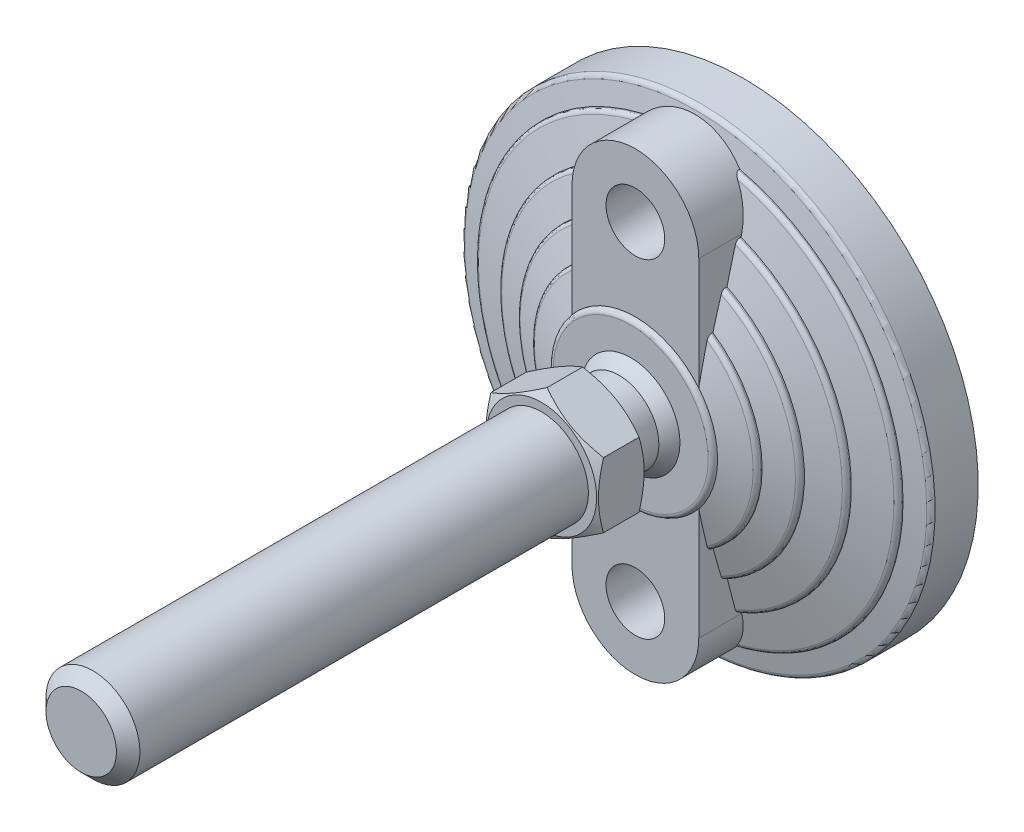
ISO-10303-21;
HEADER;
FILE_DESCRIPTION(('STEP AP214'),'2;1');
FILE_NAME('part.step','',(''),(''),'','','');
FILE_SCHEMA(('AUTOMOTIVE_DESIGN { 1 0 10303 214 1 1 1 1 }'));
ENDSEC;
DATA;
#1=APPLICATION_CONTEXT('core data for automotive mechanical design processes');
#2=APPLICATION_PROTOCOL_DEFINITION('international standard','automotive_design',2000,#1);
#3=PRODUCT_CONTEXT('',#1,'mechanical');
#4=PRODUCT('Part','Part','',(#3));
#5=PRODUCT_RELATED_PRODUCT_CATEGORY('part','',(#4));
#6=PRODUCT_DEFINITION_FORMATION('','',#4);
#7=PRODUCT_DEFINITION_CONTEXT('part definition',#1,'design');
#8=PRODUCT_DEFINITION('design','',#6,#7);
#9=PRODUCT_DEFINITION_SHAPE('','',#8);
#10=(LENGTH_UNIT() NAMED_UNIT(*) SI_UNIT(.MILLI.,.METRE.));
#11=(NAMED_UNIT(*) PLANE_ANGLE_UNIT() SI_UNIT($,.RADIAN.));
#12=(NAMED_UNIT(*) SI_UNIT($,.STERADIAN.) SOLID_ANGLE_UNIT());
#13=UNCERTAINTY_MEASURE_WITH_UNIT(LENGTH_MEASURE(1.E-05),#10,'distance_accuracy_value','');
#14=(GEOMETRIC_REPRESENTATION_CONTEXT(3) GLOBAL_UNCERTAINTY_ASSIGNED_CONTEXT((#13)) GLOBAL_UNIT_ASSIGNED_CONTEXT((#10,
#11,#12)) REPRESENTATION_CONTEXT('',''));
#15=CARTESIAN_POINT('',(0.,0.,0.));
#16=DIRECTION('',(0.,0.,1.));
#17=DIRECTION('',(1.,0.,0.));
#18=AXIS2_PLACEMENT_3D('',#15,#16,#17);
#19=CARTESIAN_POINT('',(-12.,14.022683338,36.));
#20=DIRECTION('',(0.,0.,1.));
#21=DIRECTION('',(0.,-1.,0.));
#22=AXIS2_PLACEMENT_3D('',#19,#20,#21);
#23=PLANE('',#22);
#24=CARTESIAN_POINT('',(0.,0.,36.));
#25=DIRECTION('',(0.,0.,-1.));
#26=DIRECTION('',(0.,1.,0.));
#27=AXIS2_PLACEMENT_3D('',#24,#25,#26);
#28=CIRCLE('',#27,11.75);
#29=CARTESIAN_POINT('',(0.,11.75,36.));
#30=VERTEX_POINT('',#29);
#31=EDGE_CURVE('E260',#30,#30,#28,.T.);
#32=ORIENTED_EDGE('',*,*,#31,.T.);
#33=EDGE_LOOP('',(#32));
#34=FACE_BOUND('',#33,.T.);
#35=CARTESIAN_POINT('',(0.,0.,36.));
#36=DIRECTION('',(0.,0.,-1.));
#37=DIRECTION('',(0.,1.,0.));
#38=AXIS2_PLACEMENT_3D('',#35,#36,#37);
#39=CIRCLE('',#38,8.5);
#40=CARTESIAN_POINT('',(0.,8.5,36.));
#41=VERTEX_POINT('',#40);
#42=EDGE_CURVE('E274',#41,#41,#39,.T.);
#43=ORIENTED_EDGE('',*,*,#42,.F.);
#44=EDGE_LOOP('',(#43));
#45=FACE_BOUND('',#44,.T.);
#46=ADVANCED_FACE('F14',(#34,#45),#23,.F.);
#47=CARTESIAN_POINT('',(0.,0.,36.));
#48=DIRECTION('',(0.,0.,-1.));
#49=DIRECTION('',(0.,1.,0.));
#50=AXIS2_PLACEMENT_3D('',#47,#48,#49);
#51=CYLINDRICAL_SURFACE('',#50,8.5);
#52=CARTESIAN_POINT('',(0.,0.,29.5));
#53=DIRECTION('',(0.,0.,-1.));
#54=DIRECTION('',(0.,1.,0.));
#55=AXIS2_PLACEMENT_3D('',#52,#53,#54);
#56=CIRCLE('',#55,8.5);
#57=CARTESIAN_POINT('',(0.,8.5,29.5));
#58=VERTEX_POINT('',#57);
#59=EDGE_CURVE('E1561',#58,#58,#56,.F.);
#60=ORIENTED_EDGE('',*,*,#59,.T.);
#61=EDGE_LOOP('',(#60));
#62=FACE_BOUND('',#61,.T.);
#63=ORIENTED_EDGE('',*,*,#42,.T.);
#64=EDGE_LOOP('',(#63));
#65=FACE_BOUND('',#64,.T.);
#66=ADVANCED_FACE('F928',(#62,#65),#51,.T.);
#67=CARTESIAN_POINT('',(-44.173478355,44.022,0.));
#68=DIRECTION('',(0.,0.,1.));
#69=DIRECTION('',(0.,-1.,0.));
#70=AXIS2_PLACEMENT_3D('',#67,#68,#69);
#71=PLANE('',#70);
#72=CARTESIAN_POINT('',(0.,0.,0.));
#73=DIRECTION('',(0.,0.,-1.));
#74=DIRECTION('',(0.,1.,0.));
#75=AXIS2_PLACEMENT_3D('',#72,#73,#74);
#76=CIRCLE('',#75,43.5);
#77=CARTESIAN_POINT('',(0.,43.5,0.));
#78=VERTEX_POINT('',#77);
#79=EDGE_CURVE('E1559',#78,#78,#76,.F.);
#80=ORIENTED_EDGE('',*,*,#79,.F.);
#81=EDGE_LOOP('',(#80));
#82=FACE_BOUND('',#81,.T.);
#83=ADVANCED_FACE('F938',(#82),#71,.F.);
#84=CARTESIAN_POINT('',(-8.631599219,8.622532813,29.5));
#85=DIRECTION('',(0.,0.,1.));
#86=DIRECTION('',(0.,-1.,0.));
#87=AXIS2_PLACEMENT_3D('',#84,#85,#86);
#88=PLANE('',#87);
#89=CARTESIAN_POINT('',(0.,0.,29.5));
#90=DIRECTION('',(0.,0.,-1.));
#91=DIRECTION('',(0.,1.,0.));
#92=AXIS2_PLACEMENT_3D('',#89,#90,#91);
#93=CIRCLE('',#92,8.49107182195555);
#94=CARTESIAN_POINT('',(0.,8.49107182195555,29.5));
#95=VERTEX_POINT('',#94);
#96=EDGE_CURVE('E1556',#95,#95,#93,.T.);
#97=ORIENTED_EDGE('',*,*,#96,.F.);
#98=EDGE_LOOP('',(#97));
#99=FACE_BOUND('',#98,.T.);
#100=ORIENTED_EDGE('',*,*,#59,.F.);
#101=EDGE_LOOP('',(#100));
#102=FACE_BOUND('',#101,.T.);
#103=ADVANCED_FACE('F948',(#99,#102),#88,.F.);
#104=CARTESIAN_POINT('',(0.,0.,3.));
#105=DIRECTION('',(0.,0.,-1.));
#106=DIRECTION('',(0.,1.,0.));
#107=AXIS2_PLACEMENT_3D('',#104,#105,#106);
#108=CYLINDRICAL_SURFACE('',#107,43.5);
#109=ORIENTED_EDGE('',*,*,#79,.T.);
#110=EDGE_LOOP('',(#109));
#111=FACE_BOUND('',#110,.T.);
#112=CARTESIAN_POINT('',(0.,0.,3.));
#113=DIRECTION('',(0.,0.,-1.));
#114=DIRECTION('',(0.,1.,0.));
#115=AXIS2_PLACEMENT_3D('',#112,#113,#114);
#116=CIRCLE('',#115,43.5);
#117=CARTESIAN_POINT('',(0.,43.5,3.));
#118=VERTEX_POINT('',#117);
#119=EDGE_CURVE('E1553',#118,#118,#116,.T.);
#120=ORIENTED_EDGE('',*,*,#119,.T.);
#121=EDGE_LOOP('',(#120));
#122=FACE_BOUND('',#121,.T.);
#123=ADVANCED_FACE('F958',(#111,#122),#108,.T.);
#124=CARTESIAN_POINT('',(-6.346764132,-28.675,3.));
#125=DIRECTION('',(0.,0.,1.));
#126=DIRECTION('',(0.,-1.,0.));
#127=AXIS2_PLACEMENT_3D('',#124,#125,#126);
#128=PLANE('',#127);
#129=CARTESIAN_POINT('',(0.,-35.,3.));
#130=DIRECTION('',(0.,0.,1.));
#131=DIRECTION('',(0.,-1.,0.));
#132=AXIS2_PLACEMENT_3D('',#129,#130,#131);
#133=CIRCLE('',#132,6.25);
#134=CARTESIAN_POINT('',(0.,-41.25,3.));
#135=VERTEX_POINT('',#134);
#136=EDGE_CURVE('E1550',#135,#135,#133,.T.);
#137=ORIENTED_EDGE('',*,*,#136,.T.);
#138=EDGE_LOOP('',(#137));
#139=FACE_BOUND('',#138,.T.);
#140=ADVANCED_FACE('F966',(#139),#128,.T.);
#141=CARTESIAN_POINT('',(0.,0.,20.670266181));
#142=DIRECTION('',(0.,0.,-1.));
#143=DIRECTION('',(1.,0.,0.));
#144=AXIS2_PLACEMENT_3D('',#141,#142,#143);
#145=SPHERICAL_SURFACE('',#144,12.25);
#146=CARTESIAN_POINT('',(0.,0.,27.));
#147=DIRECTION('',(0.,0.,-1.));
#148=DIRECTION('',(0.,1.,0.));
#149=AXIS2_PLACEMENT_3D('',#146,#147,#148);
#150=CIRCLE('',#149,10.4879440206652);
#151=CARTESIAN_POINT('',(0.,10.4879440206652,27.));
#152=VERTEX_POINT('',#151);
#153=EDGE_CURVE('E1547',#152,#152,#150,.F.);
#154=ORIENTED_EDGE('',*,*,#153,.T.);
#155=EDGE_LOOP('',(#154));
#156=FACE_BOUND('',#155,.T.);
#157=ORIENTED_EDGE('',*,*,#96,.T.);
#158=EDGE_LOOP('',(#157));
#159=FACE_BOUND('',#158,.T.);
#160=ADVANCED_FACE('F971',(#156,#159),#145,.T.);
#161=CARTESIAN_POINT('',(-50.774113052,50.6,3.));
#162=DIRECTION('',(0.,0.,1.));
#163=DIRECTION('',(0.,-1.,0.));
#164=AXIS2_PLACEMENT_3D('',#161,#162,#163);
#165=PLANE('',#164);
#166=ORIENTED_EDGE('',*,*,#119,.F.);
#167=EDGE_LOOP('',(#166));
#168=FACE_BOUND('',#167,.T.);
#169=CARTESIAN_POINT('',(0.,0.,3.));
#170=DIRECTION('',(0.,0.,-1.));
#171=DIRECTION('',(0.,1.,0.));
#172=AXIS2_PLACEMENT_3D('',#169,#170,#171);
#173=CIRCLE('',#172,50.);
#174=CARTESIAN_POINT('',(0.,50.,3.));
#175=VERTEX_POINT('',#174);
#176=EDGE_CURVE('E538',#175,#175,#173,.F.);
#177=ORIENTED_EDGE('',*,*,#176,.F.);
#178=EDGE_LOOP('',(#177));
#179=FACE_BOUND('',#178,.T.);
#180=ADVANCED_FACE('F979',(#168,#179),#165,.F.);
#181=CARTESIAN_POINT('',(0.,-35.,3.));
#182=DIRECTION('',(0.,0.,1.));
#183=DIRECTION('',(0.,-1.,0.));
#184=AXIS2_PLACEMENT_3D('',#181,#182,#183);
#185=CYLINDRICAL_SURFACE('',#184,6.25);
#186=ORIENTED_EDGE('',*,*,#136,.F.);
#187=EDGE_LOOP('',(#186));
#188=FACE_BOUND('',#187,.T.);
#189=CARTESIAN_POINT('',(0.,-35.,26.));
#190=DIRECTION('',(0.,0.,1.));
#191=DIRECTION('',(0.,-1.,0.));
#192=AXIS2_PLACEMENT_3D('',#189,#190,#191);
#193=CIRCLE('',#192,6.25);
#194=CARTESIAN_POINT('',(0.,-41.25,26.));
#195=VERTEX_POINT('',#194);
#196=EDGE_CURVE('E521',#195,#195,#193,.T.);
#197=ORIENTED_EDGE('',*,*,#196,.T.);
#198=EDGE_LOOP('',(#197));
#199=FACE_BOUND('',#198,.T.);
#200=ADVANCED_FACE('F984',(#188,#199),#185,.F.);
#201=CARTESIAN_POINT('',(-16.755457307,-16.698,27.));
#202=DIRECTION('',(0.,0.,-1.));
#203=DIRECTION('',(0.,1.,0.));
#204=AXIS2_PLACEMENT_3D('',#201,#202,#203);
#205=PLANE('',#204);
#206=ORIENTED_EDGE('',*,*,#153,.F.);
#207=EDGE_LOOP('',(#206));
#208=FACE_BOUND('',#207,.T.);
#209=CARTESIAN_POINT('',(0.,0.,27.));
#210=DIRECTION('',(0.,0.,-1.));
#211=DIRECTION('',(0.,1.,0.));
#212=AXIS2_PLACEMENT_3D('',#209,#210,#211);
#213=CIRCLE('',#212,16.5);
#214=CARTESIAN_POINT('',(0.,16.5,27.));
#215=VERTEX_POINT('',#214);
#216=EDGE_CURVE('E520',#215,#215,#213,.T.);
#217=ORIENTED_EDGE('',*,*,#216,.F.);
#218=EDGE_LOOP('',(#217));
#219=FACE_BOUND('',#218,.T.);
#220=ADVANCED_FACE('F992',(#208,#219),#205,.F.);
#221=CARTESIAN_POINT('',(-6.346764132,41.325,3.));
#222=DIRECTION('',(0.,0.,1.));
#223=DIRECTION('',(0.,-1.,0.));
#224=AXIS2_PLACEMENT_3D('',#221,#222,#223);
#225=PLANE('',#224);
#226=CARTESIAN_POINT('',(0.,35.,3.));
#227=DIRECTION('',(0.,0.,1.));
#228=DIRECTION('',(0.,-1.,0.));
#229=AXIS2_PLACEMENT_3D('',#226,#227,#228);
#230=CIRCLE('',#229,6.25);
#231=CARTESIAN_POINT('',(0.,28.75,3.));
#232=VERTEX_POINT('',#231);
#233=EDGE_CURVE('E1294',#232,#232,#230,.T.);
#234=ORIENTED_EDGE('',*,*,#233,.T.);
#235=EDGE_LOOP('',(#234));
#236=FACE_BOUND('',#235,.T.);
#237=ADVANCED_FACE('F997',(#236),#225,.T.);
#238=CARTESIAN_POINT('',(0.,0.,26.));
#239=DIRECTION('',(0.,0.,-1.));
#240=DIRECTION('',(1.,0.,0.));
#241=AXIS2_PLACEMENT_3D('',#238,#239,#240);
#242=CONICAL_SURFACE('',#241,17.5,1.27229739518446);
#243=CARTESIAN_POINT('',(0.,0.,26.));
#244=DIRECTION('',(0.,0.,1.));
#245=DIRECTION('',(0.,-1.,0.));
#246=AXIS2_PLACEMENT_3D('',#243,#244,#245);
#247=CIRCLE('',#246,17.5);
#248=CARTESIAN_POINT('',(13.5000000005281,-11.1355287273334,25.999999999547));
#249=VERTEX_POINT('',#248);
#250=CARTESIAN_POINT('',(13.5000000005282,11.1355287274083,25.9999999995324));
#251=VERTEX_POINT('',#250);
#252=EDGE_CURVE('E517',#249,#251,#247,.T.);
#253=ORIENTED_EDGE('',*,*,#252,.F.);
#254=CARTESIAN_POINT('',(13.5,-18.9832672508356,24.2172043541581));
#255=CARTESIAN_POINT('',(13.5,-18.6579649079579,24.2987714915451));
#256=CARTESIAN_POINT('',(13.5,-18.3324976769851,24.3796813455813));
#257=CARTESIAN_POINT('',(13.5,-17.6811977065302,24.5400241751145));
#258=CARTESIAN_POINT('',(13.5,-17.3553649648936,24.6194571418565));
#259=CARTESIAN_POINT('',(13.5,-16.3773825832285,24.8552688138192));
#260=CARTESIAN_POINT('',(13.5,-15.7246371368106,25.0091884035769));
#261=CARTESIAN_POINT('',(13.5,-14.4172126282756,25.3088363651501));
#262=CARTESIAN_POINT('',(13.5,-13.7625334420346,25.4545641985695));
#263=CARTESIAN_POINT('',(13.5,-12.7787974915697,25.6654071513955));
#264=CARTESIAN_POINT('',(13.5,-12.4505717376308,25.7344021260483));
#265=CARTESIAN_POINT('',(13.5,-11.7935144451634,25.8694734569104));
#266=CARTESIAN_POINT('',(13.5,-11.4646828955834,25.9355497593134));
#267=CARTESIAN_POINT('',(13.5,-11.1355287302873,25.9999999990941));
#268=B_SPLINE_CURVE_WITH_KNOTS('',3,(#254,#255,#256,#257,#258,#259,#260,#261,#262,#263,#264,
#265,#266,#267),.UNSPECIFIED.,.F.,.F.,(4,2,2,2,2,2,4),(0.,1.00611699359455,2.01223994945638,
4.02414047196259,6.03617307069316,7.04235800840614,8.04856148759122),.UNSPECIFIED.);
#269=CARTESIAN_POINT('',(13.5,-18.9832672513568,24.2172043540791));
#270=VERTEX_POINT('',#269);
#271=EDGE_CURVE('E1206',#270,#249,#268,.T.);
#272=ORIENTED_EDGE('',*,*,#271,.F.);
#273=CARTESIAN_POINT('',(3.16437848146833E-10,0.,24.217204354));
#274=DIRECTION('',(0.,0.,-1.));
#275=DIRECTION('',(1.,0.,0.));
#276=AXIS2_PLACEMENT_3D('',#273,#274,#275);
#277=CIRCLE('',#276,23.2940858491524);
#278=CARTESIAN_POINT('',(13.5,18.983267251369,24.2172043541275));
#279=VERTEX_POINT('',#278);
#280=EDGE_CURVE('E549',#279,#270,#277,.T.);
#281=ORIENTED_EDGE('',*,*,#280,.F.);
#282=CARTESIAN_POINT('',(13.5,11.1355287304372,25.9999999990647));
#283=CARTESIAN_POINT('',(13.5,11.4646828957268,25.9355497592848));
#284=CARTESIAN_POINT('',(13.5,11.7935144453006,25.8694734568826));
#285=CARTESIAN_POINT('',(13.5,12.4505717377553,25.7344021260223));
#286=CARTESIAN_POINT('',(13.5,12.7787974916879,25.6654071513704));
#287=CARTESIAN_POINT('',(13.5,13.762533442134,25.4545641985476));
#288=CARTESIAN_POINT('',(13.5,14.4172126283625,25.3088363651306));
#289=CARTESIAN_POINT('',(13.5,15.7246371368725,25.0091884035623));
#290=CARTESIAN_POINT('',(13.5,16.377382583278,24.8552688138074));
#291=CARTESIAN_POINT('',(13.5,17.3553649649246,24.619457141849));
#292=CARTESIAN_POINT('',(13.5,17.681197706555,24.5400241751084));
#293=CARTESIAN_POINT('',(13.5,18.3324976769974,24.3796813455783));
#294=CARTESIAN_POINT('',(13.5,18.6579649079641,24.2987714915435));
#295=CARTESIAN_POINT('',(13.5,18.9832672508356,24.2172043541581));
#296=B_SPLINE_CURVE_WITH_KNOTS('',3,(#282,#283,#284,#285,#286,#287,#288,#289,#290,#291,#292,
#293,#294,#295),.UNSPECIFIED.,.F.,.F.,(4,2,2,2,2,2,4),(0.,1.00620347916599,2.01238841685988,
4.02442101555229,6.03632153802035,7.04244449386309,8.04856148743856),.UNSPECIFIED.);
#297=EDGE_CURVE('E1287',#251,#279,#296,.T.);
#298=ORIENTED_EDGE('',*,*,#297,.F.);
#299=EDGE_LOOP('',(#253,#272,#281,#298));
#300=FACE_BOUND('',#299,.T.);
#301=ADVANCED_FACE('F1007',(#300),#242,.T.);
#302=CARTESIAN_POINT('',(13.267303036,19.999466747,23.261425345));
#303=CARTESIAN_POINT('',(29.097194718,9.49818825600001,23.261425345));
#304=CARTESIAN_POINT('',(29.097194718,-9.49818825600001,23.261425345));
#305=CARTESIAN_POINT('',(13.267303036,-19.999466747,23.261425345));
#306=CARTESIAN_POINT('',(13.267303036,19.999466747,23.716888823));
#307=CARTESIAN_POINT('',(29.097194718,9.49818825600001,23.716888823));
#308=CARTESIAN_POINT('',(29.097194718,-9.49818825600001,23.716888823));
#309=CARTESIAN_POINT('',(13.267303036,-19.999466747,23.716888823));
#310=CARTESIAN_POINT('',(13.117718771,19.773979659,24.083258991));
#311=CARTESIAN_POINT('',(28.769133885,9.39109946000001,24.083258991));
#312=CARTESIAN_POINT('',(28.769133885,-9.39109946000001,24.083258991));
#313=CARTESIAN_POINT('',(13.117718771,-19.773979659,24.083258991));
#314=CARTESIAN_POINT('',(12.877070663,19.411220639,24.217204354));
#315=CARTESIAN_POINT('',(28.241356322,9.218817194,24.217204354));
#316=CARTESIAN_POINT('',(28.241356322,-9.218817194,24.217204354));
#317=CARTESIAN_POINT('',(12.877070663,-19.411220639,24.217204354));
#318=(BOUNDED_SURFACE() B_SPLINE_SURFACE(3,3,((#302,#303,#304,#305),(#306,#307,#308,#309),(#310,
#311,#312,#313),(#314,#315,#316,#317)),.UNSPECIFIED.,.F.,.F.,
.F.) B_SPLINE_SURFACE_WITH_KNOTS((4,4),(4,4),(0.,1.),(0.,1.),
.UNSPECIFIED.) GEOMETRIC_REPRESENTATION_ITEM() RATIONAL_B_SPLINE_SURFACE(((1.,0.701869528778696,
0.701869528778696,1.),(0.869593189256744,0.610340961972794,0.610340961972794,0.869593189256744),
(0.869593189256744,0.610340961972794,0.610340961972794,0.869593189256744),(1.,0.701869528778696,
0.701869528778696,1.))) REPRESENTATION_ITEM('') SURFACE());
#319=CARTESIAN_POINT('',(13.5,-19.8431348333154,23.2614253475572));
#320=CARTESIAN_POINT('',(13.5,-19.8431370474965,23.2860556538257));
#321=CARTESIAN_POINT('',(13.5,-19.8420333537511,23.3106726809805));
#322=CARTESIAN_POINT('',(13.5,-19.8376465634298,23.3597018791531));
#323=CARTESIAN_POINT('',(13.5,-19.8343643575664,23.3841141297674));
#324=CARTESIAN_POINT('',(13.5,-19.8213486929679,23.4565201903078));
#325=CARTESIAN_POINT('',(13.5,-19.8084453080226,23.5039784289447));
#326=CARTESIAN_POINT('',(13.5,-19.7748969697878,23.5959548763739));
#327=CARTESIAN_POINT('',(13.5,-19.7542611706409,23.6404764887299));
#328=CARTESIAN_POINT('',(13.5,-19.7062220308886,23.7257350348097));
#329=CARTESIAN_POINT('',(13.5,-19.6788120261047,23.7664681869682));
#330=CARTESIAN_POINT('',(13.5,-19.6164784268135,23.8458096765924));
#331=CARTESIAN_POINT('',(13.5,-19.5811980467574,23.8841360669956));
#332=CARTESIAN_POINT('',(13.5,-19.5055204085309,23.9553392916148));
#333=CARTESIAN_POINT('',(13.5,-19.4651202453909,23.9882130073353));
#334=CARTESIAN_POINT('',(13.5,-19.3733614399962,24.0532792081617));
#335=CARTESIAN_POINT('',(13.5,-19.321293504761,24.0844693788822));
#336=CARTESIAN_POINT('',(13.5,-19.2133323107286,24.139175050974));
#337=CARTESIAN_POINT('',(13.5,-19.1574401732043,24.1626927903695));
#338=CARTESIAN_POINT('',(13.5,-19.0617819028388,24.1957297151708));
#339=CARTESIAN_POINT('',(13.5,-19.022719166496,24.207311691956));
#340=CARTESIAN_POINT('',(13.5,-18.9832672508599,24.2172043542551));
#341=B_SPLINE_CURVE_WITH_KNOTS('',3,(#319,#320,#321,#322,#323,#324,#325,#326,#327,#328,#329,
#330,#331,#332,#333,#334,#335,#336,#337,#338,#339,#340),.UNSPECIFIED.,.F.,.F.,(4,2,2,2,2,2,2,2,
2,2,4),(0.,0.073840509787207,0.147650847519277,0.294398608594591,0.440973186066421,
0.587692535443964,0.743377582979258,0.899151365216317,1.08055916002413,1.26191399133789,
1.38396481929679),.UNSPECIFIED.);
#342=CARTESIAN_POINT('',(13.5,-19.8431348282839,23.2614253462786));
#343=VERTEX_POINT('',#342);
#344=EDGE_CURVE('E1223',#343,#270,#341,.T.);
#345=CARTESIAN_POINT('',(0.,0.,23.261425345));
#346=DIRECTION('',(0.,0.,-1.));
#347=DIRECTION('',(0.,1.,0.));
#348=AXIS2_PLACEMENT_3D('',#345,#346,#347);
#349=CIRCLE('',#348,24.);
#350=CARTESIAN_POINT('',(13.5,19.8431348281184,23.2614253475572));
#351=VERTEX_POINT('',#350);
#352=EDGE_CURVE('E547',#351,#343,#349,.T.);
#353=CARTESIAN_POINT('',(13.5,18.9832672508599,24.2172043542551));
#354=CARTESIAN_POINT('',(13.5,19.0245269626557,24.2068474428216));
#355=CARTESIAN_POINT('',(13.5,19.0653049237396,24.1946763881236));
#356=CARTESIAN_POINT('',(13.5,19.1456358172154,24.1665827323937));
#357=CARTESIAN_POINT('',(13.5,19.1851861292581,24.1506526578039));
#358=CARTESIAN_POINT('',(13.5,19.3016874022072,24.0969581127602));
#359=CARTESIAN_POINT('',(13.5,19.3761277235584,24.0533765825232));
#360=CARTESIAN_POINT('',(13.5,19.4913457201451,23.9675664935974));
#361=CARTESIAN_POINT('',(13.5,19.5352290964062,23.9294496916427));
#362=CARTESIAN_POINT('',(13.5,19.6161219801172,23.8466003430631));
#363=CARTESIAN_POINT('',(13.5,19.6531483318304,23.801884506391));
#364=CARTESIAN_POINT('',(13.5,19.7189344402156,23.7060840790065));
#365=CARTESIAN_POINT('',(13.5,19.747615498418,23.6549449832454));
#366=CARTESIAN_POINT('',(13.5,19.7944064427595,23.5480322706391));
#367=CARTESIAN_POINT('',(13.5,19.8125331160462,23.4922661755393));
#368=CARTESIAN_POINT('',(13.5,19.8308153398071,23.4067306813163));
#369=CARTESIAN_POINT('',(13.5,19.8354249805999,23.3778585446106));
#370=CARTESIAN_POINT('',(13.5,19.8415861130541,23.3198066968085));
#371=CARTESIAN_POINT('',(13.5,19.8431393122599,23.2906271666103));
#372=CARTESIAN_POINT('',(13.5,19.8431348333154,23.2614253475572));
#373=B_SPLINE_CURVE_WITH_KNOTS('',3,(#353,#354,#355,#356,#357,#358,#359,#360,#361,#362,#363,
#364,#365,#366,#367,#368,#369,#370,#371,#372),.UNSPECIFIED.,.F.,.F.,(4,2,2,2,2,2,2,2,2,4),(0.,
0.127516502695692,0.25528869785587,0.511930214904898,0.685657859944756,0.858952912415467,
1.03383282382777,1.20843381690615,1.29600438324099,1.38352601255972),.UNSPECIFIED.);
#374=EDGE_CURVE('E1277',#279,#351,#373,.T.);
#375=ORIENTED_EDGE('',*,*,#280,.T.);
#376=ORIENTED_EDGE('',*,*,#344,.F.);
#377=ORIENTED_EDGE('',*,*,#352,.F.);
#378=ORIENTED_EDGE('',*,*,#374,.F.);
#379=EDGE_LOOP('',(#375,#376,#377,#378));
#380=FACE_BOUND('',#379,.T.);
#381=ADVANCED_FACE('F1122',(#380),#318,.T.);
#382=CARTESIAN_POINT('',(0.,0.,23.261425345));
#383=DIRECTION('',(0.,0.,-1.));
#384=DIRECTION('',(0.,1.,0.));
#385=AXIS2_PLACEMENT_3D('',#382,#383,#384);
#386=CYLINDRICAL_SURFACE('',#385,24.);
#387=CARTESIAN_POINT('',(0.,0.,23.));
#388=DIRECTION('',(0.,0.,-1.));
#389=DIRECTION('',(0.,1.,0.));
#390=AXIS2_PLACEMENT_3D('',#387,#388,#389);
#391=CIRCLE('',#390,24.);
#392=CARTESIAN_POINT('',(13.5,19.8431348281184,23.));
#393=VERTEX_POINT('',#392);
#394=CARTESIAN_POINT('',(13.5,-19.8431348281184,23.000000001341));
#395=VERTEX_POINT('',#394);
#396=EDGE_CURVE('E545',#393,#395,#391,.T.);
#397=ORIENTED_EDGE('',*,*,#396,.F.);
#398=DIRECTION('',(0.,0.,-1.));
#399=VECTOR('',#398,1.);
#400=CARTESIAN_POINT('',(13.5,19.8431348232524,21.4084486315));
#401=LINE('',#400,#399);
#402=EDGE_CURVE('E1329',#351,#393,#401,.T.);
#403=ORIENTED_EDGE('',*,*,#402,.F.);
#404=ORIENTED_EDGE('',*,*,#352,.T.);
#405=DIRECTION('',(0.,0.,1.));
#406=VECTOR('',#405,1.);
#407=CARTESIAN_POINT('',(13.5,-19.8431348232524,21.4084486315));
#408=LINE('',#407,#406);
#409=EDGE_CURVE('E1321',#395,#343,#408,.T.);
#410=ORIENTED_EDGE('',*,*,#409,.F.);
#411=EDGE_LOOP('',(#397,#403,#404,#410));
#412=FACE_BOUND('',#411,.T.);
#413=ADVANCED_FACE('F1057',(#412),#386,.T.);
#414=CARTESIAN_POINT('',(0.,0.,23.));
#415=DIRECTION('',(0.,0.,-1.));
#416=DIRECTION('',(0.,1.,0.));
#417=AXIS2_PLACEMENT_3D('',#414,#415,#416);
#418=CONICAL_SURFACE('',#417,24.,1.24904577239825);
#419=ORIENTED_EDGE('',*,*,#396,.T.);
#420=CARTESIAN_POINT('',(13.5,-26.022897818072,21.2279240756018));
#421=CARTESIAN_POINT('',(13.5,-25.5091656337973,21.3799212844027));
#422=CARTESIAN_POINT('',(13.5,-24.9951778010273,21.5310587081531));
#423=CARTESIAN_POINT('',(13.5,-23.9666187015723,21.8312926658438));
#424=CARTESIAN_POINT('',(13.5,-23.4520474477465,21.9803892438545));
#425=CARTESIAN_POINT('',(13.5,-22.4222240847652,22.2762276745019));
#426=CARTESIAN_POINT('',(13.5,-21.9069719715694,22.422969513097));
#427=CARTESIAN_POINT('',(13.5,-20.8756730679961,22.713675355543));
#428=CARTESIAN_POINT('',(13.5,-20.3596262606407,22.8576392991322));
#429=CARTESIAN_POINT('',(13.5,-19.8431348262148,23.0000000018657));
#430=B_SPLINE_CURVE_WITH_KNOTS('',3,(#420,#421,#422,#423,#424,#425,#426,#427,#428,#429),
.UNSPECIFIED.,.F.,.F.,(4,2,2,2,4),(0.,1.60723934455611,3.21444392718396,4.82165809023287,
6.42890708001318),.UNSPECIFIED.);
#431=CARTESIAN_POINT('',(13.5,-26.0228978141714,21.2279240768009));
#432=VERTEX_POINT('',#431);
#433=EDGE_CURVE('E1231',#432,#395,#430,.T.);
#434=ORIENTED_EDGE('',*,*,#433,.F.);
#435=CARTESIAN_POINT('',(-5.51341958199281E-10,0.,21.227924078));
#436=DIRECTION('',(0.,0.,-1.));
#437=DIRECTION('',(0.,1.,0.));
#438=AXIS2_PLACEMENT_3D('',#435,#436,#437);
#439=CIRCLE('',#438,29.3162277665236);
#440=CARTESIAN_POINT('',(13.5,26.0228978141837,21.2279240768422));
#441=VERTEX_POINT('',#440);
#442=EDGE_CURVE('E544',#441,#432,#439,.T.);
#443=ORIENTED_EDGE('',*,*,#442,.F.);
#444=CARTESIAN_POINT('',(13.5000000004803,19.8431348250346,23.0000000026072));
#445=CARTESIAN_POINT('',(13.5000000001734,20.3596262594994,22.8576392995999));
#446=CARTESIAN_POINT('',(13.5000000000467,20.8756730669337,22.7136753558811));
#447=CARTESIAN_POINT('',(13.4999999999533,21.9069719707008,22.4229695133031));
#448=CARTESIAN_POINT('',(13.4999999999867,22.4222240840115,22.2762276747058));
#449=CARTESIAN_POINT('',(13.5000000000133,23.4520474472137,21.9803892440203));
#450=CARTESIAN_POINT('',(13.5000000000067,23.9666187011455,21.8312926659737));
#451=CARTESIAN_POINT('',(13.4999999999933,24.995177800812,21.5310587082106));
#452=CARTESIAN_POINT('',(13.4999999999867,25.5091656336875,21.3799212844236));
#453=CARTESIAN_POINT('',(13.5,26.022897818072,21.2279240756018));
#454=B_SPLINE_CURVE_WITH_KNOTS('',3,(#444,#445,#446,#447,#448,#449,#450,#451,#452,#453),
.UNSPECIFIED.,.F.,.F.,(4,2,2,2,4),(0.,1.60724899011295,3.2144631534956,4.82166773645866,
6.42890708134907),.UNSPECIFIED.);
#455=EDGE_CURVE('E1263',#393,#441,#454,.T.);
#456=ORIENTED_EDGE('',*,*,#455,.F.);
#457=EDGE_LOOP('',(#419,#434,#443,#456));
#458=FACE_BOUND('',#457,.T.);
#459=ADVANCED_FACE('F1051',(#458),#418,.T.);
#460=CARTESIAN_POINT('',(13.143890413,26.967353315,20.27924078));
#461=CARTESIAN_POINT('',(38.983891,14.372934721,20.27924078));
#462=CARTESIAN_POINT('',(38.983891,-14.372934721,20.27924078));
#463=CARTESIAN_POINT('',(13.143890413,-26.967353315,20.27924078));
#464=CARTESIAN_POINT('',(13.143890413,26.967353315,20.725161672));
#465=CARTESIAN_POINT('',(38.983891,14.372934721,20.725161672));
#466=CARTESIAN_POINT('',(38.983891,-14.372934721,20.725161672));
#467=CARTESIAN_POINT('',(13.143890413,-26.967353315,20.725161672));
#468=CARTESIAN_POINT('',(13.029654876,26.732975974,21.086911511));
#469=CARTESIAN_POINT('',(38.645076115,14.248017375,21.086911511));
#470=CARTESIAN_POINT('',(38.645076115,-14.248017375,21.086911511));
#471=CARTESIAN_POINT('',(13.029654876,-26.732975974,21.086911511));
#472=CARTESIAN_POINT('',(12.844309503,26.352702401,21.227924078));
#473=CARTESIAN_POINT('',(38.095354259,14.045340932,21.227924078));
#474=CARTESIAN_POINT('',(38.095354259,-14.045340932,21.227924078));
#475=CARTESIAN_POINT('',(12.844309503,-26.352702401,21.227924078));
#476=(BOUNDED_SURFACE() B_SPLINE_SURFACE(3,3,((#460,#461,#462,#463),(#464,#465,#466,#467),(#468,
#469,#470,#471),(#472,#473,#474,#475)),.UNSPECIFIED.,.F.,.F.,
.F.) B_SPLINE_SURFACE_WITH_KNOTS((4,4),(4,4),(0.,1.),(0.,1.),
.UNSPECIFIED.) GEOMETRIC_REPRESENTATION_ITEM() RATIONAL_B_SPLINE_SURFACE(((1.,0.625419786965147,
0.625419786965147,1.),(0.874161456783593,0.546717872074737,0.546717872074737,0.874161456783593),
(0.874161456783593,0.546717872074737,0.546717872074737,0.874161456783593),(1.,0.625419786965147,
0.625419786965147,1.))) REPRESENTATION_ITEM('') SURFACE());
#477=CARTESIAN_POINT('',(13.5,-26.7908566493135,20.2792407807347));
#478=CARTESIAN_POINT('',(13.5,-26.7908579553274,20.3051907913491));
#479=CARTESIAN_POINT('',(13.5,-26.7897247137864,20.3311275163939));
#480=CARTESIAN_POINT('',(13.5,-26.7852140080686,20.3827974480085));
#481=CARTESIAN_POINT('',(13.5,-26.781837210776,20.4085307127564));
#482=CARTESIAN_POINT('',(13.5,-26.7684139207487,20.4849772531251));
#483=CARTESIAN_POINT('',(13.5,-26.7550740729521,20.5351491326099));
#484=CARTESIAN_POINT('',(13.5,-26.7202107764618,20.632486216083));
#485=CARTESIAN_POINT('',(13.5,-26.6986916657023,20.6796529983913));
#486=CARTESIAN_POINT('',(13.5,-26.648348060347,20.7699105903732));
#487=CARTESIAN_POINT('',(13.5,-26.6195218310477,20.8130004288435));
#488=CARTESIAN_POINT('',(13.5,-26.5542840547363,20.8959059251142));
#489=CARTESIAN_POINT('',(13.5,-26.5176080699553,20.9355124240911));
#490=CARTESIAN_POINT('',(13.5,-26.4386436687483,21.0087234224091));
#491=CARTESIAN_POINT('',(13.5,-26.3963509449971,21.0423232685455));
#492=CARTESIAN_POINT('',(13.5,-26.3267001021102,21.0898793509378));
#493=CARTESIAN_POINT('',(13.5,-26.3008113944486,21.106038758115));
#494=CARTESIAN_POINT('',(13.5,-26.2478537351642,21.1362297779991));
#495=CARTESIAN_POINT('',(13.5,-26.2207861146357,21.1502637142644));
#496=CARTESIAN_POINT('',(13.5,-26.1657188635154,21.176151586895));
#497=CARTESIAN_POINT('',(13.5,-26.1377218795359,21.1880111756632));
#498=CARTESIAN_POINT('',(13.5,-26.0808891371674,21.2095853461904));
#499=CARTESIAN_POINT('',(13.5,-26.0520527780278,21.2192983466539));
#500=CARTESIAN_POINT('',(13.5,-26.0228978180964,21.2279240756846));
#501=B_SPLINE_CURVE_WITH_KNOTS('',3,(#477,#478,#479,#480,#481,#482,#483,#484,#485,#486,#487,
#488,#489,#490,#491,#492,#493,#494,#495,#496,#497,#498,#499,#500),.UNSPECIFIED.,.F.,.F.,(4,2,2,
2,2,2,2,2,2,2,2,4),(0.,0.0777993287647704,0.155575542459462,0.310500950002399,0.465344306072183,
0.620224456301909,0.78151106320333,0.942922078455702,1.03439248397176,1.12576216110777,
1.21689083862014,1.30808642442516),.UNSPECIFIED.);
#502=CARTESIAN_POINT('',(13.5,-26.7908566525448,20.27924078));
#503=VERTEX_POINT('',#502);
#504=EDGE_CURVE('E1237',#503,#432,#501,.T.);
#505=CARTESIAN_POINT('',(0.,0.,20.27924078));
#506=DIRECTION('',(0.,0.,-1.));
#507=DIRECTION('',(0.,1.,0.));
#508=AXIS2_PLACEMENT_3D('',#505,#506,#507);
#509=CIRCLE('',#508,30.);
#510=CARTESIAN_POINT('',(13.5,26.7908566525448,20.2792407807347));
#511=VERTEX_POINT('',#510);
#512=EDGE_CURVE('E542',#511,#503,#509,.T.);
#513=CARTESIAN_POINT('',(13.5,26.0228978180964,21.2279240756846));
#514=CARTESIAN_POINT('',(13.5,26.0845570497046,21.2097134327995));
#515=CARTESIAN_POINT('',(13.5,26.1448460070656,21.1865640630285));
#516=CARTESIAN_POINT('',(13.5,26.2611194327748,21.1305926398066));
#517=CARTESIAN_POINT('',(13.5,26.3170802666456,21.0977216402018));
#518=CARTESIAN_POINT('',(13.5,26.422621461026,21.022592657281));
#519=CARTESIAN_POINT('',(13.5,26.4721821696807,20.9803067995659));
#520=CARTESIAN_POINT('',(13.5,26.5625156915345,20.887307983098));
#521=CARTESIAN_POINT('',(13.5,26.6033065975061,20.8366127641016));
#522=CARTESIAN_POINT('',(13.5,26.6708532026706,20.7331354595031));
#523=CARTESIAN_POINT('',(13.5,26.6985518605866,20.6809691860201));
#524=CARTESIAN_POINT('',(13.5,26.743619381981,20.5723560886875));
#525=CARTESIAN_POINT('',(13.5,26.7610021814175,20.5159151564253));
#526=CARTESIAN_POINT('',(13.5,26.7787549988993,20.4289072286));
#527=CARTESIAN_POINT('',(13.5,26.7832876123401,20.399138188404));
#528=CARTESIAN_POINT('',(13.5,26.78933789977,20.3393328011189));
#529=CARTESIAN_POINT('',(13.5,26.7908592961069,20.3092968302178));
#530=CARTESIAN_POINT('',(13.5,26.7908566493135,20.2792407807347));
#531=B_SPLINE_CURVE_WITH_KNOTS('',3,(#513,#514,#515,#516,#517,#518,#519,#520,#521,#522,#523,
#524,#525,#526,#527,#528,#529,#530),.UNSPECIFIED.,.F.,.F.,(4,2,2,2,2,2,2,2,4),(0.,
0.192810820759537,0.386609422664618,0.58098961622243,0.7749648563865,0.951184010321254,
1.12716456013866,1.21736691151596,1.30745768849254),.UNSPECIFIED.);
#532=EDGE_CURVE('E1255',#441,#511,#531,.T.);
#533=ORIENTED_EDGE('',*,*,#442,.T.);
#534=ORIENTED_EDGE('',*,*,#504,.F.);
#535=ORIENTED_EDGE('',*,*,#512,.F.);
#536=ORIENTED_EDGE('',*,*,#532,.F.);
#537=EDGE_LOOP('',(#533,#534,#535,#536));
#538=FACE_BOUND('',#537,.T.);
#539=ADVANCED_FACE('F1056',(#538),#476,.T.);
#540=CARTESIAN_POINT('',(0.,0.,20.27924078));
#541=DIRECTION('',(0.,0.,-1.));
#542=DIRECTION('',(0.,1.,0.));
#543=AXIS2_PLACEMENT_3D('',#540,#541,#542);
#544=CYLINDRICAL_SURFACE('',#543,30.);
#545=CARTESIAN_POINT('',(0.,0.,20.));
#546=DIRECTION('',(0.,0.,-1.));
#547=DIRECTION('',(0.,1.,0.));
#548=AXIS2_PLACEMENT_3D('',#545,#546,#547);
#549=CIRCLE('',#548,30.);
#550=CARTESIAN_POINT('',(13.5,26.7908566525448,20.));
#551=VERTEX_POINT('',#550);
#552=CARTESIAN_POINT('',(13.5,-26.7908566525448,19.9999999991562));
#553=VERTEX_POINT('',#552);
#554=EDGE_CURVE('E540',#551,#553,#549,.T.);
#555=ORIENTED_EDGE('',*,*,#554,.F.);
#556=DIRECTION('',(0.,0.,-1.));
#557=VECTOR('',#556,1.);
#558=CARTESIAN_POINT('',(13.5,26.7908566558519,21.4084486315));
#559=LINE('',#558,#557);
#560=EDGE_CURVE('E1262',#511,#551,#559,.T.);
#561=ORIENTED_EDGE('',*,*,#560,.F.);
#562=ORIENTED_EDGE('',*,*,#512,.T.);
#563=DIRECTION('',(0.,0.,1.));
#564=VECTOR('',#563,1.);
#565=CARTESIAN_POINT('',(13.5,-26.7908566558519,21.4084486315));
#566=LINE('',#565,#564);
#567=EDGE_CURVE('E1243',#553,#503,#566,.T.);
#568=ORIENTED_EDGE('',*,*,#567,.F.);
#569=EDGE_LOOP('',(#555,#561,#562,#568));
#570=FACE_BOUND('',#569,.T.);
#571=ADVANCED_FACE('F1069',(#570),#544,.T.);
#572=CARTESIAN_POINT('',(0.,0.,20.));
#573=DIRECTION('',(0.,0.,-1.));
#574=DIRECTION('',(1.,0.,0.));
#575=AXIS2_PLACEMENT_3D('',#572,#573,#574);
#576=CONICAL_SURFACE('',#575,30.,1.29249666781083);
#577=ORIENTED_EDGE('',*,*,#554,.T.);
#578=CARTESIAN_POINT('',(13.5000000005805,-33.6690568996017,18.2072225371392));
#579=CARTESIAN_POINT('',(13.5000000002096,-33.0965095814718,18.3590521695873));
#580=CARTESIAN_POINT('',(13.5000000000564,-32.5238313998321,18.5103895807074));
#581=CARTESIAN_POINT('',(13.4999999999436,-31.3781752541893,18.8119124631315));
#582=CARTESIAN_POINT('',(13.4999999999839,-30.8051972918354,18.9620979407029));
#583=CARTESIAN_POINT('',(13.5000000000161,-29.6588964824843,19.2611513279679));
#584=CARTESIAN_POINT('',(13.5000000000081,-29.0855736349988,19.4100192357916));
#585=CARTESIAN_POINT('',(13.4999999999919,-27.9385277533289,19.7062178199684));
#586=CARTESIAN_POINT('',(13.4999999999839,-27.3648047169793,19.8535484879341));
#587=CARTESIAN_POINT('',(13.5,-26.7908566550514,19.9999999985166));
#588=B_SPLINE_CURVE_WITH_KNOTS('',3,(#578,#579,#580,#581,#582,#583,#584,#585,#586,#587),
.UNSPECIFIED.,.F.,.F.,(4,2,2,2,4),(0.,1.7770100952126,3.55401051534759,5.33101345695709,
7.10802608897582),.UNSPECIFIED.);
#589=CARTESIAN_POINT('',(13.5,-33.6690569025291,18.2072225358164));
#590=VERTEX_POINT('',#589);
#591=EDGE_CURVE('E1199',#590,#553,#588,.T.);
#592=ORIENTED_EDGE('',*,*,#591,.F.);
#593=CARTESIAN_POINT('',(3.08438170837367E-10,0.,18.207222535));
#594=DIRECTION('',(0.,0.,-1.));
#595=DIRECTION('',(0.,1.,0.));
#596=AXIS2_PLACEMENT_3D('',#593,#594,#595);
#597=CIRCLE('',#596,36.2747211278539);
#598=CARTESIAN_POINT('',(13.5,33.6690569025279,18.2072225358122));
#599=VERTEX_POINT('',#598);
#600=EDGE_CURVE('E539',#599,#590,#597,.T.);
#601=ORIENTED_EDGE('',*,*,#600,.F.);
#602=CARTESIAN_POINT('',(13.5000000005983,26.790856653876,19.9999999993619));
#603=CARTESIAN_POINT('',(13.5000000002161,27.3648047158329,19.85354848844));
#604=CARTESIAN_POINT('',(13.5000000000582,27.9385277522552,19.7062178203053));
#605=CARTESIAN_POINT('',(13.4999999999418,29.0855736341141,19.4100192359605));
#606=CARTESIAN_POINT('',(13.4999999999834,29.6588964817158,19.2611513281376));
#607=CARTESIAN_POINT('',(13.5000000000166,30.8051972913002,18.9620979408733));
#608=CARTESIAN_POINT('',(13.5000000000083,31.378175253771,18.8119124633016));
#609=CARTESIAN_POINT('',(13.4999999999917,32.523831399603,18.5103895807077));
#610=CARTESIAN_POINT('',(13.4999999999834,33.0965095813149,18.359052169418));
#611=CARTESIAN_POINT('',(13.5,33.6690568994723,18.2072225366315));
#612=B_SPLINE_CURVE_WITH_KNOTS('',3,(#602,#603,#604,#605,#606,#607,#608,#609,#610,#611),
.UNSPECIFIED.,.F.,.F.,(4,2,2,2,4),(0.,1.77701263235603,3.55401557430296,5.3310159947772,
7.10802609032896),.UNSPECIFIED.);
#613=EDGE_CURVE('E1264',#551,#599,#612,.T.);
#614=ORIENTED_EDGE('',*,*,#613,.F.);
#615=EDGE_LOOP('',(#577,#592,#601,#614));
#616=FACE_BOUND('',#615,.T.);
#617=ADVANCED_FACE('F1036',(#616),#576,.T.);
#618=CARTESIAN_POINT('',(13.003667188,34.639639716,17.245698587));
#619=CARTESIAN_POINT('',(51.0914438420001,20.341547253,17.245698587));
#620=CARTESIAN_POINT('',(51.0914438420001,-20.341547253,17.245698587));
#621=CARTESIAN_POINT('',(13.003667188,-34.639639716,17.245698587));
#622=CARTESIAN_POINT('',(13.003667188,34.639639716,17.709515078));
#623=CARTESIAN_POINT('',(51.091443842,20.341547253,17.709515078));
#624=CARTESIAN_POINT('',(51.091443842,-20.341547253,17.709515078));
#625=CARTESIAN_POINT('',(13.003667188,-34.639639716,17.709515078));
#626=CARTESIAN_POINT('',(12.905504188,34.378149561,18.079802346));
#627=CARTESIAN_POINT('',(50.705761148,20.187991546,18.079802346));
#628=CARTESIAN_POINT('',(50.705761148,-20.187991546,18.079802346));
#629=CARTESIAN_POINT('',(12.905504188,-34.378149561,18.079802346));
#630=CARTESIAN_POINT('',(12.748767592,33.960628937,18.207222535));
#631=CARTESIAN_POINT('',(50.089942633,19.942809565,18.207222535));
#632=CARTESIAN_POINT('',(50.089942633,-19.942809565,18.207222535));
#633=CARTESIAN_POINT('',(12.748767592,-33.960628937,18.207222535));
#634=(BOUNDED_SURFACE() B_SPLINE_SURFACE(3,3,((#618,#619,#620,#621),(#622,#623,#624,#625),(#626,
#627,#628,#629),(#630,#631,#632,#633)),.UNSPECIFIED.,.F.,.F.,
.F.) B_SPLINE_SURFACE_WITH_KNOTS((4,4),(4,4),(0.,1.),(0.,1.),
.UNSPECIFIED.) GEOMETRIC_REPRESENTATION_ITEM() RATIONAL_B_SPLINE_SURFACE(((1.,0.56763364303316,
0.56763364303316,1.),(0.865565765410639,0.491324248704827,0.491324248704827,0.865565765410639),
(0.865565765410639,0.491324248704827,0.491324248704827,0.865565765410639),(1.,0.56763364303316,
0.56763364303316,1.))) REPRESENTATION_ITEM('') SURFACE());
#635=CARTESIAN_POINT('',(13.5,-34.4492380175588,17.2456985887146));
#636=CARTESIAN_POINT('',(13.5,-34.4492388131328,17.2724185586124));
#637=CARTESIAN_POINT('',(13.5,-34.4480869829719,17.2991252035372));
#638=CARTESIAN_POINT('',(13.5,-34.4434985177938,17.3523366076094));
#639=CARTESIAN_POINT('',(13.5,-34.4400623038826,17.3788414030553));
#640=CARTESIAN_POINT('',(13.5,-34.42638545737,17.457641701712));
#641=CARTESIAN_POINT('',(13.5,-34.4127763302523,17.5093910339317));
#642=CARTESIAN_POINT('',(13.5,-34.3771048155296,17.6098360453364));
#643=CARTESIAN_POINT('',(13.5,-34.3550440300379,17.6585323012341));
#644=CARTESIAN_POINT('',(13.5,-34.3032810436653,17.7516688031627));
#645=CARTESIAN_POINT('',(13.5,-34.2735788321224,17.7961090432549));
#646=CARTESIAN_POINT('',(13.5,-34.2066078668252,17.8808807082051));
#647=CARTESIAN_POINT('',(13.5,-34.1691521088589,17.9210639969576));
#648=CARTESIAN_POINT('',(13.5,-34.0883643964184,17.9950807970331));
#649=CARTESIAN_POINT('',(13.5,-34.045025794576,18.0289070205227));
#650=CARTESIAN_POINT('',(13.5,-33.9488589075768,18.0927883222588));
#651=CARTESIAN_POINT('',(13.5,-33.8955116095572,18.1220613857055));
#652=CARTESIAN_POINT('',(13.5,-33.7848588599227,18.1715344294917));
#653=CARTESIAN_POINT('',(13.5,-33.727559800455,18.1917486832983));
#654=CARTESIAN_POINT('',(13.5,-33.6690568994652,18.2072225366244));
#655=B_SPLINE_CURVE_WITH_KNOTS('',3,(#635,#636,#637,#638,#639,#640,#641,#642,#643,#644,#645,
#646,#647,#648,#649,#650,#651,#652,#653,#654),.UNSPECIFIED.,.F.,.F.,(4,2,2,2,2,2,2,2,2,4),(0.,
0.0801088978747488,0.160203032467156,0.31989418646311,0.479555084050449,0.639216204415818,
0.803305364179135,0.967581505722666,1.14930395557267,1.33073905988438),.UNSPECIFIED.);
#656=CARTESIAN_POINT('',(13.5,-34.4492380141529,17.2456985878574));
#657=VERTEX_POINT('',#656);
#658=EDGE_CURVE('E1191',#657,#590,#655,.T.);
#659=CARTESIAN_POINT('',(0.,0.,17.245698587));
#660=DIRECTION('',(0.,0.,-1.));
#661=DIRECTION('',(0.,1.,0.));
#662=AXIS2_PLACEMENT_3D('',#659,#660,#661);
#663=CIRCLE('',#662,37.);
#664=CARTESIAN_POINT('',(13.5,34.4492380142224,17.2456985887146));
#665=VERTEX_POINT('',#664);
#666=EDGE_CURVE('E536',#665,#657,#663,.T.);
#667=CARTESIAN_POINT('',(13.5,33.6690568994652,18.2072225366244));
#668=CARTESIAN_POINT('',(13.5,33.7285004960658,18.1914984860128));
#669=CARTESIAN_POINT('',(13.5,33.7866931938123,18.1708859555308));
#670=CARTESIAN_POINT('',(13.5,33.8990439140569,18.1203027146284));
#671=CARTESIAN_POINT('',(13.5,33.9531903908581,18.0903064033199));
#672=CARTESIAN_POINT('',(13.5,34.0556677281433,18.0214004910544));
#673=CARTESIAN_POINT('',(13.5,34.1039872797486,17.9824739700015));
#674=CARTESIAN_POINT('',(13.5,34.192879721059,17.8966704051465));
#675=CARTESIAN_POINT('',(13.5,34.2334627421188,17.8498039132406));
#676=CARTESIAN_POINT('',(13.5,34.3033335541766,17.7520897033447));
#677=CARTESIAN_POINT('',(13.5,34.3331130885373,17.7015938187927));
#678=CARTESIAN_POINT('',(13.5,34.3830581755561,17.5960457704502));
#679=CARTESIAN_POINT('',(13.5,34.4032299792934,17.5409965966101));
#680=CARTESIAN_POINT('',(13.5,34.4284319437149,17.4456451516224));
#681=CARTESIAN_POINT('',(13.5,34.4362159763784,17.4060504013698));
#682=CARTESIAN_POINT('',(13.5,34.4466250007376,17.32621177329));
#683=CARTESIAN_POINT('',(13.5,34.4492528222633,17.2859682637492));
#684=CARTESIAN_POINT('',(13.5,34.4492380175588,17.2456985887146));
#685=B_SPLINE_CURVE_WITH_KNOTS('',3,(#667,#668,#669,#670,#671,#672,#673,#674,#675,#676,#677,
#678,#679,#680,#681,#682,#683,#684),.UNSPECIFIED.,.F.,.F.,(4,2,2,2,2,2,2,2,4),(0.,
0.184329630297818,0.369166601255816,0.554356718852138,0.739302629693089,0.914257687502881,
1.08909875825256,1.2098399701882,1.33051489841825),.UNSPECIFIED.);
#686=EDGE_CURVE('E1184',#599,#665,#685,.T.);
#687=ORIENTED_EDGE('',*,*,#600,.T.);
#688=ORIENTED_EDGE('',*,*,#658,.F.);
#689=ORIENTED_EDGE('',*,*,#666,.F.);
#690=ORIENTED_EDGE('',*,*,#686,.F.);
#691=EDGE_LOOP('',(#687,#688,#689,#690));
#692=FACE_BOUND('',#691,.T.);
#693=ADVANCED_FACE('F1031',(#692),#634,.T.);
#694=CARTESIAN_POINT('',(0.,0.,17.245698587));
#695=DIRECTION('',(0.,0.,-1.));
#696=DIRECTION('',(1.,0.,0.));
#697=AXIS2_PLACEMENT_3D('',#694,#695,#696);
#698=CYLINDRICAL_SURFACE('',#697,37.);
#699=CARTESIAN_POINT('',(0.,0.,17.));
#700=DIRECTION('',(0.,0.,-1.));
#701=DIRECTION('',(0.,1.,0.));
#702=AXIS2_PLACEMENT_3D('',#699,#700,#701);
#703=CIRCLE('',#702,37.);
#704=CARTESIAN_POINT('',(13.5,34.4492380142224,17.000000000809));
#705=VERTEX_POINT('',#704);
#706=CARTESIAN_POINT('',(13.5,-34.4492380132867,17.0000000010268));
#707=VERTEX_POINT('',#706);
#708=EDGE_CURVE('E533',#705,#707,#703,.T.);
#709=ORIENTED_EDGE('',*,*,#708,.F.);
#710=DIRECTION('',(0.,0.,-1.));
#711=VECTOR('',#710,1.);
#712=CARTESIAN_POINT('',(13.5,34.4492380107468,21.4084486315));
#713=LINE('',#712,#711);
#714=EDGE_CURVE('E1325',#665,#705,#713,.T.);
#715=ORIENTED_EDGE('',*,*,#714,.F.);
#716=ORIENTED_EDGE('',*,*,#666,.T.);
#717=DIRECTION('',(0.,0.,1.));
#718=VECTOR('',#717,1.);
#719=CARTESIAN_POINT('',(13.5,-34.4492380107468,21.4084486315));
#720=LINE('',#719,#718);
#721=EDGE_CURVE('E1200',#707,#657,#720,.T.);
#722=ORIENTED_EDGE('',*,*,#721,.F.);
#723=EDGE_LOOP('',(#709,#715,#716,#722));
#724=FACE_BOUND('',#723,.T.);
#725=ADVANCED_FACE('F1035',(#724),#698,.T.);
#726=CARTESIAN_POINT('',(0.,0.,12.180196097));
#727=DIRECTION('',(0.,0.,-1.));
#728=DIRECTION('',(0.,1.,0.));
#729=AXIS2_PLACEMENT_3D('',#726,#727,#728);
#730=CYLINDRICAL_SURFACE('',#729,50.);
#731=CARTESIAN_POINT('',(0.,0.,12.180196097));
#732=DIRECTION('',(0.,0.,1.));
#733=DIRECTION('',(0.,-1.,0.));
#734=AXIS2_PLACEMENT_3D('',#731,#732,#733);
#735=CIRCLE('',#734,50.);
#736=CARTESIAN_POINT('',(0.,-50.,12.180196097));
#737=VERTEX_POINT('',#736);
#738=EDGE_CURVE('E371',#737,#737,#735,.T.);
#739=ORIENTED_EDGE('',*,*,#738,.F.);
#740=EDGE_LOOP('',(#739));
#741=FACE_BOUND('',#740,.T.);
#742=ORIENTED_EDGE('',*,*,#176,.T.);
#743=EDGE_LOOP('',(#742));
#744=FACE_BOUND('',#743,.T.);
#745=ADVANCED_FACE('F1021',(#741,#744),#730,.T.);
#746=CARTESIAN_POINT('',(13.5,-35.,16.816897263));
#747=DIRECTION('',(1.,0.,0.));
#748=DIRECTION('',(0.,1.,0.));
#749=AXIS2_PLACEMENT_3D('',#746,#747,#748);
#750=PLANE('',#749);
#751=ORIENTED_EDGE('',*,*,#409,.T.);
#752=ORIENTED_EDGE('',*,*,#344,.T.);
#753=ORIENTED_EDGE('',*,*,#271,.T.);
#754=DIRECTION('',(0.,-1.,0.));
#755=VECTOR('',#754,1.);
#756=CARTESIAN_POINT('',(13.5,-29.840990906,26.));
#757=LINE('',#756,#755);
#758=CARTESIAN_POINT('',(13.5,-35.0000000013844,26.));
#759=VERTEX_POINT('',#758);
#760=EDGE_CURVE('E1312',#249,#759,#757,.T.);
#761=ORIENTED_EDGE('',*,*,#760,.T.);
#762=DIRECTION('',(0.,0.,1.));
#763=VECTOR('',#762,1.);
#764=CARTESIAN_POINT('',(13.5,-35.0000000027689,19.6119));
#765=LINE('',#764,#763);
#766=CARTESIAN_POINT('',(13.5,-34.9999999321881,16.8716672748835));
#767=VERTEX_POINT('',#766);
#768=EDGE_CURVE('E370',#767,#759,#765,.T.);
#769=ORIENTED_EDGE('',*,*,#768,.F.);
#770=CARTESIAN_POINT('',(13.4999999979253,-34.4492380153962,16.9999999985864));
#771=CARTESIAN_POINT('',(13.4999999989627,-34.5410365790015,16.9786323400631));
#772=CARTESIAN_POINT('',(13.4999999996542,-34.632832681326,16.9572541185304));
#773=CARTESIAN_POINT('',(13.5000000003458,-34.8164199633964,16.9144765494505));
#774=CARTESIAN_POINT('',(13.5000000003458,-34.9082111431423,16.8930772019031));
#775=CARTESIAN_POINT('',(13.5,-34.9999998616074,16.8716672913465));
#776=B_SPLINE_CURVE_WITH_KNOTS('',3,(#770,#771,#772,#773,#774,#775),.UNSPECIFIED.,.F.,.F.,(4,2,
4),(0.,0.282757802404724,0.565515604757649),.UNSPECIFIED.);
#777=EDGE_CURVE('E1215',#707,#767,#776,.T.);
#778=ORIENTED_EDGE('',*,*,#777,.F.);
#779=ORIENTED_EDGE('',*,*,#721,.T.);
#780=ORIENTED_EDGE('',*,*,#658,.T.);
#781=ORIENTED_EDGE('',*,*,#591,.T.);
#782=ORIENTED_EDGE('',*,*,#567,.T.);
#783=ORIENTED_EDGE('',*,*,#504,.T.);
#784=ORIENTED_EDGE('',*,*,#433,.T.);
#785=EDGE_LOOP('',(#751,#752,#753,#761,#769,#778,#779,#780,#781,#782,#783,#784));
#786=FACE_BOUND('',#785,.T.);
#787=ADVANCED_FACE('F1015',(#786),#750,.T.);
#788=CARTESIAN_POINT('',(-13.5,-48.770918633,26.));
#789=DIRECTION('',(0.,0.,-1.));
#790=DIRECTION('',(0.,1.,0.));
#791=AXIS2_PLACEMENT_3D('',#788,#789,#790);
#792=PLANE('',#791);
#793=ORIENTED_EDGE('',*,*,#196,.F.);
#794=EDGE_LOOP('',(#793));
#795=FACE_BOUND('',#794,.T.);
#796=ORIENTED_EDGE('',*,*,#760,.F.);
#797=CARTESIAN_POINT('',(0.,0.,26.));
#798=DIRECTION('',(0.,0.,-1.));
#799=DIRECTION('',(0.,1.,0.));
#800=AXIS2_PLACEMENT_3D('',#797,#798,#799);
#801=CIRCLE('',#800,17.5);
#802=CARTESIAN_POINT('',(-13.4999999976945,-11.1355287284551,26.));
#803=VERTEX_POINT('',#802);
#804=EDGE_CURVE('E1308',#803,#249,#801,.F.);
#805=ORIENTED_EDGE('',*,*,#804,.F.);
#806=DIRECTION('',(0.,1.,0.));
#807=VECTOR('',#806,1.);
#808=CARTESIAN_POINT('',(-13.5,-22.996170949,26.));
#809=LINE('',#808,#807);
#810=CARTESIAN_POINT('',(-13.5,-35.,26.));
#811=VERTEX_POINT('',#810);
#812=EDGE_CURVE('E501',#811,#803,#809,.T.);
#813=ORIENTED_EDGE('',*,*,#812,.F.);
#814=CARTESIAN_POINT('',(0.,-35.,26.));
#815=DIRECTION('',(0.,0.,-1.));
#816=DIRECTION('',(1.,0.,0.));
#817=AXIS2_PLACEMENT_3D('',#814,#815,#816);
#818=CIRCLE('',#817,13.5);
#819=EDGE_CURVE('E372',#759,#811,#818,.T.);
#820=ORIENTED_EDGE('',*,*,#819,.F.);
#821=EDGE_LOOP('',(#796,#805,#813,#820));
#822=FACE_BOUND('',#821,.T.);
#823=ADVANCED_FACE('F1020',(#795,#822),#792,.F.);
#824=CARTESIAN_POINT('',(0.,0.,26.));
#825=DIRECTION('',(0.,0.,-1.));
#826=DIRECTION('',(0.,1.,0.));
#827=AXIS2_PLACEMENT_3D('',#824,#825,#826);
#828=TOROIDAL_SURFACE('',#827,16.5,1.);
#829=ORIENTED_EDGE('',*,*,#216,.T.);
#830=EDGE_LOOP('',(#829));
#831=FACE_BOUND('',#830,.T.);
#832=CARTESIAN_POINT('',(0.,0.,26.));
#833=DIRECTION('',(0.,0.,-1.));
#834=DIRECTION('',(0.,1.,0.));
#835=AXIS2_PLACEMENT_3D('',#832,#833,#834);
#836=CIRCLE('',#835,17.5);
#837=CARTESIAN_POINT('',(-13.4999999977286,11.1355287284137,26.));
#838=VERTEX_POINT('',#837);
#839=EDGE_CURVE('E491',#803,#838,#836,.T.);
#840=ORIENTED_EDGE('',*,*,#839,.F.);
#841=ORIENTED_EDGE('',*,*,#804,.T.);
#842=ORIENTED_EDGE('',*,*,#252,.T.);
#843=CARTESIAN_POINT('',(0.,0.,26.));
#844=DIRECTION('',(0.,0.,-1.));
#845=DIRECTION('',(0.,1.,0.));
#846=AXIS2_PLACEMENT_3D('',#843,#844,#845);
#847=CIRCLE('',#846,17.5);
#848=EDGE_CURVE('E1347',#251,#838,#847,.F.);
#849=ORIENTED_EDGE('',*,*,#848,.T.);
#850=EDGE_LOOP('',(#840,#841,#842,#849));
#851=FACE_BOUND('',#850,.T.);
#852=ADVANCED_FACE('F1093',(#831,#851),#828,.T.);
#853=CARTESIAN_POINT('',(0.,35.,3.));
#854=DIRECTION('',(0.,0.,1.));
#855=DIRECTION('',(0.,-1.,0.));
#856=AXIS2_PLACEMENT_3D('',#853,#854,#855);
#857=CYLINDRICAL_SURFACE('',#856,6.25);
#858=ORIENTED_EDGE('',*,*,#233,.F.);
#859=EDGE_LOOP('',(#858));
#860=FACE_BOUND('',#859,.T.);
#861=CARTESIAN_POINT('',(0.,35.,26.));
#862=DIRECTION('',(0.,0.,1.));
#863=DIRECTION('',(0.,-1.,0.));
#864=AXIS2_PLACEMENT_3D('',#861,#862,#863);
#865=CIRCLE('',#864,6.25);
#866=CARTESIAN_POINT('',(0.,28.75,26.));
#867=VERTEX_POINT('',#866);
#868=EDGE_CURVE('E335',#867,#867,#865,.T.);
#869=ORIENTED_EDGE('',*,*,#868,.T.);
#870=EDGE_LOOP('',(#869));
#871=FACE_BOUND('',#870,.T.);
#872=ADVANCED_FACE('F344',(#860,#871),#857,.F.);
#873=CARTESIAN_POINT('',(13.5,10.992341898,16.816897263));
#874=DIRECTION('',(1.,0.,0.));
#875=DIRECTION('',(0.,1.,0.));
#876=AXIS2_PLACEMENT_3D('',#873,#874,#875);
#877=PLANE('',#876);
#878=DIRECTION('',(0.,0.,-1.));
#879=VECTOR('',#878,1.);
#880=CARTESIAN_POINT('',(13.5,34.9999999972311,19.6119));
#881=LINE('',#880,#879);
#882=CARTESIAN_POINT('',(13.5,34.9999999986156,26.));
#883=VERTEX_POINT('',#882);
#884=CARTESIAN_POINT('',(13.5,35.0000000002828,16.8716672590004));
#885=VERTEX_POINT('',#884);
#886=EDGE_CURVE('E334',#883,#885,#881,.T.);
#887=ORIENTED_EDGE('',*,*,#886,.F.);
#888=DIRECTION('',(0.,-1.,0.));
#889=VECTOR('',#888,1.);
#890=CARTESIAN_POINT('',(13.5,29.817764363,26.));
#891=LINE('',#890,#889);
#892=EDGE_CURVE('E1344',#883,#251,#891,.T.);
#893=ORIENTED_EDGE('',*,*,#892,.T.);
#894=ORIENTED_EDGE('',*,*,#297,.T.);
#895=ORIENTED_EDGE('',*,*,#374,.T.);
#896=ORIENTED_EDGE('',*,*,#402,.T.);
#897=ORIENTED_EDGE('',*,*,#455,.T.);
#898=ORIENTED_EDGE('',*,*,#532,.T.);
#899=ORIENTED_EDGE('',*,*,#560,.T.);
#900=ORIENTED_EDGE('',*,*,#613,.T.);
#901=ORIENTED_EDGE('',*,*,#686,.T.);
#902=ORIENTED_EDGE('',*,*,#714,.T.);
#903=CARTESIAN_POINT('',(13.5,35.0000000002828,16.8716672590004));
#904=CARTESIAN_POINT('',(13.5,34.908211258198,16.8930771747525));
#905=CARTESIAN_POINT('',(13.5,34.8164200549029,16.9144765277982));
#906=CARTESIAN_POINT('',(13.5,34.6328327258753,16.9572541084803));
#907=CARTESIAN_POINT('',(13.5,34.5410366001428,16.9786323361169));
#908=CARTESIAN_POINT('',(13.5,34.4492380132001,17.000000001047));
#909=B_SPLINE_CURVE_WITH_KNOTS('',3,(#903,#904,#905,#906,#907,#908),.UNSPECIFIED.,.F.,.F.,(4,2,
4),(0.,0.282757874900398,0.565515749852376),.UNSPECIFIED.);
#910=EDGE_CURVE('E353',#885,#705,#909,.T.);
#911=ORIENTED_EDGE('',*,*,#910,.F.);
#912=EDGE_LOOP('',(#887,#893,#894,#895,#896,#897,#898,#899,#900,#901,#902,#911));
#913=FACE_BOUND('',#912,.T.);
#914=ADVANCED_FACE('F342',(#913),#877,.T.);
#915=CARTESIAN_POINT('',(0.,0.,17.));
#916=DIRECTION('',(0.,0.,-1.));
#917=DIRECTION('',(0.,1.,0.));
#918=AXIS2_PLACEMENT_3D('',#915,#916,#917);
#919=CONICAL_SURFACE('',#918,37.,1.32581766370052);
#920=ORIENTED_EDGE('',*,*,#910,.T.);
#921=ORIENTED_EDGE('',*,*,#708,.T.);
#922=ORIENTED_EDGE('',*,*,#777,.T.);
#923=CARTESIAN_POINT('',(10.9763923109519,-42.859313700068,15.1893660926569));
#924=CARTESIAN_POINT('',(11.0902470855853,-42.7003026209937,15.2208143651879));
#925=CARTESIAN_POINT('',(11.2005742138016,-42.5389181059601,15.2528659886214));
#926=CARTESIAN_POINT('',(11.4140175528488,-42.2116832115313,15.3181517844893));
#927=CARTESIAN_POINT('',(11.5171338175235,-42.0458328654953,15.3513859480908));
#928=CARTESIAN_POINT('',(11.8153810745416,-41.5420926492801,15.4528082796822));
#929=CARTESIAN_POINT('',(11.9994728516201,-41.1979264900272,15.522733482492));
#930=CARTESIAN_POINT('',(12.3326507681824,-40.5045455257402,15.6650837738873));
#931=CARTESIAN_POINT('',(12.4824970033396,-40.1556720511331,15.737402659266));
#932=CARTESIAN_POINT('',(12.7520641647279,-39.447292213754,15.8858534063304));
#933=CARTESIAN_POINT('',(12.8717896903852,-39.0877874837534,15.9619846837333));
#934=CARTESIAN_POINT('',(13.0622198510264,-38.4243028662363,16.1041347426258));
#935=CARTESIAN_POINT('',(13.1378349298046,-38.1216000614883,16.1695954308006));
#936=CARTESIAN_POINT('',(13.2678621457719,-37.5121519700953,16.3027279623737));
#937=CARTESIAN_POINT('',(13.322274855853,-37.2054067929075,16.3703997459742));
#938=CARTESIAN_POINT('',(13.4106518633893,-36.5828211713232,16.509215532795));
#939=CARTESIAN_POINT('',(13.444159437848,-36.2669255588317,16.5804026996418));
#940=CARTESIAN_POINT('',(13.4888437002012,-35.6339537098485,16.7246710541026));
#941=CARTESIAN_POINT('',(13.5000180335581,-35.3168773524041,16.7977524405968));
#942=CARTESIAN_POINT('',(13.5,-34.9999998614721,16.871667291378));
#943=B_SPLINE_CURVE_WITH_KNOTS('',3,(#923,#924,#925,#926,#927,#928,#929,#930,#931,#932,#933,
#934,#935,#936,#937,#938,#939,#940,#941,#942),.UNSPECIFIED.,.F.,.F.,(4,2,2,2,2,2,2,2,2,4),(0.,
0.594146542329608,1.1882886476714,2.37624851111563,3.53450882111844,4.69259215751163,
5.64827317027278,6.60392835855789,7.5797914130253,8.55575734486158),.UNSPECIFIED.);
#944=CARTESIAN_POINT('',(10.9763923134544,-42.8593136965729,15.1893660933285));
#945=VERTEX_POINT('',#944);
#946=EDGE_CURVE('E362',#945,#767,#943,.T.);
#947=ORIENTED_EDGE('',*,*,#946,.F.);
#948=CARTESIAN_POINT('',(2.42528219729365E-10,0.,15.189366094));
#949=DIRECTION('',(0.,0.,-1.));
#950=DIRECTION('',(1.,0.,0.));
#951=AXIS2_PLACEMENT_3D('',#948,#949,#950);
#952=CIRCLE('',#951,44.2425356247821);
#953=CARTESIAN_POINT('',(10.9763923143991,42.8593136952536,15.1893660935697));
#954=VERTEX_POINT('',#953);
#955=EDGE_CURVE('E514',#954,#945,#952,.T.);
#956=ORIENTED_EDGE('',*,*,#955,.F.);
#957=CARTESIAN_POINT('',(13.5,35.0000000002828,16.8716672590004));
#958=CARTESIAN_POINT('',(13.5000427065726,35.388203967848,16.7811118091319));
#959=CARTESIAN_POINT('',(13.483257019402,35.7767153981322,16.6918094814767));
#960=CARTESIAN_POINT('',(13.4161694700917,36.5515574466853,16.5160966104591));
#961=CARTESIAN_POINT('',(13.3658621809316,36.9378877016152,16.4296865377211));
#962=CARTESIAN_POINT('',(13.2335638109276,37.6957533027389,16.2623134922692));
#963=CARTESIAN_POINT('',(13.1524048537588,38.0674159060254,16.1812680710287));
#964=CARTESIAN_POINT('',(12.9587932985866,38.8031976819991,16.0226641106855));
#965=CARTESIAN_POINT('',(12.846347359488,39.1673184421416,15.9451048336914));
#966=CARTESIAN_POINT('',(12.6145915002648,39.8185376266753,15.8078727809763));
#967=CARTESIAN_POINT('',(12.5004567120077,40.1073551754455,15.7475582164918));
#968=CARTESIAN_POINT('',(12.2523231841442,40.6768873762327,15.6295958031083));
#969=CARTESIAN_POINT('',(12.1183253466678,40.9576023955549,15.5719478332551));
#970=CARTESIAN_POINT('',(11.8279807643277,41.5153469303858,15.4582871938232));
#971=CARTESIAN_POINT('',(11.6712235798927,41.7921750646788,15.4023343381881));
#972=CARTESIAN_POINT('',(11.3382342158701,42.3345673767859,15.2935032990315));
#973=CARTESIAN_POINT('',(11.1619981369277,42.6001292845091,15.2406257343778));
#974=CARTESIAN_POINT('',(10.9763923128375,42.8593136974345,15.1893660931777));
#975=B_SPLINE_CURVE_WITH_KNOTS('',3,(#957,#958,#959,#960,#961,#962,#963,#964,#965,#966,#967,
#968,#969,#970,#971,#972,#973,#974),.UNSPECIFIED.,.F.,.F.,(4,2,2,2,2,2,2,2,4),(0.,
1.19554847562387,2.3912905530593,3.55683895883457,4.7221394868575,5.67049672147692,
6.6188108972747,7.58705133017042,8.55548594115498),.UNSPECIFIED.);
#976=EDGE_CURVE('E326',#885,#954,#975,.T.);
#977=ORIENTED_EDGE('',*,*,#976,.F.);
#978=EDGE_LOOP('',(#920,#921,#922,#947,#956,#977));
#979=FACE_BOUND('',#978,.T.);
#980=ADVANCED_FACE('F337',(#979),#919,.T.);
#981=CARTESIAN_POINT('',(9.509200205,43.983805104,14.219223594));
#982=CARTESIAN_POINT('',(69.947296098,30.917224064,14.219223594));
#983=CARTESIAN_POINT('',(69.947296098,-30.917224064,14.219223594));
#984=CARTESIAN_POINT('',(9.509200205,-43.983805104,14.219223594));
#985=CARTESIAN_POINT('',(9.50920020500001,43.983805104,14.696951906));
#986=CARTESIAN_POINT('',(69.947296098,30.917224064,14.696951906));
#987=CARTESIAN_POINT('',(69.947296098,-30.917224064,14.696951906));
#988=CARTESIAN_POINT('',(9.50920020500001,-43.983805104,14.696951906));
#989=CARTESIAN_POINT('',(9.447073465,43.696444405,15.073499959));
#990=CARTESIAN_POINT('',(69.4903073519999,30.715231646,15.073499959));
#991=CARTESIAN_POINT('',(69.4903073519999,-30.715231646,15.073499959));
#992=CARTESIAN_POINT('',(9.447073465,-43.696444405,15.073499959));
#993=CARTESIAN_POINT('',(9.349136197,43.243445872,15.189366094));
#994=CARTESIAN_POINT('',(68.769905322,30.396808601,15.189366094));
#995=CARTESIAN_POINT('',(68.769905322,-30.396808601,15.189366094));
#996=CARTESIAN_POINT('',(9.349136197,-43.243445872,15.189366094));
#997=(BOUNDED_SURFACE() B_SPLINE_SURFACE(3,3,((#981,#982,#983,#984),(#985,#986,#987,#988),(#989,
#990,#991,#992),(#993,#994,#995,#996)),.UNSPECIFIED.,.F.,.F.,
.F.) B_SPLINE_SURFACE_WITH_KNOTS((4,4),(4,4),(0.,1.),(0.,1.),
.UNSPECIFIED.) GEOMETRIC_REPRESENTATION_ITEM() RATIONAL_B_SPLINE_SURFACE(((1.,0.474210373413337,
0.474210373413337,1.),(0.858803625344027,0.407253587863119,0.407253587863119,0.858803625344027),
(0.858803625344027,0.407253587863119,0.407253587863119,0.858803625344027),(1.,0.474210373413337,
0.474210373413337,1.))) REPRESENTATION_ITEM('') SURFACE());
#998=CARTESIAN_POINT('',(0.,0.,14.219223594));
#999=DIRECTION('',(0.,0.,-1.));
#1000=DIRECTION('',(0.,1.,0.));
#1001=AXIS2_PLACEMENT_3D('',#998,#999,#1000);
#1002=CIRCLE('',#1001,45.);
#1003=CARTESIAN_POINT('',(10.2161330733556,43.8250000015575,14.2192235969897));
#1004=VERTEX_POINT('',#1003);
#1005=CARTESIAN_POINT('',(10.216133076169,-43.8249999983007,14.2192235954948));
#1006=VERTEX_POINT('',#1005);
#1007=EDGE_CURVE('E510',#1004,#1006,#1002,.T.);
#1008=CARTESIAN_POINT('',(10.9763923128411,42.8593136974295,15.1893660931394));
#1009=CARTESIAN_POINT('',(10.9414184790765,42.9081655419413,15.1796813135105));
#1010=CARTESIAN_POINT('',(10.906315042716,42.9564954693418,15.1677025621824));
#1011=CARTESIAN_POINT('',(10.8360680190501,43.0519016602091,15.1389495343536));
#1012=CARTESIAN_POINT('',(10.8009246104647,43.0989738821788,15.1221614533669));
#1013=CARTESIAN_POINT('',(10.7305792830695,43.1919542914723,15.0833916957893));
#1014=CARTESIAN_POINT('',(10.6953822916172,43.2378400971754,15.0613467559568));
#1015=CARTESIAN_POINT('',(10.6259110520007,43.3272572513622,15.0118633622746));
#1016=CARTESIAN_POINT('',(10.5916356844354,43.3707915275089,14.9844318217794));
#1017=CARTESIAN_POINT('',(10.5256394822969,43.4536161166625,14.9245405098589));
#1018=CARTESIAN_POINT('',(10.4938728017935,43.4929947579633,14.8922570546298));
#1019=CARTESIAN_POINT('',(10.4481189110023,43.5491166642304,14.8392517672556));
#1020=CARTESIAN_POINT('',(10.4332041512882,43.5673083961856,14.8208503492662));
#1021=CARTESIAN_POINT('',(10.4041301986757,43.6025925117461,14.78238705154));
#1022=CARTESIAN_POINT('',(10.3899723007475,43.6196830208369,14.7623224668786));
#1023=CARTESIAN_POINT('',(10.3542455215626,43.662608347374,14.7076181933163));
#1024=CARTESIAN_POINT('',(10.3334614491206,43.6873719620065,14.6715913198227));
#1025=CARTESIAN_POINT('',(10.2956896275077,43.732103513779,14.5949209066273));
#1026=CARTESIAN_POINT('',(10.2786908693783,43.7520853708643,14.5542912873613));
#1027=CARTESIAN_POINT('',(10.2536278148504,43.7814230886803,14.4795639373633));
#1028=CARTESIAN_POINT('',(10.2443910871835,43.7921884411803,14.446417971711));
#1029=CARTESIAN_POINT('',(10.2295810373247,43.8094156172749,14.3782664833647));
#1030=CARTESIAN_POINT('',(10.2239986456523,43.8158880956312,14.3432657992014));
#1031=CARTESIAN_POINT('',(10.2190506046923,43.8216216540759,14.2931619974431));
#1032=CARTESIAN_POINT('',(10.2179590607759,43.8228858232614,14.2784273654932));
#1033=CARTESIAN_POINT('',(10.216499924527,43.8245753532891,14.248872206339));
#1034=CARTESIAN_POINT('',(10.2161324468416,43.8250005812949,14.2340516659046));
#1035=CARTESIAN_POINT('',(10.2161330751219,43.8249999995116,14.21922359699));
#1036=B_SPLINE_CURVE_WITH_KNOTS('',3,(#1008,#1009,#1010,#1011,#1012,#1013,#1014,#1015,#1016,
#1017,#1018,#1019,#1020,#1021,#1022,#1023,#1024,#1025,#1026,#1027,#1028,#1029,#1030,#1031,#1032,
#1033,#1034,#1035),.UNSPECIFIED.,.F.,.F.,(4,2,2,2,2,2,2,2,2,2,2,2,2,4),(0.,0.182552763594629,
0.36563486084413,0.551042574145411,0.736213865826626,0.91580836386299,1.00534306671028,
1.09502635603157,1.23975433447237,1.38405573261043,1.49181113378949,1.59929807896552,
1.64375005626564,1.68820907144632),.UNSPECIFIED.);
#1037=EDGE_CURVE('E318',#954,#1004,#1036,.T.);
#1038=CARTESIAN_POINT('',(10.2161330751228,-43.8249999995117,14.2192235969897));
#1039=CARTESIAN_POINT('',(10.2161249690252,-43.8250086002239,14.2397973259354));
#1040=CARTESIAN_POINT('',(10.2168379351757,-43.824184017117,14.2603638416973));
#1041=CARTESIAN_POINT('',(10.2196429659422,-43.8209356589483,14.3012464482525));
#1042=CARTESIAN_POINT('',(10.2217330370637,-43.8185141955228,14.321562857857));
#1043=CARTESIAN_POINT('',(10.2271943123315,-43.8121797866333,14.3615120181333));
#1044=CARTESIAN_POINT('',(10.230548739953,-43.8082863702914,14.3811501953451));
#1045=CARTESIAN_POINT('',(10.2384364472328,-43.7991167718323,14.4198571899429));
#1046=CARTESIAN_POINT('',(10.242970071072,-43.7938401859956,14.4389258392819));
#1047=CARTESIAN_POINT('',(10.2581066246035,-43.7761886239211,14.4948727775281));
#1048=CARTESIAN_POINT('',(10.2702836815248,-43.7619475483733,14.5307547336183));
#1049=CARTESIAN_POINT('',(10.2978960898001,-43.7294783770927,14.5993915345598));
#1050=CARTESIAN_POINT('',(10.313342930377,-43.7112362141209,14.6321347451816));
#1051=CARTESIAN_POINT('',(10.3565346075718,-43.6599003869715,14.7128958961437));
#1052=CARTESIAN_POINT('',(10.3861274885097,-43.6244290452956,14.7584076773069));
#1053=CARTESIAN_POINT('',(10.4489566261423,-43.5482023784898,14.8418473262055));
#1054=CARTESIAN_POINT('',(10.4822021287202,-43.5074335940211,14.8797552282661));
#1055=CARTESIAN_POINT('',(10.5436529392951,-43.4310889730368,14.9415576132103));
#1056=CARTESIAN_POINT('',(10.5714611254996,-43.3962063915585,14.9667253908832));
#1057=CARTESIAN_POINT('',(10.6279526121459,-43.3245847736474,15.0131545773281));
#1058=CARTESIAN_POINT('',(10.6566364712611,-43.2878445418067,15.0344134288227));
#1059=CARTESIAN_POINT('',(10.7434400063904,-43.1754150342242,15.0927116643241));
#1060=CARTESIAN_POINT('',(10.8023642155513,-43.0974519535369,15.1243230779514));
#1061=CARTESIAN_POINT('',(10.8805294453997,-42.9915669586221,15.1573317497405));
#1062=CARTESIAN_POINT('',(10.8997568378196,-42.9653233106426,15.1647354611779));
#1063=CARTESIAN_POINT('',(10.9381278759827,-42.9125478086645,15.178109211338));
#1064=CARTESIAN_POINT('',(10.957271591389,-42.8860171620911,15.1840838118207));
#1065=CARTESIAN_POINT('',(10.9763923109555,-42.859313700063,15.1893660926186));
#1066=B_SPLINE_CURVE_WITH_KNOTS('',3,(#1038,#1039,#1040,#1041,#1042,#1043,#1044,#1045,#1046,
#1047,#1048,#1049,#1050,#1051,#1052,#1053,#1054,#1055,#1056,#1057,#1058,#1059,#1060,#1061,#1062,
#1063,#1064,#1065),.UNSPECIFIED.,.F.,.F.,(4,2,2,2,2,2,2,2,2,2,2,2,2,4),(0.,0.0616807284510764,
0.123272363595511,0.184073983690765,0.244893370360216,0.365736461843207,0.487011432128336,
0.680458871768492,0.874407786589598,1.02785807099,1.18140839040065,1.48821944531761,
1.58829974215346,1.68805618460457),.UNSPECIFIED.);
#1067=EDGE_CURVE('E502',#1006,#945,#1066,.T.);
#1068=ORIENTED_EDGE('',*,*,#1007,.F.);
#1069=ORIENTED_EDGE('',*,*,#1037,.F.);
#1070=ORIENTED_EDGE('',*,*,#955,.T.);
#1071=ORIENTED_EDGE('',*,*,#1067,.F.);
#1072=EDGE_LOOP('',(#1068,#1069,#1070,#1071));
#1073=FACE_BOUND('',#1072,.T.);
#1074=ADVANCED_FACE('F341',(#1073),#997,.T.);
#1075=CARTESIAN_POINT('',(0.,0.,14.219223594));
#1076=DIRECTION('',(0.,0.,-1.));
#1077=DIRECTION('',(1.,0.,0.));
#1078=AXIS2_PLACEMENT_3D('',#1075,#1076,#1077);
#1079=CYLINDRICAL_SURFACE('',#1078,45.);
#1080=CARTESIAN_POINT('',(0.,0.,14.));
#1081=DIRECTION('',(0.,0.,-1.));
#1082=DIRECTION('',(0.,1.,0.));
#1083=AXIS2_PLACEMENT_3D('',#1080,#1081,#1082);
#1084=CIRCLE('',#1083,45.);
#1085=CARTESIAN_POINT('',(10.2161330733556,43.8250000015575,14.));
#1086=VERTEX_POINT('',#1085);
#1087=CARTESIAN_POINT('',(10.2161330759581,-43.8249999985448,14.0000000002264));
#1088=VERTEX_POINT('',#1087);
#1089=EDGE_CURVE('E507',#1086,#1088,#1084,.T.);
#1090=ORIENTED_EDGE('',*,*,#1089,.F.);
#1091=DIRECTION('',(0.,0.,-1.));
#1092=VECTOR('',#1091,1.);
#1093=CARTESIAN_POINT('',(10.2161330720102,43.825000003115,19.6119));
#1094=LINE('',#1093,#1092);
#1095=EDGE_CURVE('E408',#1004,#1086,#1094,.T.);
#1096=ORIENTED_EDGE('',*,*,#1095,.F.);
#1097=ORIENTED_EDGE('',*,*,#1007,.T.);
#1098=DIRECTION('',(0.,0.,1.));
#1099=VECTOR('',#1098,1.);
#1100=CARTESIAN_POINT('',(10.2161330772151,-43.8249999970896,19.6119));
#1101=LINE('',#1100,#1099);
#1102=EDGE_CURVE('E526',#1088,#1006,#1101,.T.);
#1103=ORIENTED_EDGE('',*,*,#1102,.F.);
#1104=EDGE_LOOP('',(#1090,#1096,#1097,#1103));
#1105=FACE_BOUND('',#1104,.T.);
#1106=ADVANCED_FACE('F381',(#1105),#1079,.T.);
#1107=CARTESIAN_POINT('',(0.,0.,12.180196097));
#1108=DIRECTION('',(0.,0.,-1.));
#1109=DIRECTION('',(0.,1.,0.));
#1110=AXIS2_PLACEMENT_3D('',#1107,#1108,#1109);
#1111=TOROIDAL_SURFACE('',#1110,48.9999999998,1.00000000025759);
#1112=CARTESIAN_POINT('',(0.,0.,13.160776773));
#1113=DIRECTION('',(0.,0.,-1.));
#1114=DIRECTION('',(0.,1.,0.));
#1115=AXIS2_PLACEMENT_3D('',#1112,#1113,#1114);
#1116=CIRCLE('',#1115,49.196116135);
#1117=CARTESIAN_POINT('',(0.,49.196116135,13.160776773));
#1118=VERTEX_POINT('',#1117);
#1119=EDGE_CURVE('E407',#1118,#1118,#1116,.F.);
#1120=ORIENTED_EDGE('',*,*,#1119,.F.);
#1121=EDGE_LOOP('',(#1120));
#1122=FACE_BOUND('',#1121,.T.);
#1123=ORIENTED_EDGE('',*,*,#738,.T.);
#1124=EDGE_LOOP('',(#1123));
#1125=FACE_BOUND('',#1124,.T.);
#1126=ADVANCED_FACE('F379',(#1122,#1125),#1111,.T.);
#1127=CARTESIAN_POINT('',(0.,-35.,26.));
#1128=DIRECTION('',(0.,0.,-1.));
#1129=DIRECTION('',(1.,0.,0.));
#1130=AXIS2_PLACEMENT_3D('',#1127,#1128,#1129);
#1131=CYLINDRICAL_SURFACE('',#1130,13.5);
#1132=ORIENTED_EDGE('',*,*,#1102,.T.);
#1133=ORIENTED_EDGE('',*,*,#1067,.T.);
#1134=ORIENTED_EDGE('',*,*,#946,.T.);
#1135=ORIENTED_EDGE('',*,*,#768,.T.);
#1136=ORIENTED_EDGE('',*,*,#819,.T.);
#1137=DIRECTION('',(0.,0.,1.));
#1138=VECTOR('',#1137,1.);
#1139=CARTESIAN_POINT('',(-13.5,-35.,21.4084486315));
#1140=LINE('',#1139,#1138);
#1141=CARTESIAN_POINT('',(-13.5,-34.999999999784,16.8716672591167));
#1142=VERTEX_POINT('',#1141);
#1143=EDGE_CURVE('E498',#1142,#811,#1140,.T.);
#1144=ORIENTED_EDGE('',*,*,#1143,.F.);
#1145=CARTESIAN_POINT('',(-10.9763923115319,-42.8593136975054,15.1893660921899));
#1146=CARTESIAN_POINT('',(-11.0902470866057,-42.7003026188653,15.220814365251));
#1147=CARTESIAN_POINT('',(-11.2005742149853,-42.5389181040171,15.2528659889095));
#1148=CARTESIAN_POINT('',(-11.4140175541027,-42.2116832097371,15.3181517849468));
#1149=CARTESIAN_POINT('',(-11.5171338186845,-42.0458328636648,15.3513859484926));
#1150=CARTESIAN_POINT('',(-11.8153810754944,-41.5420926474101,15.4528082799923));
#1151=CARTESIAN_POINT('',(-11.9994728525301,-41.1979264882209,15.5227334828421));
#1152=CARTESIAN_POINT('',(-12.3326507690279,-40.5045455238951,15.6650837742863));
#1153=CARTESIAN_POINT('',(-12.4824970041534,-40.1556720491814,15.7374026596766));
#1154=CARTESIAN_POINT('',(-12.7520641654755,-39.4472922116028,15.8858534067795));
#1155=CARTESIAN_POINT('',(-12.8717896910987,-39.0877874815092,15.9619846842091));
#1156=CARTESIAN_POINT('',(-13.0622198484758,-38.4243028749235,16.1041347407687));
#1157=CARTESIAN_POINT('',(-13.1378349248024,-38.1216000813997,16.1695954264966));
#1158=CARTESIAN_POINT('',(-13.2678621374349,-37.5121520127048,16.3027279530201));
#1159=CARTESIAN_POINT('',(-13.322274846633,-37.2054068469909,16.3703997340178));
#1160=CARTESIAN_POINT('',(-13.4106518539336,-36.58282124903,16.5092155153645));
#1161=CARTESIAN_POINT('',(-13.444159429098,-36.2669256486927,16.5804026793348));
#1162=CARTESIAN_POINT('',(-13.4888436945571,-35.633953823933,16.7246710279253));
#1163=CARTESIAN_POINT('',(-13.5000180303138,-35.3168774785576,16.7977524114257));
#1164=CARTESIAN_POINT('',(-13.5,-34.9999999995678,16.8716672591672));
#1165=B_SPLINE_CURVE_WITH_KNOTS('',3,(#1145,#1146,#1147,#1148,#1149,#1150,#1151,#1152,#1153,
#1154,#1155,#1156,#1157,#1158,#1159,#1160,#1161,#1162,#1163,#1164),.UNSPECIFIED.,.F.,.F.,(4,2,2,
2,2,2,2,2,2,4),(0.,0.594146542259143,1.18828864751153,2.37624851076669,3.53450882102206,
4.69259215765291,5.64827313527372,6.60392828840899,7.57979130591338,8.55575720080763),.UNSPECIFIED.);
#1166=CARTESIAN_POINT('',(-10.9763923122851,-42.859313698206,15.1893660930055));
#1167=VERTEX_POINT('',#1166);
#1168=EDGE_CURVE('E390',#1167,#1142,#1165,.T.);
#1169=ORIENTED_EDGE('',*,*,#1168,.F.);
#1170=CARTESIAN_POINT('',(-10.2161330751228,-43.8249999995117,14.219223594));
#1171=CARTESIAN_POINT('',(-10.2161249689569,-43.825008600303,14.2397973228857));
#1172=CARTESIAN_POINT('',(-10.2168379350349,-43.8241840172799,14.2603638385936));
#1173=CARTESIAN_POINT('',(-10.2196429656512,-43.8209356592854,14.3012464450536));
#1174=CARTESIAN_POINT('',(-10.221733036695,-43.8185141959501,14.3215628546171));
#1175=CARTESIAN_POINT('',(-10.2271943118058,-43.8121797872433,14.3615120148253));
#1176=CARTESIAN_POINT('',(-10.2305487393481,-43.8082863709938,14.3811501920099));
#1177=CARTESIAN_POINT('',(-10.2384364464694,-43.7991167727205,14.4198571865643));
#1178=CARTESIAN_POINT('',(-10.2429700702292,-43.7938401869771,14.4389258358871));
#1179=CARTESIAN_POINT('',(-10.2581066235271,-43.7761886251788,14.4948727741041));
#1180=CARTESIAN_POINT('',(-10.2702836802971,-43.7619475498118,14.5307547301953));
#1181=CARTESIAN_POINT('',(-10.2978960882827,-43.7294783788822,14.5993915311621));
#1182=CARTESIAN_POINT('',(-10.3133429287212,-43.7112362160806,14.6321347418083));
#1183=CARTESIAN_POINT('',(-10.3565346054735,-43.6599003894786,14.7128958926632));
#1184=CARTESIAN_POINT('',(-10.3861274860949,-43.6244290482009,14.7584076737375));
#1185=CARTESIAN_POINT('',(-10.4489566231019,-43.5482023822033,14.8418473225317));
#1186=CARTESIAN_POINT('',(-10.4822021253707,-43.5074335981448,14.8797552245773));
#1187=CARTESIAN_POINT('',(-10.5436529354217,-43.4310889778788,14.941557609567));
#1188=CARTESIAN_POINT('',(-10.5714611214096,-43.3962063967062,14.9667253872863));
#1189=CARTESIAN_POINT('',(-10.6279526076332,-43.3245847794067,15.0131545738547));
#1190=CARTESIAN_POINT('',(-10.6566364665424,-43.287844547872,15.0344134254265));
#1191=CARTESIAN_POINT('',(-10.7434400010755,-43.1754150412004,15.0927116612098));
#1192=CARTESIAN_POINT('',(-10.8023642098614,-43.0974519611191,15.1243230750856));
#1193=CARTESIAN_POINT('',(-10.8805294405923,-42.9915669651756,15.1573317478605));
#1194=CARTESIAN_POINT('',(-10.8997568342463,-42.965323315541,15.1647354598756));
#1195=CARTESIAN_POINT('',(-10.9381278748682,-42.9125478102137,15.1781092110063));
#1196=CARTESIAN_POINT('',(-10.9572715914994,-42.8860171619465,15.1840838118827));
#1197=CARTESIAN_POINT('',(-10.9763923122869,-42.8593136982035,15.1893660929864));
#1198=B_SPLINE_CURVE_WITH_KNOTS('',3,(#1170,#1171,#1172,#1173,#1174,#1175,#1176,#1177,#1178,
#1179,#1180,#1181,#1182,#1183,#1184,#1185,#1186,#1187,#1188,#1189,#1190,#1191,#1192,#1193,#1194,
#1195,#1196,#1197),.UNSPECIFIED.,.F.,.F.,(4,2,2,2,2,2,2,2,2,2,2,2,2,4),(0.,0.0616807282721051,
0.123272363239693,0.184073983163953,0.244893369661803,0.365736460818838,0.487011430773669,
0.680458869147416,0.87440778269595,1.02785806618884,1.18140838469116,1.48821943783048,
1.58829974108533,1.68805618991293),.UNSPECIFIED.);
#1199=CARTESIAN_POINT('',(-10.2161330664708,-43.8250000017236,14.219223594));
#1200=VERTEX_POINT('',#1199);
#1201=EDGE_CURVE('E397',#1200,#1167,#1198,.T.);
#1202=ORIENTED_EDGE('',*,*,#1201,.F.);
#1203=DIRECTION('',(0.,0.,1.));
#1204=VECTOR('',#1203,1.);
#1205=CARTESIAN_POINT('',(-10.2161330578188,-43.8250000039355,14.109611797));
#1206=LINE('',#1205,#1204);
#1207=CARTESIAN_POINT('',(-10.216133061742,-43.8250000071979,13.9999999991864));
#1208=VERTEX_POINT('',#1207);
#1209=EDGE_CURVE('E468',#1208,#1200,#1206,.T.);
#1210=ORIENTED_EDGE('',*,*,#1209,.F.);
#1211=CARTESIAN_POINT('',(10.2161330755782,-43.8249999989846,14.000000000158));
#1212=CARTESIAN_POINT('',(9.97020847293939,-44.1097543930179,13.955706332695));
#1213=CARTESIAN_POINT('',(9.71217126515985,-44.3843445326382,13.9133179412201));
#1214=CARTESIAN_POINT('',(9.17374577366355,-44.9113062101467,13.8324868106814));
#1215=CARTESIAN_POINT('',(8.89335691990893,-45.1636771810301,13.7940441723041));
#1216=CARTESIAN_POINT('',(8.31182712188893,-45.6445337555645,13.7212058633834));
#1217=CARTESIAN_POINT('',(8.01066589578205,-45.8729954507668,13.6868142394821));
#1218=CARTESIAN_POINT('',(7.38995533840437,-46.3040391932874,13.6222415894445));
#1219=CARTESIAN_POINT('',(7.07040692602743,-46.506622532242,13.592060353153));
#1220=CARTESIAN_POINT('',(6.41484825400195,-46.8845701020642,13.5359848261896));
#1221=CARTESIAN_POINT('',(6.07882327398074,-47.0599093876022,13.510094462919));
#1222=CARTESIAN_POINT('',(5.39296621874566,-47.3818181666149,13.4627230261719));
#1223=CARTESIAN_POINT('',(5.04313419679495,-47.5283877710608,13.4412419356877));
#1224=CARTESIAN_POINT('',(4.33283427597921,-47.7913913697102,13.4027991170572));
#1225=CARTESIAN_POINT('',(3.97238786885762,-47.9078821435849,13.3858288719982));
#1226=CARTESIAN_POINT('',(3.24293849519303,-48.1101705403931,13.3564169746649));
#1227=CARTESIAN_POINT('',(2.87393835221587,-48.1959781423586,13.3439738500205));
#1228=CARTESIAN_POINT('',(2.08991768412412,-48.343836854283,13.3225586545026));
#1229=CARTESIAN_POINT('',(1.674210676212,-48.4023470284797,13.314102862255));
#1230=CARTESIAN_POINT('',(0.838994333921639,-48.4804318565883,13.3028230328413));
#1231=CARTESIAN_POINT('',(0.419484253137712,-48.4999986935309,13.3000001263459));
#1232=CARTESIAN_POINT('',(-0.376171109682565,-48.5000011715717,13.2999998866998));
#1233=CARTESIAN_POINT('',(-0.752321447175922,-48.4842686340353,13.3022697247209));
#1234=CARTESIAN_POINT('',(-1.50207049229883,-48.4214504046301,13.3113426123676));
#1235=CARTESIAN_POINT('',(-1.87566835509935,-48.374354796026,13.3181470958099));
#1236=CARTESIAN_POINT('',(-2.61798377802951,-48.2490764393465,13.3362793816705));
#1237=CARTESIAN_POINT('',(-2.98669461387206,-48.1708546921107,13.3476128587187));
#1238=CARTESIAN_POINT('',(-3.71613465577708,-47.9839169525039,13.3747648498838));
#1239=CARTESIAN_POINT('',(-4.07686384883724,-47.8752009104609,13.3905833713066));
#1240=CARTESIAN_POINT('',(-4.78761683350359,-47.6281514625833,13.426643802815));
#1241=CARTESIAN_POINT('',(-5.13764551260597,-47.4898318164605,13.4468836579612));
#1242=CARTESIAN_POINT('',(-5.82473732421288,-47.184571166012,13.4917245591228));
#1243=CARTESIAN_POINT('',(-6.16179924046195,-47.0176274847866,13.5163260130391));
#1244=CARTESIAN_POINT('',(-6.82029215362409,-46.6565209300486,13.5697840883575));
#1245=CARTESIAN_POINT('',(-7.14173617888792,-46.4623812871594,13.5986370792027));
#1246=CARTESIAN_POINT('',(-7.76695354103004,-46.0483044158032,13.6605027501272));
#1247=CARTESIAN_POINT('',(-8.07073211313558,-45.8283748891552,13.6935141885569));
#1248=CARTESIAN_POINT('',(-8.70112684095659,-45.3307278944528,13.7686595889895));
#1249=CARTESIAN_POINT('',(-9.02472178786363,-45.0492503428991,13.8114226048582));
#1250=CARTESIAN_POINT('',(-9.4883175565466,-44.6056004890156,13.8793534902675));
#1251=CARTESIAN_POINT('',(-9.6391185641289,-44.4542585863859,13.9026105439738));
#1252=CARTESIAN_POINT('',(-9.9332747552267,-44.1447042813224,13.9503733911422));
#1253=CARTESIAN_POINT('',(-10.0766302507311,-43.9864921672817,13.9748791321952));
#1254=CARTESIAN_POINT('',(-10.2161330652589,-43.8250000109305,13.9999999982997));
#1255=B_SPLINE_CURVE_WITH_KNOTS('',3,(#1211,#1212,#1213,#1214,#1215,#1216,#1217,#1218,#1219,
#1220,#1221,#1222,#1223,#1224,#1225,#1226,#1227,#1228,#1229,#1230,#1231,#1232,#1233,#1234,#1235,
#1236,#1237,#1238,#1239,#1240,#1241,#1242,#1243,#1244,#1245,#1246,#1247,#1248,#1249,#1250,#1251,
#1252,#1253,#1254),.UNSPECIFIED.,.F.,.F.,(4,2,2,2,2,2,2,2,2,2,2,2,2,2,2,2,2,2,2,2,2,4),(0.,
1.13621447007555,2.27245792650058,3.40982694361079,4.54713917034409,5.68548668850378,
6.82382981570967,7.96000812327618,9.09581657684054,10.3536032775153,11.611642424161,
12.7397847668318,13.8682839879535,14.9982016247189,16.1281211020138,17.257516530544,
18.3870176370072,19.5155597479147,20.6437656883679,21.9346193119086,22.5791427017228,
23.2236390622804),.UNSPECIFIED.);
#1256=EDGE_CURVE('E402',#1088,#1208,#1255,.T.);
#1257=ORIENTED_EDGE('',*,*,#1256,.F.);
#1258=EDGE_LOOP('',(#1132,#1133,#1134,#1135,#1136,#1144,#1169,#1202,#1210,#1257));
#1259=FACE_BOUND('',#1258,.T.);
#1260=ADVANCED_FACE('F374',(#1259),#1131,.T.);
#1261=CARTESIAN_POINT('',(-13.5,-10.992341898,16.816897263));
#1262=DIRECTION('',(-1.,0.,0.));
#1263=DIRECTION('',(0.,-1.,0.));
#1264=AXIS2_PLACEMENT_3D('',#1261,#1262,#1263);
#1265=PLANE('',#1264);
#1266=ORIENTED_EDGE('',*,*,#1143,.T.);
#1267=ORIENTED_EDGE('',*,*,#812,.T.);
#1268=CARTESIAN_POINT('',(-13.5000000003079,-18.983267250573,24.2172043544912));
#1269=CARTESIAN_POINT('',(-13.5000000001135,-18.6579649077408,24.2987714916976));
#1270=CARTESIAN_POINT('',(-13.5000000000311,-18.3324976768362,24.3796813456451));
#1271=CARTESIAN_POINT('',(-13.4999999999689,-17.6811977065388,24.5400241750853));
#1272=CARTESIAN_POINT('',(-13.4999999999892,-17.3553649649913,24.6194571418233));
#1273=CARTESIAN_POINT('',(-13.5000000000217,-16.3773825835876,24.855268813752));
#1274=CARTESIAN_POINT('',(-13.5000000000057,-15.7246371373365,25.0091884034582));
#1275=CARTESIAN_POINT('',(-13.4999999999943,-14.4172126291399,25.3088363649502));
#1276=CARTESIAN_POINT('',(-13.4999999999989,-13.7625334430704,25.4545641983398));
#1277=CARTESIAN_POINT('',(-13.5000000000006,-12.7787974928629,25.6654071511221));
#1278=CARTESIAN_POINT('',(-13.5000000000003,-12.45057173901,25.7344021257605));
#1279=CARTESIAN_POINT('',(-13.4999999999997,-11.7935144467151,25.8694734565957));
#1280=CARTESIAN_POINT('',(-13.4999999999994,-11.4646828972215,25.9355497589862));
#1281=CARTESIAN_POINT('',(-13.5,-11.1355287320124,25.9999999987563));
#1282=B_SPLINE_CURVE_WITH_KNOTS('',3,(#1268,#1269,#1270,#1271,#1272,#1273,#1274,#1275,#1276,
#1277,#1278,#1279,#1280,#1281),.UNSPECIFIED.,.F.,.F.,(4,2,2,2,2,2,4),(0.,1.00611699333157,
2.01223994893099,4.02414047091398,6.03617306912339,7.04235800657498,8.04856148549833),.UNSPECIFIED.);
#1283=CARTESIAN_POINT('',(-13.5,-18.9832672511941,24.2172043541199));
#1284=VERTEX_POINT('',#1283);
#1285=EDGE_CURVE('E495',#1284,#803,#1282,.T.);
#1286=ORIENTED_EDGE('',*,*,#1285,.F.);
#1287=CARTESIAN_POINT('',(-13.5,-19.8431348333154,23.2614253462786));
#1288=CARTESIAN_POINT('',(-13.5,-19.8431370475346,23.2860556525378));
#1289=CARTESIAN_POINT('',(-13.5,-19.8420333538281,23.310672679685));
#1290=CARTESIAN_POINT('',(-13.5,-19.8376465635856,23.3597018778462));
#1291=CARTESIAN_POINT('',(-13.5,-19.8343643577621,23.3841141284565));
#1292=CARTESIAN_POINT('',(-13.5,-19.8213486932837,23.456520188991));
#1293=CARTESIAN_POINT('',(-13.5,-19.8084453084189,23.5039784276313));
#1294=CARTESIAN_POINT('',(-13.5,-19.7748969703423,23.5959548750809));
#1295=CARTESIAN_POINT('',(-13.5,-19.7542611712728,23.6404764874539));
#1296=CARTESIAN_POINT('',(-13.5,-19.7062220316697,23.7257350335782));
#1297=CARTESIAN_POINT('',(-13.5,-19.6788120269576,23.7664681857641));
#1298=CARTESIAN_POINT('',(-13.5,-19.6164784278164,23.8458096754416));
#1299=CARTESIAN_POINT('',(-13.5,-19.5811980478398,23.8841360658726));
#1300=CARTESIAN_POINT('',(-13.5,-19.5055204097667,23.955339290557));
#1301=CARTESIAN_POINT('',(-13.5,-19.4651202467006,23.9882130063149));
#1302=CARTESIAN_POINT('',(-13.5,-19.3733614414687,24.0532792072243));
#1303=CARTESIAN_POINT('',(-13.5,-19.3212935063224,24.0844693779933));
#1304=CARTESIAN_POINT('',(-13.5,-19.2133323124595,24.1391750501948));
#1305=CARTESIAN_POINT('',(-13.5,-19.1574401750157,24.1626927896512));
#1306=CARTESIAN_POINT('',(-13.5,-19.06178190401,24.1957297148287));
#1307=CARTESIAN_POINT('',(-13.5,-19.0227191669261,24.207311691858));
#1308=CARTESIAN_POINT('',(-13.5,-18.9832672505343,24.2172043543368));
#1309=B_SPLINE_CURVE_WITH_KNOTS('',3,(#1287,#1288,#1289,#1290,#1291,#1292,#1293,#1294,#1295,
#1296,#1297,#1298,#1299,#1300,#1301,#1302,#1303,#1304,#1305,#1306,#1307,#1308),.UNSPECIFIED.,
.F.,.F.,(4,2,2,2,2,2,2,2,2,2,4),(0.,0.0738405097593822,0.147650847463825,0.294398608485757,
0.44097318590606,0.587692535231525,0.743377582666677,0.899151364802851,1.08055915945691,
1.26191399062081,1.38396482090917),.UNSPECIFIED.);
#1310=CARTESIAN_POINT('',(-13.499999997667,-19.8431348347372,23.2614253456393));
#1311=VERTEX_POINT('',#1310);
#1312=EDGE_CURVE('E1341',#1311,#1284,#1309,.T.);
#1313=ORIENTED_EDGE('',*,*,#1312,.F.);
#1314=DIRECTION('',(0.,0.,1.));
#1315=VECTOR('',#1314,1.);
#1316=CARTESIAN_POINT('',(-13.499999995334,-19.8431348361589,23.1307126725));
#1317=LINE('',#1316,#1315);
#1318=CARTESIAN_POINT('',(-13.499999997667,-19.8431348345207,23.0000000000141));
#1319=VERTEX_POINT('',#1318);
#1320=EDGE_CURVE('E472',#1319,#1311,#1317,.T.);
#1321=ORIENTED_EDGE('',*,*,#1320,.F.);
#1322=CARTESIAN_POINT('',(-13.5000000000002,-26.0228978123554,21.2279240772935));
#1323=CARTESIAN_POINT('',(-13.5000000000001,-25.5091656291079,21.3799212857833));
#1324=CARTESIAN_POINT('',(-13.5,-24.9951777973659,21.5310587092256));
#1325=CARTESIAN_POINT('',(-13.5,-23.9666186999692,21.8312926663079));
#1326=CARTESIAN_POINT('',(-13.5,-23.4520474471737,21.9803892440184));
#1327=CARTESIAN_POINT('',(-13.5,-22.4222240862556,22.2762276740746));
#1328=CARTESIAN_POINT('',(-13.5,-21.9069719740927,22.4229695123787));
#1329=CARTESIAN_POINT('',(-13.5,-20.8756730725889,22.7136753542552));
#1330=CARTESIAN_POINT('',(-13.5,-20.35962626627,22.8576392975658));
#1331=CARTESIAN_POINT('',(-13.5,-19.8431348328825,23.0000000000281));
#1332=B_SPLINE_CURVE_WITH_KNOTS('',3,(#1322,#1323,#1324,#1325,#1326,#1327,#1328,#1329,#1330,
#1331),.UNSPECIFIED.,.F.,.F.,(4,2,2,2,4),(0.,1.60723934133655,3.21444392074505,4.82165808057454,
6.4289070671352),.UNSPECIFIED.);
#1333=CARTESIAN_POINT('',(-13.5,-26.0228978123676,21.2279240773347));
#1334=VERTEX_POINT('',#1333);
#1335=EDGE_CURVE('E473',#1334,#1319,#1332,.T.);
#1336=ORIENTED_EDGE('',*,*,#1335,.F.);
#1337=CARTESIAN_POINT('',(-13.5,-26.7908566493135,20.2792407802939));
#1338=CARTESIAN_POINT('',(-13.5,-26.7908579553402,20.3051907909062));
#1339=CARTESIAN_POINT('',(-13.5,-26.7897247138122,20.3311275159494));
#1340=CARTESIAN_POINT('',(-13.5,-26.7852140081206,20.3827974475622));
#1341=CARTESIAN_POINT('',(-13.5,-26.7818372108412,20.4085307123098));
#1342=CARTESIAN_POINT('',(-13.5,-26.7684139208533,20.4849772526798));
#1343=CARTESIAN_POINT('',(-13.5,-26.7550740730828,20.5351491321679));
#1344=CARTESIAN_POINT('',(-13.5,-26.7202107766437,20.6324862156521));
#1345=CARTESIAN_POINT('',(-13.5,-26.6986916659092,20.6796529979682));
#1346=CARTESIAN_POINT('',(-13.5,-26.648348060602,20.7699105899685));
#1347=CARTESIAN_POINT('',(-13.5,-26.6195218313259,20.8130004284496));
#1348=CARTESIAN_POINT('',(-13.5,-26.5542840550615,20.8959059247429));
#1349=CARTESIAN_POINT('',(-13.5,-26.5176080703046,20.935512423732));
#1350=CARTESIAN_POINT('',(-13.5,-26.438643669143,21.0087234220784));
#1351=CARTESIAN_POINT('',(-13.5,-26.396350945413,21.0423232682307));
#1352=CARTESIAN_POINT('',(-13.5,-26.3267001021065,21.0898793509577));
#1353=CARTESIAN_POINT('',(-13.5,-26.3008113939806,21.1060387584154));
#1354=CARTESIAN_POINT('',(-13.5,-26.2478537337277,21.1362297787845));
#1355=CARTESIAN_POINT('',(-13.5,-26.2207861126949,21.1502637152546));
#1356=CARTESIAN_POINT('',(-13.5,-26.1657188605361,21.176151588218));
#1357=CARTESIAN_POINT('',(-13.5,-26.1377218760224,21.1880111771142));
#1358=CARTESIAN_POINT('',(-13.5,-26.0808891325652,21.2095853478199));
#1359=CARTESIAN_POINT('',(-13.5,-26.0520527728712,21.2192983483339));
#1360=CARTESIAN_POINT('',(-13.5,-26.0228978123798,21.227924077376));
#1361=B_SPLINE_CURVE_WITH_KNOTS('',3,(#1337,#1338,#1339,#1340,#1341,#1342,#1343,#1344,#1345,
#1346,#1347,#1348,#1349,#1350,#1351,#1352,#1353,#1354,#1355,#1356,#1357,#1358,#1359,#1360),
.UNSPECIFIED.,.F.,.F.,(4,2,2,2,2,2,2,2,2,2,2,4),(0.,0.0777993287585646,0.155575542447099,
0.31050094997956,0.465344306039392,0.620224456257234,0.781511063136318,0.942922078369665,
1.03439248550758,1.12576216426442,1.21689084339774,1.30808643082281),.UNSPECIFIED.);
#1362=CARTESIAN_POINT('',(-13.5000000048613,-26.7908566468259,20.2792407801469));
#1363=VERTEX_POINT('',#1362);
#1364=EDGE_CURVE('E477',#1363,#1334,#1361,.T.);
#1365=ORIENTED_EDGE('',*,*,#1364,.F.);
#1366=DIRECTION('',(0.,0.,1.));
#1367=VECTOR('',#1366,1.);
#1368=CARTESIAN_POINT('',(-13.5000000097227,-26.7908566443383,20.13962039));
#1369=LINE('',#1368,#1367);
#1370=CARTESIAN_POINT('',(-13.5000000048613,-26.7908566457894,20.0000000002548));
#1371=VERTEX_POINT('',#1370);
#1372=EDGE_CURVE('E481',#1371,#1363,#1369,.T.);
#1373=ORIENTED_EDGE('',*,*,#1372,.F.);
#1374=CARTESIAN_POINT('',(-13.5000000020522,-33.6690569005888,18.2072225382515));
#1375=CARTESIAN_POINT('',(-13.5000000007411,-33.0965095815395,18.3590521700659));
#1376=CARTESIAN_POINT('',(-13.5000000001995,-32.5238313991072,18.5103895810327));
#1377=CARTESIAN_POINT('',(-13.4999999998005,-31.3781752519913,18.8119124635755));
#1378=CARTESIAN_POINT('',(-13.499999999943,-30.8051972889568,18.9620979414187));
#1379=CARTESIAN_POINT('',(-13.500000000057,-29.6588964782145,19.261151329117));
#1380=CARTESIAN_POINT('',(-13.5000000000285,-29.0855736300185,19.4100192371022));
#1381=CARTESIAN_POINT('',(-13.4999999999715,-27.9385277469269,19.7062178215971));
#1382=CARTESIAN_POINT('',(-13.499999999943,-27.364804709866,19.8535484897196));
#1383=CARTESIAN_POINT('',(-13.5,-26.7908566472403,20.0000000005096));
#1384=B_SPLINE_CURVE_WITH_KNOTS('',3,(#1374,#1375,#1376,#1377,#1378,#1379,#1380,#1381,#1382,
#1383),.UNSPECIFIED.,.F.,.F.,(4,2,2,2,4),(0.,1.77701009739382,3.55401051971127,5.33101346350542,
7.10802609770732),.UNSPECIFIED.);
#1385=CARTESIAN_POINT('',(-13.5,-33.669056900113,18.2072225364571));
#1386=VERTEX_POINT('',#1385);
#1387=EDGE_CURVE('E482',#1386,#1371,#1384,.T.);
#1388=ORIENTED_EDGE('',*,*,#1387,.F.);
#1389=CARTESIAN_POINT('',(-13.5,-34.4492380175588,17.2456985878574));
#1390=CARTESIAN_POINT('',(-13.5,-34.4492388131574,17.2724185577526));
#1391=CARTESIAN_POINT('',(-13.5,-34.4480869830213,17.2991252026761));
#1392=CARTESIAN_POINT('',(-13.5,-34.4434985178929,17.3523366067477));
#1393=CARTESIAN_POINT('',(-13.5,-34.4400623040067,17.3788414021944));
#1394=CARTESIAN_POINT('',(-13.5,-34.4263854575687,17.4576417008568));
#1395=CARTESIAN_POINT('',(-13.5,-34.4127763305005,17.5093910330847));
#1396=CARTESIAN_POINT('',(-13.5,-34.3771048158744,17.609836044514));
#1397=CARTESIAN_POINT('',(-13.5,-34.3550440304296,17.6585323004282));
#1398=CARTESIAN_POINT('',(-13.5,-34.3032810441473,17.7516688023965));
#1399=CARTESIAN_POINT('',(-13.5,-34.2735788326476,17.7961090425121));
#1400=CARTESIAN_POINT('',(-13.5,-34.2066078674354,17.8808807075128));
#1401=CARTESIAN_POINT('',(-13.5,-34.1691521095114,17.921063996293));
#1402=CARTESIAN_POINT('',(-13.5,-34.0883643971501,17.9950807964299));
#1403=CARTESIAN_POINT('',(-13.5,-34.0450257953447,18.0289070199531));
#1404=CARTESIAN_POINT('',(-13.5,-33.9488589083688,18.0927883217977));
#1405=CARTESIAN_POINT('',(-13.5,-33.8955116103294,18.1220613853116));
#1406=CARTESIAN_POINT('',(-13.5,-33.7848588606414,18.1715344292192));
#1407=CARTESIAN_POINT('',(-13.5,-33.7275598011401,18.1917486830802));
#1408=CARTESIAN_POINT('',(-13.5,-33.6690569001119,18.2072225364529));
#1409=B_SPLINE_CURVE_WITH_KNOTS('',3,(#1389,#1390,#1391,#1392,#1393,#1394,#1395,#1396,#1397,
#1398,#1399,#1400,#1401,#1402,#1403,#1404,#1405,#1406,#1407,#1408),.UNSPECIFIED.,.F.,.F.,(4,2,2,
2,2,2,2,2,2,4),(0.,0.0801088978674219,0.16020303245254,0.319894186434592,0.47955508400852,
0.639216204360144,0.803305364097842,0.967581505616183,1.14930395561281,1.33073906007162),.UNSPECIFIED.);
#1410=CARTESIAN_POINT('',(-13.4999999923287,-34.4492380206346,17.2456985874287));
#1411=VERTEX_POINT('',#1410);
#1412=EDGE_CURVE('E486',#1411,#1386,#1409,.T.);
#1413=ORIENTED_EDGE('',*,*,#1412,.F.);
#1414=DIRECTION('',(0.,0.,1.));
#1415=VECTOR('',#1414,1.);
#1416=CARTESIAN_POINT('',(-13.4999999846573,-34.4492380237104,17.1228492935));
#1417=LINE('',#1416,#1415);
#1418=CARTESIAN_POINT('',(-13.4999999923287,-34.4492380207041,17.));
#1419=VERTEX_POINT('',#1418);
#1420=EDGE_CURVE('E494',#1419,#1411,#1417,.T.);
#1421=ORIENTED_EDGE('',*,*,#1420,.F.);
#1422=CARTESIAN_POINT('',(-13.5,-34.9999999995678,16.8716672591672));
#1423=CARTESIAN_POINT('',(-13.5,-34.9082112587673,16.8930771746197));
#1424=CARTESIAN_POINT('',(-13.5,-34.8164200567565,16.914476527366));
#1425=CARTESIAN_POINT('',(-13.5,-34.6328327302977,16.9572541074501));
#1426=CARTESIAN_POINT('',(-13.5,-34.5410366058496,16.978632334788));
#1427=CARTESIAN_POINT('',(-13.5,-34.4492380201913,16.9999999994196));
#1428=B_SPLINE_CURVE_WITH_KNOTS('',3,(#1422,#1423,#1424,#1425,#1426,#1427),.UNSPECIFIED.,.F.,
.F.,(4,2,4),(0.,0.282757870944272,0.565515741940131),.UNSPECIFIED.);
#1429=EDGE_CURVE('E490',#1142,#1419,#1428,.T.);
#1430=ORIENTED_EDGE('',*,*,#1429,.F.);
#1431=EDGE_LOOP('',(#1266,#1267,#1286,#1313,#1321,#1336,#1365,#1373,#1388,#1413,#1421,#1430));
#1432=FACE_BOUND('',#1431,.T.);
#1433=ADVANCED_FACE('F378',(#1432),#1265,.T.);
#1434=CARTESIAN_POINT('',(0.,0.,26.));
#1435=DIRECTION('',(0.,0.,-1.));
#1436=DIRECTION('',(1.,0.,0.));
#1437=AXIS2_PLACEMENT_3D('',#1434,#1435,#1436);
#1438=CONICAL_SURFACE('',#1437,17.5,1.27229739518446);
#1439=ORIENTED_EDGE('',*,*,#839,.T.);
#1440=CARTESIAN_POINT('',(-13.5,18.9832672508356,24.2172043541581));
#1441=CARTESIAN_POINT('',(-13.5,18.6579649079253,24.2987714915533));
#1442=CARTESIAN_POINT('',(-13.5,18.3324976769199,24.3796813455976));
#1443=CARTESIAN_POINT('',(-13.5,17.6811977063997,24.5400241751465));
#1444=CARTESIAN_POINT('',(-13.5,17.3553649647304,24.6194571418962));
#1445=CARTESIAN_POINT('',(-13.5,16.3773825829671,24.8552688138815));
#1446=CARTESIAN_POINT('',(-13.5,15.7246371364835,25.0091884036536));
#1447=CARTESIAN_POINT('',(-13.5,14.4172126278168,25.3088363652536));
#1448=CARTESIAN_POINT('',(-13.5,13.7625334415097,25.4545641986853));
#1449=CARTESIAN_POINT('',(-13.5,12.7787974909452,25.6654071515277));
#1450=CARTESIAN_POINT('',(-13.5,12.450571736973,25.7344021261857));
#1451=CARTESIAN_POINT('',(-13.5,11.793514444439,25.8694734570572));
#1452=CARTESIAN_POINT('',(-13.5,11.4646828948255,25.9355497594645));
#1453=CARTESIAN_POINT('',(-13.5,11.135528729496,25.9999999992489));
#1454=B_SPLINE_CURVE_WITH_KNOTS('',3,(#1440,#1441,#1442,#1443,#1444,#1445,#1446,#1447,#1448,
#1449,#1450,#1451,#1452,#1453),.UNSPECIFIED.,.F.,.F.,(4,2,2,2,2,2,4),(0.,1.00611699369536,
2.01223994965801,4.02414047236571,6.03617307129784,7.04235800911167,8.04856148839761),.UNSPECIFIED.);
#1455=CARTESIAN_POINT('',(-13.5,18.9832672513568,24.2172043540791));
#1456=VERTEX_POINT('',#1455);
#1457=EDGE_CURVE('E489',#1456,#838,#1454,.T.);
#1458=ORIENTED_EDGE('',*,*,#1457,.F.);
#1459=CARTESIAN_POINT('',(-3.16437848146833E-10,0.,24.217204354));
#1460=DIRECTION('',(0.,0.,-1.));
#1461=DIRECTION('',(1.,0.,0.));
#1462=AXIS2_PLACEMENT_3D('',#1459,#1460,#1461);
#1463=CIRCLE('',#1462,23.2940858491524);
#1464=EDGE_CURVE('E523',#1284,#1456,#1463,.T.);
#1465=ORIENTED_EDGE('',*,*,#1464,.F.);
#1466=ORIENTED_EDGE('',*,*,#1285,.T.);
#1467=EDGE_LOOP('',(#1439,#1458,#1465,#1466));
#1468=FACE_BOUND('',#1467,.T.);
#1469=ADVANCED_FACE('F382',(#1468),#1438,.T.);
#1470=CARTESIAN_POINT('',(0.,0.,17.245698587));
#1471=DIRECTION('',(0.,0.,-1.));
#1472=DIRECTION('',(1.,0.,0.));
#1473=AXIS2_PLACEMENT_3D('',#1470,#1471,#1472);
#1474=CYLINDRICAL_SURFACE('',#1473,37.);
#1475=CARTESIAN_POINT('',(0.,0.,17.));
#1476=DIRECTION('',(0.,0.,-1.));
#1477=DIRECTION('',(0.,1.,0.));
#1478=AXIS2_PLACEMENT_3D('',#1475,#1476,#1477);
#1479=CIRCLE('',#1478,37.);
#1480=CARTESIAN_POINT('',(-13.5,34.4492380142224,17.000000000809));
#1481=VERTEX_POINT('',#1480);
#1482=EDGE_CURVE('E487',#1419,#1481,#1479,.T.);
#1483=ORIENTED_EDGE('',*,*,#1482,.F.);
#1484=ORIENTED_EDGE('',*,*,#1420,.T.);
#1485=CARTESIAN_POINT('',(1.28203871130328E-10,0.,17.245698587));
#1486=DIRECTION('',(0.,0.,1.));
#1487=DIRECTION('',(0.,-1.,0.));
#1488=AXIS2_PLACEMENT_3D('',#1485,#1486,#1487);
#1489=CIRCLE('',#1488,36.9999999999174);
#1490=CARTESIAN_POINT('',(-13.5,34.4492380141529,17.2456985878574));
#1491=VERTEX_POINT('',#1490);
#1492=EDGE_CURVE('E497',#1491,#1411,#1489,.T.);
#1493=ORIENTED_EDGE('',*,*,#1492,.F.);
#1494=DIRECTION('',(0.,0.,1.));
#1495=VECTOR('',#1494,1.);
#1496=CARTESIAN_POINT('',(-13.5,34.4492380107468,21.4084486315));
#1497=LINE('',#1496,#1495);
#1498=EDGE_CURVE('E1359',#1481,#1491,#1497,.T.);
#1499=ORIENTED_EDGE('',*,*,#1498,.F.);
#1500=EDGE_LOOP('',(#1483,#1484,#1493,#1499));
#1501=FACE_BOUND('',#1500,.T.);
#1502=ADVANCED_FACE('F838',(#1501),#1474,.T.);
#1503=CARTESIAN_POINT('',(-13.003667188,-34.639639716,17.245698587));
#1504=CARTESIAN_POINT('',(-51.0914438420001,-20.341547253,17.245698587));
#1505=CARTESIAN_POINT('',(-51.0914438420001,20.341547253,17.245698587));
#1506=CARTESIAN_POINT('',(-13.003667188,34.639639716,17.245698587));
#1507=CARTESIAN_POINT('',(-13.003667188,-34.639639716,17.709515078));
#1508=CARTESIAN_POINT('',(-51.091443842,-20.341547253,17.709515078));
#1509=CARTESIAN_POINT('',(-51.091443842,20.341547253,17.709515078));
#1510=CARTESIAN_POINT('',(-13.003667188,34.639639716,17.709515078));
#1511=CARTESIAN_POINT('',(-12.905504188,-34.378149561,18.079802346));
#1512=CARTESIAN_POINT('',(-50.705761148,-20.187991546,18.079802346));
#1513=CARTESIAN_POINT('',(-50.705761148,20.187991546,18.079802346));
#1514=CARTESIAN_POINT('',(-12.905504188,34.378149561,18.079802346));
#1515=CARTESIAN_POINT('',(-12.748767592,-33.960628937,18.207222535));
#1516=CARTESIAN_POINT('',(-50.089942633,-19.942809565,18.207222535));
#1517=CARTESIAN_POINT('',(-50.089942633,19.942809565,18.207222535));
#1518=CARTESIAN_POINT('',(-12.748767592,33.960628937,18.207222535));
#1519=(BOUNDED_SURFACE() B_SPLINE_SURFACE(3,3,((#1503,#1504,#1505,#1506),(#1507,#1508,#1509,
#1510),(#1511,#1512,#1513,#1514),(#1515,#1516,#1517,#1518)),.UNSPECIFIED.,.F.,.F.,
.F.) B_SPLINE_SURFACE_WITH_KNOTS((4,4),(4,4),(0.,1.),(0.,1.),
.UNSPECIFIED.) GEOMETRIC_REPRESENTATION_ITEM() RATIONAL_B_SPLINE_SURFACE(((1.,0.56763364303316,
0.56763364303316,1.),(0.865565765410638,0.491324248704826,0.491324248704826,0.865565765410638),
(0.865565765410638,0.491324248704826,0.491324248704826,0.865565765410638),(1.,0.56763364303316,
0.56763364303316,1.))) REPRESENTATION_ITEM('') SURFACE());
#1520=CARTESIAN_POINT('',(0.,0.,18.207222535));
#1521=DIRECTION('',(0.,0.,-1.));
#1522=DIRECTION('',(0.,1.,0.));
#1523=AXIS2_PLACEMENT_3D('',#1520,#1521,#1522);
#1524=CIRCLE('',#1523,36.274721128);
#1525=CARTESIAN_POINT('',(-13.5,33.6690569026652,18.2072225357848));
#1526=VERTEX_POINT('',#1525);
#1527=EDGE_CURVE('E483',#1526,#1386,#1524,.F.);
#1528=CARTESIAN_POINT('',(-13.5,34.4492380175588,17.2456985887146));
#1529=CARTESIAN_POINT('',(-13.5,34.4492388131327,17.2724185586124));
#1530=CARTESIAN_POINT('',(-13.5,34.4480869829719,17.2991252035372));
#1531=CARTESIAN_POINT('',(-13.5,34.4434985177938,17.3523366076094));
#1532=CARTESIAN_POINT('',(-13.5,34.4400623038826,17.3788414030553));
#1533=CARTESIAN_POINT('',(-13.5,34.42638545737,17.457641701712));
#1534=CARTESIAN_POINT('',(-13.5,34.4127763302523,17.5093910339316));
#1535=CARTESIAN_POINT('',(-13.5,34.3771048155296,17.6098360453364));
#1536=CARTESIAN_POINT('',(-13.5,34.3550440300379,17.6585323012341));
#1537=CARTESIAN_POINT('',(-13.5,34.3032810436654,17.7516688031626));
#1538=CARTESIAN_POINT('',(-13.5,34.2735788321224,17.7961090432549));
#1539=CARTESIAN_POINT('',(-13.5,34.2066078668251,17.8808807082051));
#1540=CARTESIAN_POINT('',(-13.5,34.1691521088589,17.9210639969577));
#1541=CARTESIAN_POINT('',(-13.5,34.0883643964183,17.9950807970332));
#1542=CARTESIAN_POINT('',(-13.5,34.0450257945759,18.0289070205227));
#1543=CARTESIAN_POINT('',(-13.5,33.9488589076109,18.0927883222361));
#1544=CARTESIAN_POINT('',(-13.5,33.8955116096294,18.1220613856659));
#1545=CARTESIAN_POINT('',(-13.5,33.7848588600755,18.1715344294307));
#1546=CARTESIAN_POINT('',(-13.5,33.7275598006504,18.1917486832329));
#1547=CARTESIAN_POINT('',(-13.5,33.6690568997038,18.2072225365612));
#1548=B_SPLINE_CURVE_WITH_KNOTS('',3,(#1528,#1529,#1530,#1531,#1532,#1533,#1534,#1535,#1536,
#1537,#1538,#1539,#1540,#1541,#1542,#1543,#1544,#1545,#1546,#1547),.UNSPECIFIED.,.F.,.F.,(4,2,2,
2,2,2,2,2,2,4),(0.,0.080108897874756,0.160203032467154,0.319894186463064,0.479555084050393,
0.639216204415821,0.803305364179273,0.967581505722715,1.14930395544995,1.33073905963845),.UNSPECIFIED.);
#1549=EDGE_CURVE('E1362',#1491,#1526,#1548,.T.);
#1550=ORIENTED_EDGE('',*,*,#1492,.T.);
#1551=ORIENTED_EDGE('',*,*,#1412,.T.);
#1552=ORIENTED_EDGE('',*,*,#1527,.F.);
#1553=ORIENTED_EDGE('',*,*,#1549,.F.);
#1554=EDGE_LOOP('',(#1550,#1551,#1552,#1553));
#1555=FACE_BOUND('',#1554,.T.);
#1556=ADVANCED_FACE('F847',(#1555),#1519,.T.);
#1557=CARTESIAN_POINT('',(0.,0.,20.));
#1558=DIRECTION('',(0.,0.,-1.));
#1559=DIRECTION('',(1.,0.,0.));
#1560=AXIS2_PLACEMENT_3D('',#1557,#1558,#1559);
#1561=CONICAL_SURFACE('',#1560,30.,1.29249666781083);
#1562=CARTESIAN_POINT('',(0.,0.,20.));
#1563=DIRECTION('',(0.,0.,-1.));
#1564=DIRECTION('',(0.,1.,0.));
#1565=AXIS2_PLACEMENT_3D('',#1562,#1563,#1564);
#1566=CIRCLE('',#1565,30.);
#1567=CARTESIAN_POINT('',(-13.5,26.7908566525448,19.9999999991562));
#1568=VERTEX_POINT('',#1567);
#1569=EDGE_CURVE('E478',#1568,#1371,#1566,.F.);
#1570=ORIENTED_EDGE('',*,*,#1569,.F.);
#1571=CARTESIAN_POINT('',(-13.5000000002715,33.6690568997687,18.2072225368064));
#1572=CARTESIAN_POINT('',(-13.500000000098,33.0965095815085,18.3590521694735));
#1573=CARTESIAN_POINT('',(-13.5000000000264,32.5238313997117,18.5103895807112));
#1574=CARTESIAN_POINT('',(-13.4999999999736,31.3781752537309,18.81191246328));
#1575=CARTESIAN_POINT('',(-13.4999999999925,30.805197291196,18.9620979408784));
#1576=CARTESIAN_POINT('',(-13.5000000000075,29.6588964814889,19.2611513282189));
#1577=CARTESIAN_POINT('',(-13.5000000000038,29.0855736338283,19.4100192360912));
#1578=CARTESIAN_POINT('',(-13.4999999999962,27.9385277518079,19.7062178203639));
#1579=CARTESIAN_POINT('',(-13.4999999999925,27.3648047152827,19.853548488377));
#1580=CARTESIAN_POINT('',(-13.5,26.7908566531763,19.9999999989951));
#1581=B_SPLINE_CURVE_WITH_KNOTS('',3,(#1571,#1572,#1573,#1574,#1575,#1576,#1577,#1578,#1579,
#1580),.UNSPECIFIED.,.F.,.F.,(4,2,2,2,4),(0.,1.77701009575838,3.55401051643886,5.33101345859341,
7.10802609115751),.UNSPECIFIED.);
#1582=EDGE_CURVE('E1358',#1526,#1568,#1581,.T.);
#1583=ORIENTED_EDGE('',*,*,#1582,.F.);
#1584=ORIENTED_EDGE('',*,*,#1527,.T.);
#1585=ORIENTED_EDGE('',*,*,#1387,.T.);
#1586=EDGE_LOOP('',(#1570,#1583,#1584,#1585));
#1587=FACE_BOUND('',#1586,.T.);
#1588=ADVANCED_FACE('F856',(#1587),#1561,.T.);
#1589=CARTESIAN_POINT('',(0.,0.,20.27924078));
#1590=DIRECTION('',(0.,0.,-1.));
#1591=DIRECTION('',(0.,1.,0.));
#1592=AXIS2_PLACEMENT_3D('',#1589,#1590,#1591);
#1593=CYLINDRICAL_SURFACE('',#1592,30.);
#1594=ORIENTED_EDGE('',*,*,#1569,.T.);
#1595=ORIENTED_EDGE('',*,*,#1372,.T.);
#1596=CARTESIAN_POINT('',(0.,0.,20.27924078));
#1597=DIRECTION('',(0.,0.,-1.));
#1598=DIRECTION('',(0.,1.,0.));
#1599=AXIS2_PLACEMENT_3D('',#1596,#1597,#1598);
#1600=CIRCLE('',#1599,30.);
#1601=CARTESIAN_POINT('',(-13.5,26.7908566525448,20.27924078));
#1602=VERTEX_POINT('',#1601);
#1603=EDGE_CURVE('E525',#1602,#1363,#1600,.F.);
#1604=ORIENTED_EDGE('',*,*,#1603,.F.);
#1605=DIRECTION('',(0.,0.,1.));
#1606=VECTOR('',#1605,1.);
#1607=CARTESIAN_POINT('',(-13.5,26.7908566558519,21.4084486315));
#1608=LINE('',#1607,#1606);
#1609=EDGE_CURVE('E1354',#1568,#1602,#1608,.T.);
#1610=ORIENTED_EDGE('',*,*,#1609,.F.);
#1611=EDGE_LOOP('',(#1594,#1595,#1604,#1610));
#1612=FACE_BOUND('',#1611,.T.);
#1613=ADVANCED_FACE('F866',(#1612),#1593,.T.);
#1614=CARTESIAN_POINT('',(-13.143890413,-26.967353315,20.27924078));
#1615=CARTESIAN_POINT('',(-38.983891,-14.372934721,20.27924078));
#1616=CARTESIAN_POINT('',(-38.983891,14.372934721,20.27924078));
#1617=CARTESIAN_POINT('',(-13.143890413,26.967353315,20.27924078));
#1618=CARTESIAN_POINT('',(-13.143890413,-26.967353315,20.725161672));
#1619=CARTESIAN_POINT('',(-38.983891,-14.372934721,20.725161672));
#1620=CARTESIAN_POINT('',(-38.983891,14.372934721,20.725161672));
#1621=CARTESIAN_POINT('',(-13.143890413,26.967353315,20.725161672));
#1622=CARTESIAN_POINT('',(-13.029654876,-26.732975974,21.086911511));
#1623=CARTESIAN_POINT('',(-38.645076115,-14.248017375,21.086911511));
#1624=CARTESIAN_POINT('',(-38.645076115,14.248017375,21.086911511));
#1625=CARTESIAN_POINT('',(-13.029654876,26.732975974,21.086911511));
#1626=CARTESIAN_POINT('',(-12.844309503,-26.352702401,21.227924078));
#1627=CARTESIAN_POINT('',(-38.095354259,-14.045340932,21.227924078));
#1628=CARTESIAN_POINT('',(-38.095354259,14.045340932,21.227924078));
#1629=CARTESIAN_POINT('',(-12.844309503,26.352702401,21.227924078));
#1630=(BOUNDED_SURFACE() B_SPLINE_SURFACE(3,3,((#1614,#1615,#1616,#1617),(#1618,#1619,#1620,
#1621),(#1622,#1623,#1624,#1625),(#1626,#1627,#1628,#1629)),.UNSPECIFIED.,.F.,.F.,
.F.) B_SPLINE_SURFACE_WITH_KNOTS((4,4),(4,4),(0.,1.),(0.,1.),
.UNSPECIFIED.) GEOMETRIC_REPRESENTATION_ITEM() RATIONAL_B_SPLINE_SURFACE(((1.,0.625419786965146,
0.625419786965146,1.),(0.874161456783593,0.546717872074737,0.546717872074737,0.874161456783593),
(0.874161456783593,0.546717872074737,0.546717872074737,0.874161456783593),(1.,0.625419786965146,
0.625419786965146,1.))) REPRESENTATION_ITEM('') SURFACE());
#1631=CARTESIAN_POINT('',(0.,0.,21.227924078));
#1632=DIRECTION('',(0.,0.,-1.));
#1633=DIRECTION('',(0.,1.,0.));
#1634=AXIS2_PLACEMENT_3D('',#1631,#1632,#1633);
#1635=CIRCLE('',#1634,29.316227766);
#1636=CARTESIAN_POINT('',(-13.5,26.0228978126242,21.2279240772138));
#1637=VERTEX_POINT('',#1636);
#1638=EDGE_CURVE('E474',#1637,#1334,#1635,.F.);
#1639=CARTESIAN_POINT('',(-13.5,26.7908566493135,20.2792407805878));
#1640=CARTESIAN_POINT('',(-13.5,26.7908579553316,20.3051907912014));
#1641=CARTESIAN_POINT('',(-13.5,26.7897247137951,20.3311275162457));
#1642=CARTESIAN_POINT('',(-13.5,26.785214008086,20.3827974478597));
#1643=CARTESIAN_POINT('',(-13.5,26.7818372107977,20.4085307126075));
#1644=CARTESIAN_POINT('',(-13.5,26.7684139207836,20.4849772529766));
#1645=CARTESIAN_POINT('',(-13.5,26.7550740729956,20.5351491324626));
#1646=CARTESIAN_POINT('',(-13.5,26.7202107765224,20.6324862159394));
#1647=CARTESIAN_POINT('',(-13.5,26.6986916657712,20.6796529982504));
#1648=CARTESIAN_POINT('',(-13.5,26.648348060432,20.7699105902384));
#1649=CARTESIAN_POINT('',(-13.5,26.6195218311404,20.8130004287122));
#1650=CARTESIAN_POINT('',(-13.5,26.5542840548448,20.8959059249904));
#1651=CARTESIAN_POINT('',(-13.5,26.5176080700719,20.9355124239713));
#1652=CARTESIAN_POINT('',(-13.5,26.43864366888,21.0087234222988));
#1653=CARTESIAN_POINT('',(-13.5,26.3963509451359,21.0423232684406));
#1654=CARTESIAN_POINT('',(-13.5,26.3267001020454,21.0898793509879));
#1655=CARTESIAN_POINT('',(-13.5,26.3008113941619,21.1060387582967));
#1656=CARTESIAN_POINT('',(-13.5,26.2478537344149,21.136229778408));
#1657=CARTESIAN_POINT('',(-13.5,26.2207861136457,21.150263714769));
#1658=CARTESIAN_POINT('',(-13.5,26.1657188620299,21.1761515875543));
#1659=CARTESIAN_POINT('',(-13.5,26.1377218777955,21.1880111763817));
#1660=CARTESIAN_POINT('',(-13.5,26.0808891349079,21.2095853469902));
#1661=CARTESIAN_POINT('',(-13.5,26.0520527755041,21.2192983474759));
#1662=CARTESIAN_POINT('',(-13.5,26.0228978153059,21.2279240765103));
#1663=B_SPLINE_CURVE_WITH_KNOTS('',3,(#1639,#1640,#1641,#1642,#1643,#1644,#1645,#1646,#1647,
#1648,#1649,#1650,#1651,#1652,#1653,#1654,#1655,#1656,#1657,#1658,#1659,#1660,#1661,#1662),
.UNSPECIFIED.,.F.,.F.,(4,2,2,2,2,2,2,2,2,2,2,4),(0.,0.0777993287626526,0.155575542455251,
0.310500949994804,0.465344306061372,0.620224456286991,0.781511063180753,0.942922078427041,
1.03439248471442,1.12576216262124,1.2168908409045,1.30808642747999),.UNSPECIFIED.);
#1664=EDGE_CURVE('E1357',#1602,#1637,#1663,.T.);
#1665=ORIENTED_EDGE('',*,*,#1603,.T.);
#1666=ORIENTED_EDGE('',*,*,#1364,.T.);
#1667=ORIENTED_EDGE('',*,*,#1638,.F.);
#1668=ORIENTED_EDGE('',*,*,#1664,.F.);
#1669=EDGE_LOOP('',(#1665,#1666,#1667,#1668));
#1670=FACE_BOUND('',#1669,.T.);
#1671=ADVANCED_FACE('F876',(#1670),#1630,.T.);
#1672=CARTESIAN_POINT('',(0.,0.,23.));
#1673=DIRECTION('',(0.,0.,-1.));
#1674=DIRECTION('',(0.,1.,0.));
#1675=AXIS2_PLACEMENT_3D('',#1672,#1673,#1674);
#1676=CONICAL_SURFACE('',#1675,24.,1.24904577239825);
#1677=CARTESIAN_POINT('',(0.,0.,23.));
#1678=DIRECTION('',(0.,0.,-1.));
#1679=DIRECTION('',(0.,1.,0.));
#1680=AXIS2_PLACEMENT_3D('',#1677,#1678,#1679);
#1681=CIRCLE('',#1680,24.);
#1682=CARTESIAN_POINT('',(-13.5,19.8431348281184,23.0000000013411));
#1683=VERTEX_POINT('',#1682);
#1684=EDGE_CURVE('E469',#1683,#1319,#1681,.F.);
#1685=ORIENTED_EDGE('',*,*,#1684,.F.);
#1686=CARTESIAN_POINT('',(-13.5,26.0228978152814,21.2279240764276));
#1687=CARTESIAN_POINT('',(-13.5,25.5091656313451,21.3799212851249));
#1688=CARTESIAN_POINT('',(-13.5,24.9951777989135,21.5310587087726));
#1689=CARTESIAN_POINT('',(-13.5,23.9666187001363,21.8312926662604));
#1690=CARTESIAN_POINT('',(-13.5,23.4520474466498,21.9803892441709));
#1691=CARTESIAN_POINT('',(-13.5,22.4222240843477,22.2762276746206));
#1692=CARTESIAN_POINT('',(-13.5,21.9069719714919,22.4229695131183));
#1693=CARTESIAN_POINT('',(-13.5,20.8756730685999,22.7136753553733));
#1694=CARTESIAN_POINT('',(-13.5,20.3596262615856,22.8576392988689));
#1695=CARTESIAN_POINT('',(-13.5,19.8431348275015,23.0000000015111));
#1696=B_SPLINE_CURVE_WITH_KNOTS('',3,(#1686,#1687,#1688,#1689,#1690,#1691,#1692,#1693,#1694,
#1695),.UNSPECIFIED.,.F.,.F.,(4,2,2,2,4),(0.,1.60723934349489,3.21444392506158,4.82165808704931,
6.42890707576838),.UNSPECIFIED.);
#1697=EDGE_CURVE('E1353',#1637,#1683,#1696,.T.);
#1698=ORIENTED_EDGE('',*,*,#1697,.F.);
#1699=ORIENTED_EDGE('',*,*,#1638,.T.);
#1700=ORIENTED_EDGE('',*,*,#1335,.T.);
#1701=EDGE_LOOP('',(#1685,#1698,#1699,#1700));
#1702=FACE_BOUND('',#1701,.T.);
#1703=ADVANCED_FACE('F886',(#1702),#1676,.T.);
#1704=CARTESIAN_POINT('',(0.,0.,23.261425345));
#1705=DIRECTION('',(0.,0.,-1.));
#1706=DIRECTION('',(0.,1.,0.));
#1707=AXIS2_PLACEMENT_3D('',#1704,#1705,#1706);
#1708=CYLINDRICAL_SURFACE('',#1707,24.);
#1709=ORIENTED_EDGE('',*,*,#1684,.T.);
#1710=ORIENTED_EDGE('',*,*,#1320,.T.);
#1711=CARTESIAN_POINT('',(6.05875592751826E-10,0.,23.261425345));
#1712=DIRECTION('',(0.,0.,1.));
#1713=DIRECTION('',(0.,-1.,0.));
#1714=AXIS2_PLACEMENT_3D('',#1711,#1712,#1713);
#1715=CIRCLE('',#1714,24.0000000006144);
#1716=CARTESIAN_POINT('',(-13.5,19.8431348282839,23.2614253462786));
#1717=VERTEX_POINT('',#1716);
#1718=EDGE_CURVE('E1338',#1717,#1311,#1715,.T.);
#1719=ORIENTED_EDGE('',*,*,#1718,.F.);
#1720=DIRECTION('',(0.,0.,1.));
#1721=VECTOR('',#1720,1.);
#1722=CARTESIAN_POINT('',(-13.5,19.8431348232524,21.4084486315));
#1723=LINE('',#1722,#1721);
#1724=EDGE_CURVE('E1349',#1683,#1717,#1723,.T.);
#1725=ORIENTED_EDGE('',*,*,#1724,.F.);
#1726=EDGE_LOOP('',(#1709,#1710,#1719,#1725));
#1727=FACE_BOUND('',#1726,.T.);
#1728=ADVANCED_FACE('F896',(#1727),#1708,.T.);
#1729=CARTESIAN_POINT('',(-13.267303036,-19.999466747,23.261425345));
#1730=CARTESIAN_POINT('',(-29.097194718,-9.49818825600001,23.261425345));
#1731=CARTESIAN_POINT('',(-29.097194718,9.49818825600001,23.261425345));
#1732=CARTESIAN_POINT('',(-13.267303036,19.999466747,23.261425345));
#1733=CARTESIAN_POINT('',(-13.267303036,-19.999466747,23.716888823));
#1734=CARTESIAN_POINT('',(-29.097194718,-9.49818825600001,23.716888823));
#1735=CARTESIAN_POINT('',(-29.097194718,9.49818825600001,23.716888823));
#1736=CARTESIAN_POINT('',(-13.267303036,19.999466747,23.716888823));
#1737=CARTESIAN_POINT('',(-13.117718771,-19.773979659,24.083258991));
#1738=CARTESIAN_POINT('',(-28.769133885,-9.39109946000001,24.083258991));
#1739=CARTESIAN_POINT('',(-28.769133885,9.39109946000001,24.083258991));
#1740=CARTESIAN_POINT('',(-13.117718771,19.773979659,24.083258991));
#1741=CARTESIAN_POINT('',(-12.877070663,-19.411220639,24.217204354));
#1742=CARTESIAN_POINT('',(-28.241356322,-9.218817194,24.217204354));
#1743=CARTESIAN_POINT('',(-28.241356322,9.218817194,24.217204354));
#1744=CARTESIAN_POINT('',(-12.877070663,19.411220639,24.217204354));
#1745=(BOUNDED_SURFACE() B_SPLINE_SURFACE(3,3,((#1729,#1730,#1731,#1732),(#1733,#1734,#1735,
#1736),(#1737,#1738,#1739,#1740),(#1741,#1742,#1743,#1744)),.UNSPECIFIED.,.F.,.F.,
.F.) B_SPLINE_SURFACE_WITH_KNOTS((4,4),(4,4),(0.,1.),(0.,1.),
.UNSPECIFIED.) GEOMETRIC_REPRESENTATION_ITEM() RATIONAL_B_SPLINE_SURFACE(((1.,0.701869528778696,
0.701869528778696,1.),(0.869593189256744,0.610340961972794,0.610340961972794,0.869593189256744),
(0.869593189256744,0.610340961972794,0.610340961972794,0.869593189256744),(1.,0.701869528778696,
0.701869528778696,1.))) REPRESENTATION_ITEM('') SURFACE());
#1746=CARTESIAN_POINT('',(-13.5,19.8431348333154,23.2614253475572));
#1747=CARTESIAN_POINT('',(-13.5,19.8431370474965,23.2860556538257));
#1748=CARTESIAN_POINT('',(-13.5,19.8420333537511,23.3106726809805));
#1749=CARTESIAN_POINT('',(-13.5,19.8376465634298,23.3597018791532));
#1750=CARTESIAN_POINT('',(-13.5,19.8343643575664,23.3841141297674));
#1751=CARTESIAN_POINT('',(-13.5,19.821348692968,23.4565201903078));
#1752=CARTESIAN_POINT('',(-13.5,19.8084453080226,23.5039784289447));
#1753=CARTESIAN_POINT('',(-13.5,19.7748969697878,23.5959548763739));
#1754=CARTESIAN_POINT('',(-13.5,19.7542611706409,23.6404764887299));
#1755=CARTESIAN_POINT('',(-13.5,19.7062220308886,23.7257350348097));
#1756=CARTESIAN_POINT('',(-13.5,19.6788120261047,23.7664681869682));
#1757=CARTESIAN_POINT('',(-13.5,19.6164784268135,23.8458096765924));
#1758=CARTESIAN_POINT('',(-13.5,19.5811980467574,23.8841360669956));
#1759=CARTESIAN_POINT('',(-13.5,19.5055204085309,23.9553392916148));
#1760=CARTESIAN_POINT('',(-13.5,19.465120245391,23.9882130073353));
#1761=CARTESIAN_POINT('',(-13.5,19.3733614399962,24.0532792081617));
#1762=CARTESIAN_POINT('',(-13.5,19.321293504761,24.0844693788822));
#1763=CARTESIAN_POINT('',(-13.5,19.2133323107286,24.139175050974));
#1764=CARTESIAN_POINT('',(-13.5,19.1574401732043,24.1626927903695));
#1765=CARTESIAN_POINT('',(-13.5,19.0617819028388,24.1957297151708));
#1766=CARTESIAN_POINT('',(-13.5,19.022719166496,24.207311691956));
#1767=CARTESIAN_POINT('',(-13.5,18.9832672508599,24.2172043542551));
#1768=B_SPLINE_CURVE_WITH_KNOTS('',3,(#1746,#1747,#1748,#1749,#1750,#1751,#1752,#1753,#1754,
#1755,#1756,#1757,#1758,#1759,#1760,#1761,#1762,#1763,#1764,#1765,#1766,#1767),.UNSPECIFIED.,
.F.,.F.,(4,2,2,2,2,2,2,2,2,2,4),(0.,0.0738405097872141,0.147650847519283,0.294398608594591,
0.44097318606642,0.587692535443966,0.743377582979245,0.899151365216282,1.08055916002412,
1.26191399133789,1.3839648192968),.UNSPECIFIED.);
#1769=EDGE_CURVE('E1352',#1717,#1456,#1768,.T.);
#1770=ORIENTED_EDGE('',*,*,#1718,.T.);
#1771=ORIENTED_EDGE('',*,*,#1312,.T.);
#1772=ORIENTED_EDGE('',*,*,#1464,.T.);
#1773=ORIENTED_EDGE('',*,*,#1769,.F.);
#1774=EDGE_LOOP('',(#1770,#1771,#1772,#1773));
#1775=FACE_BOUND('',#1774,.T.);
#1776=ADVANCED_FACE('F417',(#1775),#1745,.T.);
#1777=CARTESIAN_POINT('',(-13.5,10.911341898,26.));
#1778=DIRECTION('',(0.,0.,-1.));
#1779=DIRECTION('',(0.,1.,0.));
#1780=AXIS2_PLACEMENT_3D('',#1777,#1778,#1779);
#1781=PLANE('',#1780);
#1782=ORIENTED_EDGE('',*,*,#868,.F.);
#1783=EDGE_LOOP('',(#1782));
#1784=FACE_BOUND('',#1783,.T.);
#1785=ORIENTED_EDGE('',*,*,#848,.F.);
#1786=ORIENTED_EDGE('',*,*,#892,.F.);
#1787=CARTESIAN_POINT('',(0.,35.,26.));
#1788=DIRECTION('',(0.,0.,-1.));
#1789=DIRECTION('',(1.,0.,0.));
#1790=AXIS2_PLACEMENT_3D('',#1787,#1788,#1789);
#1791=CIRCLE('',#1790,13.5);
#1792=CARTESIAN_POINT('',(-13.5,34.9999999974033,26.));
#1793=VERTEX_POINT('',#1792);
#1794=EDGE_CURVE('E462',#1793,#883,#1791,.T.);
#1795=ORIENTED_EDGE('',*,*,#1794,.F.);
#1796=DIRECTION('',(0.,1.,0.));
#1797=VECTOR('',#1796,1.);
#1798=CARTESIAN_POINT('',(-13.5,22.996170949,26.));
#1799=LINE('',#1798,#1797);
#1800=EDGE_CURVE('E1363',#838,#1793,#1799,.T.);
#1801=ORIENTED_EDGE('',*,*,#1800,.F.);
#1802=EDGE_LOOP('',(#1785,#1786,#1795,#1801));
#1803=FACE_BOUND('',#1802,.T.);
#1804=ADVANCED_FACE('F415',(#1784,#1803),#1781,.F.);
#1805=CARTESIAN_POINT('',(0.,0.,14.));
#1806=DIRECTION('',(0.,0.,-1.));
#1807=DIRECTION('',(1.,0.,0.));
#1808=AXIS2_PLACEMENT_3D('',#1805,#1806,#1807);
#1809=CONICAL_SURFACE('',#1808,45.,1.37340076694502);
#1810=ORIENTED_EDGE('',*,*,#1089,.T.);
#1811=ORIENTED_EDGE('',*,*,#1256,.T.);
#1812=CARTESIAN_POINT('',(0.,0.,14.));
#1813=DIRECTION('',(0.,0.,-1.));
#1814=DIRECTION('',(0.,1.,0.));
#1815=AXIS2_PLACEMENT_3D('',#1812,#1813,#1814);
#1816=CIRCLE('',#1815,45.);
#1817=CARTESIAN_POINT('',(-10.216133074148,43.8250000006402,13.9999999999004));
#1818=VERTEX_POINT('',#1817);
#1819=EDGE_CURVE('E465',#1818,#1208,#1816,.F.);
#1820=ORIENTED_EDGE('',*,*,#1819,.F.);
#1821=CARTESIAN_POINT('',(10.2161330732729,43.8250000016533,13.9999999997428));
#1822=CARTESIAN_POINT('',(9.97020847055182,44.1097543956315,13.9557063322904));
#1823=CARTESIAN_POINT('',(9.71217126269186,44.3843445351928,13.9133179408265));
#1824=CARTESIAN_POINT('',(9.17374577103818,44.9113062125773,13.8324868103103));
#1825=CARTESIAN_POINT('',(8.89335691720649,45.1636771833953,13.7940441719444));
#1826=CARTESIAN_POINT('',(8.31182711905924,45.6445337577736,13.7212058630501));
#1827=CARTESIAN_POINT('',(8.01066589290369,45.8729954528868,13.6868142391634));
#1828=CARTESIAN_POINT('',(7.38995533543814,46.304039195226,13.6222415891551));
#1829=CARTESIAN_POINT('',(7.07040692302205,46.5066225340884,13.5920603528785));
#1830=CARTESIAN_POINT('',(6.41484825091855,46.8845701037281,13.5359848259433));
#1831=CARTESIAN_POINT('',(6.07882327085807,47.0599093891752,13.5100944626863));
#1832=CARTESIAN_POINT('',(5.3929662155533,47.3818181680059,13.4627230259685));
#1833=CARTESIAN_POINT('',(5.04313419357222,47.5283877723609,13.4412419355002));
#1834=CARTESIAN_POINT('',(4.33283427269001,47.7913913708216,13.4027991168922));
#1835=CARTESIAN_POINT('',(3.97238786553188,47.9078821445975,13.3858288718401));
#1836=CARTESIAN_POINT('',(3.24293849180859,48.1101705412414,13.3564169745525));
#1837=CARTESIAN_POINT('',(2.87393834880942,48.195978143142,13.3439738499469));
#1838=CARTESIAN_POINT('',(2.08991768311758,48.3438368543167,13.3225586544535));
#1839=CARTESIAN_POINT('',(1.67421067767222,48.4023470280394,13.3141028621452));
#1840=CARTESIAN_POINT('',(0.838994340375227,48.4804318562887,13.302823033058));
#1841=CARTESIAN_POINT('',(0.41948426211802,48.4999986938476,13.3000001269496));
#1842=CARTESIAN_POINT('',(-0.376171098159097,48.5000011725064,13.2999998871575));
#1843=CARTESIAN_POINT('',(-0.752321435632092,48.4842686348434,13.3022697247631));
#1844=CARTESIAN_POINT('',(-1.50207048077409,48.4214504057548,13.3113426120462));
#1845=CARTESIAN_POINT('',(-1.87566834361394,48.3743547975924,13.3181470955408));
#1846=CARTESIAN_POINT('',(-2.61798376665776,48.2490764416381,13.3362793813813));
#1847=CARTESIAN_POINT('',(-2.98669460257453,48.1708546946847,13.3476128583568));
#1848=CARTESIAN_POINT('',(-3.71613464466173,47.9839169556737,13.3747648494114));
#1849=CARTESIAN_POINT('',(-4.0768638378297,47.8752009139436,13.3905833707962));
#1850=CARTESIAN_POINT('',(-4.78761682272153,47.6281514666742,13.4266438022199));
#1851=CARTESIAN_POINT('',(-5.13764550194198,47.489831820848,13.4468836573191));
#1852=CARTESIAN_POINT('',(-5.82473731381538,47.1845711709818,13.4917245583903));
#1853=CARTESIAN_POINT('',(-6.16179923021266,47.0176274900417,13.5163260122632));
#1854=CARTESIAN_POINT('',(-6.82029214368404,46.6565209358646,13.5697840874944));
#1855=CARTESIAN_POINT('',(-7.14173616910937,46.4623812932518,13.5986370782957));
#1856=CARTESIAN_POINT('',(-7.7669535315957,46.0483044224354,13.6605027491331));
#1857=CARTESIAN_POINT('',(-8.07073210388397,45.8283748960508,13.6935141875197));
#1858=CARTESIAN_POINT('',(-8.70112683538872,45.3307278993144,13.7686595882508));
#1859=CARTESIAN_POINT('',(-9.02472178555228,45.049250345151,13.811422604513));
#1860=CARTESIAN_POINT('',(-9.48831755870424,44.6056004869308,13.8793534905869));
#1861=CARTESIAN_POINT('',(-9.63911856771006,44.4542585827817,13.9026105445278));
#1862=CARTESIAN_POINT('',(-9.93327476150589,44.1447042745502,13.9503733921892));
#1863=CARTESIAN_POINT('',(-10.0766302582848,43.9864921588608,13.9748791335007));
#1864=CARTESIAN_POINT('',(-10.2161330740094,43.8250000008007,13.9999999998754));
#1865=B_SPLINE_CURVE_WITH_KNOTS('',3,(#1821,#1822,#1823,#1824,#1825,#1826,#1827,#1828,#1829,
#1830,#1831,#1832,#1833,#1834,#1835,#1836,#1837,#1838,#1839,#1840,#1841,#1842,#1843,#1844,#1845,
#1846,#1847,#1848,#1849,#1850,#1851,#1852,#1853,#1854,#1855,#1856,#1857,#1858,#1859,#1860,#1861,
#1862,#1863,#1864),.UNSPECIFIED.,.F.,.F.,(4,2,2,2,2,2,2,2,2,2,2,2,2,2,2,2,2,2,2,2,2,4),(0.,
1.13621447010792,2.27245792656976,3.40982694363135,4.54713917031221,5.68548668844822,
6.82382981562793,7.96000812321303,9.09581657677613,10.3536032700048,11.611642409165,
12.7397847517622,13.8682839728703,14.9982016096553,16.1281210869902,17.2575165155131,
18.387017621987,19.5155597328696,20.6437656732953,21.9346193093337,22.5791427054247,
23.2236390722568),.UNSPECIFIED.);
#1866=EDGE_CURVE('E308',#1086,#1818,#1865,.T.);
#1867=ORIENTED_EDGE('',*,*,#1866,.F.);
#1868=EDGE_LOOP('',(#1810,#1811,#1820,#1867));
#1869=FACE_BOUND('',#1868,.T.);
#1870=ORIENTED_EDGE('',*,*,#1119,.T.);
#1871=EDGE_LOOP('',(#1870));
#1872=FACE_BOUND('',#1871,.T.);
#1873=ADVANCED_FACE('F409',(#1869,#1872),#1809,.T.);
#1874=CARTESIAN_POINT('',(0.,0.,14.219223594));
#1875=DIRECTION('',(0.,0.,-1.));
#1876=DIRECTION('',(1.,0.,0.));
#1877=AXIS2_PLACEMENT_3D('',#1874,#1875,#1876);
#1878=CYLINDRICAL_SURFACE('',#1877,45.);
#1879=CARTESIAN_POINT('',(-2.73740231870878E-10,0.,14.219223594));
#1880=DIRECTION('',(0.,0.,1.));
#1881=DIRECTION('',(0.,-1.,0.));
#1882=AXIS2_PLACEMENT_3D('',#1879,#1880,#1881);
#1883=CIRCLE('',#1882,44.999999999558);
#1884=CARTESIAN_POINT('',(-10.2161330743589,43.825000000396,14.2192235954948));
#1885=VERTEX_POINT('',#1884);
#1886=EDGE_CURVE('E504',#1885,#1200,#1883,.T.);
#1887=ORIENTED_EDGE('',*,*,#1886,.F.);
#1888=DIRECTION('',(0.,0.,1.));
#1889=VECTOR('',#1888,1.);
#1890=CARTESIAN_POINT('',(-10.216133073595,43.8250000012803,19.6119));
#1891=LINE('',#1890,#1889);
#1892=EDGE_CURVE('E460',#1818,#1885,#1891,.T.);
#1893=ORIENTED_EDGE('',*,*,#1892,.F.);
#1894=ORIENTED_EDGE('',*,*,#1819,.T.);
#1895=ORIENTED_EDGE('',*,*,#1209,.T.);
#1896=EDGE_LOOP('',(#1887,#1893,#1894,#1895));
#1897=FACE_BOUND('',#1896,.T.);
#1898=ADVANCED_FACE('F414',(#1897),#1878,.T.);
#1899=CARTESIAN_POINT('',(-9.509200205,-43.983805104,14.219223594));
#1900=CARTESIAN_POINT('',(-69.947296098,-30.917224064,14.219223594));
#1901=CARTESIAN_POINT('',(-69.947296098,30.917224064,14.219223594));
#1902=CARTESIAN_POINT('',(-9.509200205,43.983805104,14.219223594));
#1903=CARTESIAN_POINT('',(-9.50920020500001,-43.983805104,14.696951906));
#1904=CARTESIAN_POINT('',(-69.947296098,-30.917224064,14.696951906));
#1905=CARTESIAN_POINT('',(-69.947296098,30.917224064,14.696951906));
#1906=CARTESIAN_POINT('',(-9.50920020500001,43.983805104,14.696951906));
#1907=CARTESIAN_POINT('',(-9.447073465,-43.696444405,15.073499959));
#1908=CARTESIAN_POINT('',(-69.4903073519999,-30.715231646,15.073499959));
#1909=CARTESIAN_POINT('',(-69.4903073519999,30.715231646,15.073499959));
#1910=CARTESIAN_POINT('',(-9.447073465,43.696444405,15.073499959));
#1911=CARTESIAN_POINT('',(-9.349136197,-43.243445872,15.189366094));
#1912=CARTESIAN_POINT('',(-68.769905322,-30.396808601,15.189366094));
#1913=CARTESIAN_POINT('',(-68.769905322,30.396808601,15.189366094));
#1914=CARTESIAN_POINT('',(-9.349136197,43.243445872,15.189366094));
#1915=(BOUNDED_SURFACE() B_SPLINE_SURFACE(3,3,((#1899,#1900,#1901,#1902),(#1903,#1904,#1905,
#1906),(#1907,#1908,#1909,#1910),(#1911,#1912,#1913,#1914)),.UNSPECIFIED.,.F.,.F.,
.F.) B_SPLINE_SURFACE_WITH_KNOTS((4,4),(4,4),(0.,1.),(0.,1.),
.UNSPECIFIED.) GEOMETRIC_REPRESENTATION_ITEM() RATIONAL_B_SPLINE_SURFACE(((1.,0.474210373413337,
0.474210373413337,1.),(0.858803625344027,0.407253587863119,0.407253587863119,0.858803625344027),
(0.858803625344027,0.407253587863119,0.407253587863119,0.858803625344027),(1.,0.474210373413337,
0.474210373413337,1.))) REPRESENTATION_ITEM('') SURFACE());
#1916=CARTESIAN_POINT('',(0.,0.,15.1893660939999));
#1917=DIRECTION('',(0.,0.,-1.));
#1918=DIRECTION('',(0.,1.,0.));
#1919=AXIS2_PLACEMENT_3D('',#1916,#1917,#1918);
#1920=CIRCLE('',#1919,44.242535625);
#1921=CARTESIAN_POINT('',(-10.9763923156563,42.8593136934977,15.1893660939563));
#1922=VERTEX_POINT('',#1921);
#1923=EDGE_CURVE('E445',#1922,#1167,#1920,.F.);
#1924=CARTESIAN_POINT('',(-10.2161330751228,43.8249999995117,14.2192235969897));
#1925=CARTESIAN_POINT('',(-10.2161249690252,43.8250086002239,14.2397973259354));
#1926=CARTESIAN_POINT('',(-10.2168379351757,43.8241840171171,14.2603638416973));
#1927=CARTESIAN_POINT('',(-10.2196429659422,43.8209356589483,14.3012464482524));
#1928=CARTESIAN_POINT('',(-10.2217330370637,43.8185141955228,14.321562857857));
#1929=CARTESIAN_POINT('',(-10.2271943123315,43.8121797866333,14.3615120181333));
#1930=CARTESIAN_POINT('',(-10.230548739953,43.8082863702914,14.3811501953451));
#1931=CARTESIAN_POINT('',(-10.2384364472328,43.7991167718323,14.4198571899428));
#1932=CARTESIAN_POINT('',(-10.242970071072,43.7938401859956,14.4389258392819));
#1933=CARTESIAN_POINT('',(-10.2581066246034,43.7761886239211,14.4948727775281));
#1934=CARTESIAN_POINT('',(-10.2702836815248,43.7619475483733,14.5307547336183));
#1935=CARTESIAN_POINT('',(-10.2978960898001,43.7294783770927,14.5993915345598));
#1936=CARTESIAN_POINT('',(-10.313342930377,43.7112362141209,14.6321347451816));
#1937=CARTESIAN_POINT('',(-10.3565346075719,43.6599003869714,14.7128958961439));
#1938=CARTESIAN_POINT('',(-10.3861274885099,43.6244290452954,14.7584076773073));
#1939=CARTESIAN_POINT('',(-10.4489566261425,43.5482023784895,14.8418473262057));
#1940=CARTESIAN_POINT('',(-10.4822021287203,43.507433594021,14.8797552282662));
#1941=CARTESIAN_POINT('',(-10.5436529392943,43.4310889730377,14.9415576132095));
#1942=CARTESIAN_POINT('',(-10.571461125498,43.3962063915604,14.9667253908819));
#1943=CARTESIAN_POINT('',(-10.6279526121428,43.3245847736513,15.0131545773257));
#1944=CARTESIAN_POINT('',(-10.6566364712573,43.2878445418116,15.0344134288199));
#1945=CARTESIAN_POINT('',(-10.743440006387,43.1754150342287,15.0927116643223));
#1946=CARTESIAN_POINT('',(-10.8023642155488,43.0974519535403,15.1243230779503));
#1947=CARTESIAN_POINT('',(-10.8805294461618,42.9915669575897,15.1573317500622));
#1948=CARTESIAN_POINT('',(-10.8997568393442,42.9653233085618,15.1647354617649));
#1949=CARTESIAN_POINT('',(-10.9381278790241,42.9125478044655,15.1781092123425));
#1950=CARTESIAN_POINT('',(-10.9572715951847,42.8860171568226,15.184083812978));
#1951=CARTESIAN_POINT('',(-10.9763923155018,42.8593136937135,15.1893660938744));
#1952=B_SPLINE_CURVE_WITH_KNOTS('',3,(#1924,#1925,#1926,#1927,#1928,#1929,#1930,#1931,#1932,
#1933,#1934,#1935,#1936,#1937,#1938,#1939,#1940,#1941,#1942,#1943,#1944,#1945,#1946,#1947,#1948,
#1949,#1950,#1951),.UNSPECIFIED.,.F.,.F.,(4,2,2,2,2,2,2,2,2,2,2,2,2,4),(0.,0.0616807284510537,
0.123272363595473,0.184073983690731,0.244893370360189,0.365736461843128,0.487011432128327,
0.680458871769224,0.874407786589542,1.02785807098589,1.18140839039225,1.48821944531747,
1.58829974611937,1.68805619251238),.UNSPECIFIED.);
#1953=EDGE_CURVE('E290',#1885,#1922,#1952,.T.);
#1954=ORIENTED_EDGE('',*,*,#1923,.F.);
#1955=ORIENTED_EDGE('',*,*,#1953,.F.);
#1956=ORIENTED_EDGE('',*,*,#1886,.T.);
#1957=ORIENTED_EDGE('',*,*,#1201,.T.);
#1958=EDGE_LOOP('',(#1954,#1955,#1956,#1957));
#1959=FACE_BOUND('',#1958,.T.);
#1960=ADVANCED_FACE('F424',(#1959),#1915,.T.);
#1961=CARTESIAN_POINT('',(0.,0.,17.));
#1962=DIRECTION('',(0.,0.,-1.));
#1963=DIRECTION('',(0.,1.,0.));
#1964=AXIS2_PLACEMENT_3D('',#1961,#1962,#1963);
#1965=CONICAL_SURFACE('',#1964,37.,1.32581766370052);
#1966=CARTESIAN_POINT('',(-13.5,34.9999998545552,16.8716672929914));
#1967=CARTESIAN_POINT('',(-13.5,34.9082111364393,16.8930772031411));
#1968=CARTESIAN_POINT('',(-13.5,34.8164199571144,16.9144765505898));
#1969=CARTESIAN_POINT('',(-13.5,34.6328326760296,16.957254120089));
#1970=CARTESIAN_POINT('',(-13.5,34.5410365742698,16.9786323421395));
#1971=CARTESIAN_POINT('',(-13.5,34.449238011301,17.000000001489));
#1972=B_SPLINE_CURVE_WITH_KNOTS('',3,(#1966,#1967,#1968,#1969,#1970,#1971),.UNSPECIFIED.,.F.,
.F.,(4,2,4),(0.,0.282757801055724,0.565515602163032),.UNSPECIFIED.);
#1973=CARTESIAN_POINT('',(-13.5,34.999999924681,16.8716672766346));
#1974=VERTEX_POINT('',#1973);
#1975=EDGE_CURVE('E455',#1974,#1481,#1972,.T.);
#1976=ORIENTED_EDGE('',*,*,#1975,.F.);
#1977=CARTESIAN_POINT('',(-10.9763923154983,42.8593136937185,15.1893660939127));
#1978=CARTESIAN_POINT('',(-11.0902470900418,42.7003026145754,15.2208143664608));
#1979=CARTESIAN_POINT('',(-11.2005742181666,42.5389180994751,15.2528659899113));
#1980=CARTESIAN_POINT('',(-11.4140175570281,42.2116832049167,15.3181517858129));
#1981=CARTESIAN_POINT('',(-11.5171338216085,42.045832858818,15.351385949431));
#1982=CARTESIAN_POINT('',(-11.8153810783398,41.5420926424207,15.4528082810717));
#1983=CARTESIAN_POINT('',(-11.9994728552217,41.1979264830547,15.5227334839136));
#1984=CARTESIAN_POINT('',(-12.3326507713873,40.5045455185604,15.6650837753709));
#1985=CARTESIAN_POINT('',(-12.4824970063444,40.1556720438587,15.7374026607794));
#1986=CARTESIAN_POINT('',(-12.7520641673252,39.4472922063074,15.8858534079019));
#1987=CARTESIAN_POINT('',(-12.8717896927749,39.0877874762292,15.9619846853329));
#1988=CARTESIAN_POINT('',(-13.0622198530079,38.4243028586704,16.104134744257));
#1989=CARTESIAN_POINT('',(-13.1378349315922,38.121600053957,16.1695954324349));
#1990=CARTESIAN_POINT('',(-13.2678621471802,37.512151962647,16.3027279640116));
#1991=CARTESIAN_POINT('',(-13.3222748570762,37.2054067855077,16.3703997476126));
#1992=CARTESIAN_POINT('',(-13.4106518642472,36.5828211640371,16.5092155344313));
#1993=CARTESIAN_POINT('',(-13.4441594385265,36.266925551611,16.5804027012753));
#1994=CARTESIAN_POINT('',(-13.4888437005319,35.633953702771,16.724671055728));
#1995=CARTESIAN_POINT('',(-13.5000180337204,35.3168773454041,16.7977524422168));
#1996=CARTESIAN_POINT('',(-13.5,34.9999998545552,16.8716672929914));
#1997=B_SPLINE_CURVE_WITH_KNOTS('',3,(#1977,#1978,#1979,#1980,#1981,#1982,#1983,#1984,#1985,
#1986,#1987,#1988,#1989,#1990,#1991,#1992,#1993,#1994,#1995,#1996),.UNSPECIFIED.,.F.,.F.,(4,2,2,
2,2,2,2,2,2,4),(0.,0.594146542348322,1.18828864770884,2.3762485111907,3.53450882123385,
4.69259215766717,5.64827317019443,6.60392835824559,7.57979141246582,8.55575734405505),.UNSPECIFIED.);
#1998=EDGE_CURVE('E281',#1922,#1974,#1997,.T.);
#1999=ORIENTED_EDGE('',*,*,#1998,.F.);
#2000=ORIENTED_EDGE('',*,*,#1923,.T.);
#2001=ORIENTED_EDGE('',*,*,#1168,.T.);
#2002=ORIENTED_EDGE('',*,*,#1429,.T.);
#2003=ORIENTED_EDGE('',*,*,#1482,.T.);
#2004=EDGE_LOOP('',(#1976,#1999,#2000,#2001,#2002,#2003));
#2005=FACE_BOUND('',#2004,.T.);
#2006=ADVANCED_FACE('F297',(#2005),#1965,.T.);
#2007=CARTESIAN_POINT('',(-13.5,35.,16.816897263));
#2008=DIRECTION('',(-1.,0.,0.));
#2009=DIRECTION('',(0.,-1.,0.));
#2010=AXIS2_PLACEMENT_3D('',#2007,#2008,#2009);
#2011=PLANE('',#2010);
#2012=ORIENTED_EDGE('',*,*,#1724,.T.);
#2013=ORIENTED_EDGE('',*,*,#1769,.T.);
#2014=ORIENTED_EDGE('',*,*,#1457,.T.);
#2015=ORIENTED_EDGE('',*,*,#1800,.T.);
#2016=DIRECTION('',(0.,0.,1.));
#2017=VECTOR('',#2016,1.);
#2018=CARTESIAN_POINT('',(-13.5,34.9999999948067,19.6119));
#2019=LINE('',#2018,#2017);
#2020=EDGE_CURVE('E29',#1974,#1793,#2019,.T.);
#2021=ORIENTED_EDGE('',*,*,#2020,.F.);
#2022=ORIENTED_EDGE('',*,*,#1975,.T.);
#2023=ORIENTED_EDGE('',*,*,#1498,.T.);
#2024=ORIENTED_EDGE('',*,*,#1549,.T.);
#2025=ORIENTED_EDGE('',*,*,#1582,.T.);
#2026=ORIENTED_EDGE('',*,*,#1609,.T.);
#2027=ORIENTED_EDGE('',*,*,#1664,.T.);
#2028=ORIENTED_EDGE('',*,*,#1697,.T.);
#2029=EDGE_LOOP('',(#2012,#2013,#2014,#2015,#2021,#2022,#2023,#2024,#2025,#2026,#2027,#2028));
#2030=FACE_BOUND('',#2029,.T.);
#2031=ADVANCED_FACE('F16',(#2030),#2011,.T.);
#2032=CARTESIAN_POINT('',(0.,35.,26.));
#2033=DIRECTION('',(0.,0.,-1.));
#2034=DIRECTION('',(1.,0.,0.));
#2035=AXIS2_PLACEMENT_3D('',#2032,#2033,#2034);
#2036=CYLINDRICAL_SURFACE('',#2035,13.5);
#2037=ORIENTED_EDGE('',*,*,#1998,.T.);
#2038=ORIENTED_EDGE('',*,*,#2020,.T.);
#2039=ORIENTED_EDGE('',*,*,#1794,.T.);
#2040=ORIENTED_EDGE('',*,*,#886,.T.);
#2041=ORIENTED_EDGE('',*,*,#976,.T.);
#2042=ORIENTED_EDGE('',*,*,#1037,.T.);
#2043=ORIENTED_EDGE('',*,*,#1095,.T.);
#2044=ORIENTED_EDGE('',*,*,#1866,.T.);
#2045=ORIENTED_EDGE('',*,*,#1892,.T.);
#2046=ORIENTED_EDGE('',*,*,#1953,.T.);
#2047=EDGE_LOOP('',(#2037,#2038,#2039,#2040,#2041,#2042,#2043,#2044,#2045,#2046));
#2048=FACE_BOUND('',#2047,.T.);
#2049=ADVANCED_FACE('F299',(#2048),#2036,.T.);
#2050=CARTESIAN_POINT('',(0.,0.,39.1941475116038));
#2051=DIRECTION('',(0.,0.,1.));
#2052=DIRECTION('',(0.,-1.,0.));
#2053=AXIS2_PLACEMENT_3D('',#2050,#2051,#2052);
#2054=CONICAL_SURFACE('',#2053,17.2824257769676,1.0471975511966);
#2055=CARTESIAN_POINT('',(12.0002,-6.92808775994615,37.2162010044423));
#2056=CARTESIAN_POINT('',(11.7364142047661,-7.08038455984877,37.1282871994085));
#2057=CARTESIAN_POINT('',(11.4716448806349,-7.23324920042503,37.0443635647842));
#2058=CARTESIAN_POINT('',(10.939982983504,-7.54020433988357,36.8856037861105));
#2059=CARTESIAN_POINT('',(10.6730897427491,-7.69429522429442,36.8107706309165));
#2060=CARTESIAN_POINT('',(9.86810959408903,-8.15905072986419,36.6013551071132));
#2061=CARTESIAN_POINT('',(9.32684492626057,-8.47155003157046,36.4822408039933));
#2062=CARTESIAN_POINT('',(8.51686717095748,-8.93919090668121,36.3425686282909));
#2063=CARTESIAN_POINT('',(8.25057389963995,-9.09293539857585,36.302781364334));
#2064=CARTESIAN_POINT('',(7.71675440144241,-9.4011362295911,36.2360609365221));
#2065=CARTESIAN_POINT('',(7.44922815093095,-9.55559258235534,36.2091280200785));
#2066=CARTESIAN_POINT('',(6.91372963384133,-9.86476279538,36.168806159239));
#2067=CARTESIAN_POINT('',(6.64575827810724,-10.0194761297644,36.15540112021));
#2068=CARTESIAN_POINT('',(6.10956726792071,-10.329046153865,36.1424206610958));
#2069=CARTESIAN_POINT('',(5.84134762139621,-10.4839028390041,36.1428448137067));
#2070=CARTESIAN_POINT('',(5.33991062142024,-10.7734076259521,36.1565575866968));
#2071=CARTESIAN_POINT('',(5.10665750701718,-10.9080763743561,36.1681735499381));
#2072=CARTESIAN_POINT('',(4.64068775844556,-11.1771041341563,36.2016455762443));
#2073=CARTESIAN_POINT('',(4.40797116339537,-11.3114631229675,36.2235023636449));
#2074=CARTESIAN_POINT('',(3.943200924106,-11.5797983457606,36.2770749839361));
#2075=CARTESIAN_POINT('',(3.71114798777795,-11.7137741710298,36.3087989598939));
#2076=CARTESIAN_POINT('',(3.24813003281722,-11.981097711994,36.3815493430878));
#2077=CARTESIAN_POINT('',(3.01716508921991,-12.1144453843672,36.4225763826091));
#2078=CARTESIAN_POINT('',(2.31605804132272,-12.5192297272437,36.560649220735));
#2079=CARTESIAN_POINT('',(1.84794625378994,-12.7894941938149,36.6714624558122));
#2080=CARTESIAN_POINT('',(0.918702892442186,-13.3259930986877,36.9229633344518));
#2081=CARTESIAN_POINT('',(0.457559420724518,-13.5922344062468,37.0635919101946));
#2082=CARTESIAN_POINT('',(-0.000199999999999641,-13.8565219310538,37.2162010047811));
#2083=B_SPLINE_CURVE_WITH_KNOTS('',3,(#2055,#2056,#2057,#2058,#2059,#2060,#2061,#2062,#2063,
#2064,#2065,#2066,#2067,#2068,#2069,#2070,#2071,#2072,#2073,#2074,#2075,#2076,#2077,#2078,#2079,
#2080,#2081,#2082),.UNSPECIFIED.,.F.,.F.,(4,2,2,2,2,2,2,2,2,2,2,2,2,4),(0.,0.951004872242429,
1.90232158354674,3.80900466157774,4.73894551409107,5.66890426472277,6.59775529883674,
7.5265776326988,8.33514643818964,9.14377244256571,9.9530675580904,10.7624176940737,
12.4167102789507,14.0677556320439),.UNSPECIFIED.);
#2084=CARTESIAN_POINT('',(12.,-6.92820323,37.2161343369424));
#2085=VERTEX_POINT('',#2084);
#2086=CARTESIAN_POINT('',(0.,-13.856406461,37.2161343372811));
#2087=VERTEX_POINT('',#2086);
#2088=EDGE_CURVE('E36',#2085,#2087,#2083,.T.);
#2089=ORIENTED_EDGE('',*,*,#2088,.T.);
#2090=CARTESIAN_POINT('',(0.0002,-13.8565219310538,37.2162010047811));
#2091=CARTESIAN_POINT('',(-0.26358579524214,-13.7042251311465,37.1282871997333));
#2092=CARTESIAN_POINT('',(-0.528355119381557,-13.5513604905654,37.0443635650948));
#2093=CARTESIAN_POINT('',(-1.06001701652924,-13.2444053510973,36.885603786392));
#2094=CARTESIAN_POINT('',(-1.32691025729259,-13.0903144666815,36.810770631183));
#2095=CARTESIAN_POINT('',(-2.13189040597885,-12.6255589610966,36.601355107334));
#2096=CARTESIAN_POINT('',(-2.6731550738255,-12.3130596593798,36.4822408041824));
#2097=CARTESIAN_POINT('',(-3.4831328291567,-11.8454187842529,36.3425686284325));
#2098=CARTESIAN_POINT('',(-3.74942610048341,-11.6916742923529,36.3027813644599));
#2099=CARTESIAN_POINT('',(-4.28324559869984,-11.3834734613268,36.236060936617));
#2100=CARTESIAN_POINT('',(-4.55077184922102,-11.2290171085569,36.209128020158));
#2101=CARTESIAN_POINT('',(-5.08627036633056,-10.9198468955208,36.1688061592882));
#2102=CARTESIAN_POINT('',(-5.35424172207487,-10.7651335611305,36.1554011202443));
#2103=CARTESIAN_POINT('',(-5.89043273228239,-10.4555635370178,36.1424206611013));
#2104=CARTESIAN_POINT('',(-6.15865237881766,-10.3007068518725,36.1428448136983));
#2105=CARTESIAN_POINT('',(-6.66008937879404,-10.0112020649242,36.156557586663));
#2106=CARTESIAN_POINT('',(-6.8933424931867,-9.87653331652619,36.1681735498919));
#2107=CARTESIAN_POINT('',(-7.35931224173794,-9.60750555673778,36.2016455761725));
#2108=CARTESIAN_POINT('',(-7.59202883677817,-9.47314656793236,36.2235023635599));
#2109=CARTESIAN_POINT('',(-8.05679907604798,-9.20481134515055,36.2770749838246));
#2110=CARTESIAN_POINT('',(-8.28885201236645,-9.07083551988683,36.3087989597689));
#2111=CARTESIAN_POINT('',(-8.75186996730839,-8.80351197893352,36.3815493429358));
#2112=CARTESIAN_POINT('',(-8.98283491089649,-8.67016430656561,36.4225763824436));
#2113=CARTESIAN_POINT('',(-9.68394195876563,-8.26537996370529,36.5606492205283));
#2114=CARTESIAN_POINT('',(-10.1520537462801,-7.99511549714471,36.6714624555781));
#2115=CARTESIAN_POINT('',(-11.0812971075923,-7.45861659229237,36.9229633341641));
#2116=CARTESIAN_POINT('',(-11.5424405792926,-7.19237528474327,37.0635919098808));
#2117=CARTESIAN_POINT('',(-12.0002,-6.92808775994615,37.2162010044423));
#2118=B_SPLINE_CURVE_WITH_KNOTS('',3,(#2090,#2091,#2092,#2093,#2094,#2095,#2096,#2097,#2098,
#2099,#2100,#2101,#2102,#2103,#2104,#2105,#2106,#2107,#2108,#2109,#2110,#2111,#2112,#2113,#2114,
#2115,#2116,#2117),.UNSPECIFIED.,.F.,.F.,(4,2,2,2,2,2,2,2,2,2,2,2,2,4),(0.,0.951004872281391,
1.90232158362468,3.80900466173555,4.73894551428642,5.66890426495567,6.59775529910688,
7.52657763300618,8.33514643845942,9.14377244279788,9.95306755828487,10.7624176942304,
12.4167102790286,14.0677556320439),.UNSPECIFIED.);
#2119=CARTESIAN_POINT('',(-12.,-6.92820323,37.2161343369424));
#2120=VERTEX_POINT('',#2119);
#2121=EDGE_CURVE('E251',#2087,#2120,#2118,.T.);
#2122=ORIENTED_EDGE('',*,*,#2121,.T.);
#2123=CARTESIAN_POINT('',(-12.,18.6301717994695,42.0104468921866));
#2124=CARTESIAN_POINT('',(-12.,18.3680390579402,41.8832163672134));
#2125=CARTESIAN_POINT('',(-12.,18.1055992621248,41.7566187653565));
#2126=CARTESIAN_POINT('',(-12.,17.5800414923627,41.5048327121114));
#2127=CARTESIAN_POINT('',(-12.,17.3169235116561,41.3796442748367));
#2128=CARTESIAN_POINT('',(-12.,16.5263864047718,41.0063748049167));
#2129=CARTESIAN_POINT('',(-12.,15.9978613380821,40.7606271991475));
#2130=CARTESIAN_POINT('',(-12.,14.934414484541,40.2755178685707));
#2131=CARTESIAN_POINT('',(-12.,14.3994735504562,40.0361980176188));
#2132=CARTESIAN_POINT('',(-12.,13.3253446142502,39.5673211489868));
#2133=CARTESIAN_POINT('',(-12.,12.786156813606,39.3377636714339));
#2134=CARTESIAN_POINT('',(-12.,11.6851859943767,38.8837820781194));
#2135=CARTESIAN_POINT('',(-12.,11.1232352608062,38.6597625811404));
#2136=CARTESIAN_POINT('',(-12.,9.99276279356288,38.2286285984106));
#2137=CARTESIAN_POINT('',(-12.,9.42424033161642,38.0215160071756));
#2138=CARTESIAN_POINT('',(-12.,8.28079607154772,37.6296213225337));
#2139=CARTESIAN_POINT('',(-12.,7.70588983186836,37.444794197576));
#2140=CARTESIAN_POINT('',(-12.,6.5477760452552,37.1033774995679));
#2141=CARTESIAN_POINT('',(-12.,5.96457116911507,36.9467790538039));
#2142=CARTESIAN_POINT('',(-12.,5.08505246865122,36.7391384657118));
#2143=CARTESIAN_POINT('',(-12.,4.79190391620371,36.6746076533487));
#2144=CARTESIAN_POINT('',(-12.,4.20359997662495,36.5553983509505));
#2145=CARTESIAN_POINT('',(-12.,3.90844463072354,36.500719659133));
#2146=CARTESIAN_POINT('',(-12.,3.31632899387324,36.4021785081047));
#2147=CARTESIAN_POINT('',(-12.,3.01936872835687,36.3583158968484));
#2148=CARTESIAN_POINT('',(-12.,2.42395648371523,36.2822811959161));
#2149=CARTESIAN_POINT('',(-12.,2.12550456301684,36.250108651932));
#2150=CARTESIAN_POINT('',(-12.,1.53143162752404,36.1984977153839));
#2151=CARTESIAN_POINT('',(-12.,1.23582470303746,36.1788981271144));
#2152=CARTESIAN_POINT('',(-12.,0.644047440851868,36.152218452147));
#2153=CARTESIAN_POINT('',(-12.,0.34787711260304,36.1451381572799));
#2154=CARTESIAN_POINT('',(-12.,-0.244498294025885,36.1436655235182));
#2155=CARTESIAN_POINT('',(-12.,-0.54070337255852,36.1492732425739));
#2156=CARTESIAN_POINT('',(-12.,-1.13261303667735,36.1730396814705));
#2157=CARTESIAN_POINT('',(-12.,-1.42831759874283,36.1911989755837));
#2158=CARTESIAN_POINT('',(-12.,-2.13837353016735,36.2494881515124));
#2159=CARTESIAN_POINT('',(-12.,-2.55224741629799,36.2955391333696));
#2160=CARTESIAN_POINT('',(-12.,-3.37693933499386,36.4097256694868));
#2161=CARTESIAN_POINT('',(-12.,-3.78775694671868,36.4778642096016));
#2162=CARTESIAN_POINT('',(-12.,-4.6059392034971,36.6338019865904));
#2163=CARTESIAN_POINT('',(-12.,-5.01330091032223,36.7216164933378));
#2164=CARTESIAN_POINT('',(-12.,-5.82394566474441,36.9142253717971));
#2165=CARTESIAN_POINT('',(-12.,-6.22722877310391,37.0190194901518));
#2166=CARTESIAN_POINT('',(-12.,-7.03860180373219,37.2455179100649));
#2167=CARTESIAN_POINT('',(-12.,-7.44660109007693,37.3675446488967));
#2168=CARTESIAN_POINT('',(-12.,-8.25858062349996,37.6242402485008));
#2169=CARTESIAN_POINT('',(-12.,-8.66256084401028,37.7589091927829));
#2170=CARTESIAN_POINT('',(-12.,-9.46670137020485,38.0387479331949));
#2171=CARTESIAN_POINT('',(-12.,-9.86686288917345,38.1839142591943));
#2172=CARTESIAN_POINT('',(-12.,-10.6638677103,38.4830365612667));
#2173=CARTESIAN_POINT('',(-12.,-11.0607110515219,38.6369924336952));
#2174=CARTESIAN_POINT('',(-12.,-11.9979155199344,39.0106253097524));
#2175=CARTESIAN_POINT('',(-12.,-12.5369905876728,39.233523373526));
#2176=CARTESIAN_POINT('',(-12.,-13.6105455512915,39.6901552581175));
#2177=CARTESIAN_POINT('',(-12.,-14.1450251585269,39.9238897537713));
#2178=CARTESIAN_POINT('',(-12.,-15.2102467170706,40.4000210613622));
#2179=CARTESIAN_POINT('',(-12.,-15.7409877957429,40.6424198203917));
#2180=CARTESIAN_POINT('',(-12.,-16.7992366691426,41.1341287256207));
#2181=CARTESIAN_POINT('',(-12.,-17.326744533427,41.3834387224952));
#2182=CARTESIAN_POINT('',(-12.,-18.3796446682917,41.8879538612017));
#2183=CARTESIAN_POINT('',(-12.,-18.905033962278,42.1431652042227));
#2184=CARTESIAN_POINT('',(-12.,-19.9535427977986,42.6582077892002));
#2185=CARTESIAN_POINT('',(-12.,-20.4766623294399,42.9180390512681));
#2186=CARTESIAN_POINT('',(-12.,-21.5209129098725,43.4414942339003));
#2187=CARTESIAN_POINT('',(-12.,-22.0420442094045,43.7051176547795));
#2188=CARTESIAN_POINT('',(-12.,-23.0826741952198,44.2355690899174));
#2189=CARTESIAN_POINT('',(-12.,-23.6021728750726,44.5023971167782));
#2190=CARTESIAN_POINT('',(-12.,-25.0712833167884,45.2617926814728));
#2191=CARTESIAN_POINT('',(-12.,-26.0192567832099,45.7575295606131));
#2192=CARTESIAN_POINT('',(-12.,-27.9116797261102,46.7557500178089));
#2193=CARTESIAN_POINT('',(-12.,-28.8561290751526,47.258233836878));
#2194=CARTESIAN_POINT('',(-12.,-30.7398971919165,48.2670995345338));
#2195=CARTESIAN_POINT('',(-12.,-31.6792228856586,48.77346848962));
#2196=CARTESIAN_POINT('',(-12.,-33.0865496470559,49.5360233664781));
#2197=CARTESIAN_POINT('',(-12.,-33.5553688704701,49.7907015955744));
#2198=CARTESIAN_POINT('',(-12.,-34.4925161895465,50.3009584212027));
#2199=CARTESIAN_POINT('',(-12.,-34.9608442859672,50.5565370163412));
#2200=CARTESIAN_POINT('',(-12.,-35.4289546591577,50.8125138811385));
#2201=B_SPLINE_CURVE_WITH_KNOTS('',3,(#2123,#2124,#2125,#2126,#2127,#2128,#2129,#2130,#2131,
#2132,#2133,#2134,#2135,#2136,#2137,#2138,#2139,#2140,#2141,#2142,#2143,#2144,#2145,#2146,#2147,
#2148,#2149,#2150,#2151,#2152,#2153,#2154,#2155,#2156,#2157,#2158,#2159,#2160,#2161,#2162,#2163,
#2164,#2165,#2166,#2167,#2168,#2169,#2170,#2171,#2172,#2173,#2174,#2175,#2176,#2177,#2178,#2179,
#2180,#2181,#2182,#2183,#2184,#2185,#2186,#2187,#2188,#2189,#2190,#2191,#2192,#2193,#2194,#2195,
#2196,#2197,#2198,#2199,#2200),.UNSPECIFIED.,.F.,.F.,(4,2,2,2,2,2,2,2,2,2,2,2,2,2,2,2,2,2,2,2,2,
2,2,2,2,2,2,2,2,2,2,2,2,2,2,2,2,2,4),(0.,0.874132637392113,1.74827402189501,3.49681443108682,
5.25484027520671,7.01278321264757,8.82744746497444,10.6423147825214,12.4534511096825,
14.2640171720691,15.1643797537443,16.0647238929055,16.9650553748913,17.8653518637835,
18.7538620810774,19.6423575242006,20.5308570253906,21.4193971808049,22.6679907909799,
23.9167532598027,25.1664882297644,26.4162045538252,27.6935299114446,28.9708637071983,
30.24777716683,31.5246755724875,33.2745343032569,35.0245021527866,36.7748657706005,
38.5251915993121,40.2774487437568,42.0297135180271,43.7817494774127,45.5337923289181,
48.7430624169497,51.9524474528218,55.1537900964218,56.7543743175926,58.3549560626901),.UNSPECIFIED.);
#2202=CARTESIAN_POINT('',(-12.,6.92820323,37.2161343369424));
#2203=VERTEX_POINT('',#2202);
#2204=EDGE_CURVE('E255',#2120,#2203,#2201,.F.);
#2205=ORIENTED_EDGE('',*,*,#2204,.T.);
#2206=CARTESIAN_POINT('',(-12.0002,6.92808775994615,37.2162010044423));
#2207=CARTESIAN_POINT('',(-11.7364142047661,7.08038455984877,37.1282871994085));
#2208=CARTESIAN_POINT('',(-11.4716448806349,7.23324920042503,37.0443635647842));
#2209=CARTESIAN_POINT('',(-10.939982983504,7.54020433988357,36.8856037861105));
#2210=CARTESIAN_POINT('',(-10.6730897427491,7.69429522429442,36.8107706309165));
#2211=CARTESIAN_POINT('',(-9.86810959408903,8.15905072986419,36.6013551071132));
#2212=CARTESIAN_POINT('',(-9.32684492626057,8.47155003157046,36.4822408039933));
#2213=CARTESIAN_POINT('',(-8.51686717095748,8.93919090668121,36.3425686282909));
#2214=CARTESIAN_POINT('',(-8.25057389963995,9.09293539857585,36.302781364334));
#2215=CARTESIAN_POINT('',(-7.71675440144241,9.4011362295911,36.2360609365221));
#2216=CARTESIAN_POINT('',(-7.44922815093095,9.55559258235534,36.2091280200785));
#2217=CARTESIAN_POINT('',(-6.91372963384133,9.86476279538,36.168806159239));
#2218=CARTESIAN_POINT('',(-6.64575827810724,10.0194761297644,36.15540112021));
#2219=CARTESIAN_POINT('',(-6.10956726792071,10.329046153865,36.1424206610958));
#2220=CARTESIAN_POINT('',(-5.84134762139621,10.4839028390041,36.1428448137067));
#2221=CARTESIAN_POINT('',(-5.33991062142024,10.7734076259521,36.1565575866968));
#2222=CARTESIAN_POINT('',(-5.10665750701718,10.9080763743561,36.1681735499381));
#2223=CARTESIAN_POINT('',(-4.64068775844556,11.1771041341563,36.2016455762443));
#2224=CARTESIAN_POINT('',(-4.40797116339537,11.3114631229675,36.2235023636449));
#2225=CARTESIAN_POINT('',(-3.943200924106,11.5797983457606,36.2770749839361));
#2226=CARTESIAN_POINT('',(-3.71114798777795,11.7137741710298,36.3087989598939));
#2227=CARTESIAN_POINT('',(-3.24813003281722,11.981097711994,36.3815493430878));
#2228=CARTESIAN_POINT('',(-3.01716508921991,12.1144453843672,36.4225763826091));
#2229=CARTESIAN_POINT('',(-2.31605804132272,12.5192297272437,36.560649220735));
#2230=CARTESIAN_POINT('',(-1.84794625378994,12.7894941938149,36.6714624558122));
#2231=CARTESIAN_POINT('',(-0.918702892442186,13.3259930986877,36.9229633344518));
#2232=CARTESIAN_POINT('',(-0.457559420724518,13.5922344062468,37.0635919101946));
#2233=CARTESIAN_POINT('',(0.000199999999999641,13.8565219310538,37.2162010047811));
#2234=B_SPLINE_CURVE_WITH_KNOTS('',3,(#2206,#2207,#2208,#2209,#2210,#2211,#2212,#2213,#2214,
#2215,#2216,#2217,#2218,#2219,#2220,#2221,#2222,#2223,#2224,#2225,#2226,#2227,#2228,#2229,#2230,
#2231,#2232,#2233),.UNSPECIFIED.,.F.,.F.,(4,2,2,2,2,2,2,2,2,2,2,2,2,4),(0.,0.951004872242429,
1.90232158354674,3.80900466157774,4.73894551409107,5.66890426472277,6.59775529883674,
7.5265776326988,8.33514643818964,9.14377244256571,9.9530675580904,10.7624176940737,
12.4167102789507,14.0677556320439),.UNSPECIFIED.);
#2235=CARTESIAN_POINT('',(0.,13.856406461,37.2161343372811));
#2236=VERTEX_POINT('',#2235);
#2237=EDGE_CURVE('E269',#2203,#2236,#2234,.T.);
#2238=ORIENTED_EDGE('',*,*,#2237,.T.);
#2239=CARTESIAN_POINT('',(-0.0002,13.8565219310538,37.2162010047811));
#2240=CARTESIAN_POINT('',(0.26358579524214,13.7042251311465,37.1282871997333));
#2241=CARTESIAN_POINT('',(0.528355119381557,13.5513604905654,37.0443635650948));
#2242=CARTESIAN_POINT('',(1.06001701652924,13.2444053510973,36.885603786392));
#2243=CARTESIAN_POINT('',(1.32691025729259,13.0903144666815,36.810770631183));
#2244=CARTESIAN_POINT('',(2.13189040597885,12.6255589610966,36.601355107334));
#2245=CARTESIAN_POINT('',(2.6731550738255,12.3130596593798,36.4822408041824));
#2246=CARTESIAN_POINT('',(3.4831328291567,11.8454187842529,36.3425686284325));
#2247=CARTESIAN_POINT('',(3.74942610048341,11.6916742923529,36.3027813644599));
#2248=CARTESIAN_POINT('',(4.28324559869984,11.3834734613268,36.236060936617));
#2249=CARTESIAN_POINT('',(4.55077184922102,11.2290171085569,36.209128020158));
#2250=CARTESIAN_POINT('',(5.08627036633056,10.9198468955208,36.1688061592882));
#2251=CARTESIAN_POINT('',(5.35424172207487,10.7651335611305,36.1554011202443));
#2252=CARTESIAN_POINT('',(5.89043273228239,10.4555635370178,36.1424206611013));
#2253=CARTESIAN_POINT('',(6.15865237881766,10.3007068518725,36.1428448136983));
#2254=CARTESIAN_POINT('',(6.66008937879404,10.0112020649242,36.156557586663));
#2255=CARTESIAN_POINT('',(6.8933424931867,9.87653331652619,36.1681735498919));
#2256=CARTESIAN_POINT('',(7.35931224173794,9.60750555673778,36.2016455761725));
#2257=CARTESIAN_POINT('',(7.59202883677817,9.47314656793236,36.2235023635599));
#2258=CARTESIAN_POINT('',(8.05679907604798,9.20481134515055,36.2770749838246));
#2259=CARTESIAN_POINT('',(8.28885201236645,9.07083551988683,36.3087989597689));
#2260=CARTESIAN_POINT('',(8.75186996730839,8.80351197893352,36.3815493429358));
#2261=CARTESIAN_POINT('',(8.98283491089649,8.67016430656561,36.4225763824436));
#2262=CARTESIAN_POINT('',(9.68394195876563,8.26537996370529,36.5606492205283));
#2263=CARTESIAN_POINT('',(10.1520537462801,7.99511549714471,36.6714624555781));
#2264=CARTESIAN_POINT('',(11.0812971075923,7.45861659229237,36.9229633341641));
#2265=CARTESIAN_POINT('',(11.5424405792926,7.19237528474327,37.0635919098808));
#2266=CARTESIAN_POINT('',(12.0002,6.92808775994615,37.2162010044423));
#2267=B_SPLINE_CURVE_WITH_KNOTS('',3,(#2239,#2240,#2241,#2242,#2243,#2244,#2245,#2246,#2247,
#2248,#2249,#2250,#2251,#2252,#2253,#2254,#2255,#2256,#2257,#2258,#2259,#2260,#2261,#2262,#2263,
#2264,#2265,#2266),.UNSPECIFIED.,.F.,.F.,(4,2,2,2,2,2,2,2,2,2,2,2,2,4),(0.,0.951004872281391,
1.90232158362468,3.80900466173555,4.73894551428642,5.66890426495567,6.59775529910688,
7.52657763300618,8.33514643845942,9.14377244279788,9.95306755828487,10.7624176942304,
12.4167102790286,14.0677556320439),.UNSPECIFIED.);
#2268=CARTESIAN_POINT('',(12.,6.92820323,37.2161343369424));
#2269=VERTEX_POINT('',#2268);
#2270=EDGE_CURVE('E641',#2236,#2269,#2267,.T.);
#2271=ORIENTED_EDGE('',*,*,#2270,.T.);
#2272=CARTESIAN_POINT('',(12.,18.6301717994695,42.0104468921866));
#2273=CARTESIAN_POINT('',(12.,18.3680390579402,41.8832163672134));
#2274=CARTESIAN_POINT('',(12.,18.1055992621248,41.7566187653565));
#2275=CARTESIAN_POINT('',(12.,17.5800414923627,41.5048327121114));
#2276=CARTESIAN_POINT('',(12.,17.3169235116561,41.3796442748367));
#2277=CARTESIAN_POINT('',(12.,16.5263864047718,41.0063748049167));
#2278=CARTESIAN_POINT('',(12.,15.9978613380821,40.7606271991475));
#2279=CARTESIAN_POINT('',(12.,14.934414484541,40.2755178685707));
#2280=CARTESIAN_POINT('',(12.,14.3994735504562,40.0361980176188));
#2281=CARTESIAN_POINT('',(12.,13.3253446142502,39.5673211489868));
#2282=CARTESIAN_POINT('',(12.,12.786156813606,39.3377636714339));
#2283=CARTESIAN_POINT('',(12.,11.6851859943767,38.8837820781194));
#2284=CARTESIAN_POINT('',(12.,11.1232352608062,38.6597625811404));
#2285=CARTESIAN_POINT('',(12.,9.99276279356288,38.2286285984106));
#2286=CARTESIAN_POINT('',(12.,9.42424033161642,38.0215160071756));
#2287=CARTESIAN_POINT('',(12.,8.28079607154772,37.6296213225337));
#2288=CARTESIAN_POINT('',(12.,7.70588983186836,37.444794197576));
#2289=CARTESIAN_POINT('',(12.,6.5477760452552,37.1033774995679));
#2290=CARTESIAN_POINT('',(12.,5.96457116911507,36.9467790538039));
#2291=CARTESIAN_POINT('',(12.,5.08505246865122,36.7391384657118));
#2292=CARTESIAN_POINT('',(12.,4.79190391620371,36.6746076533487));
#2293=CARTESIAN_POINT('',(12.,4.20359997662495,36.5553983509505));
#2294=CARTESIAN_POINT('',(12.,3.90844463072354,36.500719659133));
#2295=CARTESIAN_POINT('',(12.,3.31632899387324,36.4021785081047));
#2296=CARTESIAN_POINT('',(12.,3.01936872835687,36.3583158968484));
#2297=CARTESIAN_POINT('',(12.,2.42395648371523,36.2822811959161));
#2298=CARTESIAN_POINT('',(12.,2.12550456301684,36.250108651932));
#2299=CARTESIAN_POINT('',(12.,1.53143162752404,36.1984977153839));
#2300=CARTESIAN_POINT('',(12.,1.23582470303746,36.1788981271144));
#2301=CARTESIAN_POINT('',(12.,0.644047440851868,36.152218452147));
#2302=CARTESIAN_POINT('',(12.,0.34787711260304,36.1451381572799));
#2303=CARTESIAN_POINT('',(12.,-0.244498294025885,36.1436655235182));
#2304=CARTESIAN_POINT('',(12.,-0.54070337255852,36.1492732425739));
#2305=CARTESIAN_POINT('',(12.,-1.13261303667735,36.1730396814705));
#2306=CARTESIAN_POINT('',(12.,-1.42831759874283,36.1911989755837));
#2307=CARTESIAN_POINT('',(12.,-2.13837353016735,36.2494881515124));
#2308=CARTESIAN_POINT('',(12.,-2.55224741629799,36.2955391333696));
#2309=CARTESIAN_POINT('',(12.,-3.37693933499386,36.4097256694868));
#2310=CARTESIAN_POINT('',(12.,-3.78775694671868,36.4778642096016));
#2311=CARTESIAN_POINT('',(12.,-4.6059392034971,36.6338019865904));
#2312=CARTESIAN_POINT('',(12.,-5.01330091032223,36.7216164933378));
#2313=CARTESIAN_POINT('',(12.,-5.82394566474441,36.9142253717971));
#2314=CARTESIAN_POINT('',(12.,-6.22722877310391,37.0190194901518));
#2315=CARTESIAN_POINT('',(12.,-7.03860180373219,37.2455179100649));
#2316=CARTESIAN_POINT('',(12.,-7.44660109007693,37.3675446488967));
#2317=CARTESIAN_POINT('',(12.,-8.25858062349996,37.6242402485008));
#2318=CARTESIAN_POINT('',(12.,-8.66256084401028,37.7589091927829));
#2319=CARTESIAN_POINT('',(12.,-9.46670137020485,38.0387479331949));
#2320=CARTESIAN_POINT('',(12.,-9.86686288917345,38.1839142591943));
#2321=CARTESIAN_POINT('',(12.,-10.6638677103,38.4830365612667));
#2322=CARTESIAN_POINT('',(12.,-11.0607110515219,38.6369924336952));
#2323=CARTESIAN_POINT('',(12.,-11.9979155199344,39.0106253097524));
#2324=CARTESIAN_POINT('',(12.,-12.5369905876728,39.233523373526));
#2325=CARTESIAN_POINT('',(12.,-13.6105455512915,39.6901552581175));
#2326=CARTESIAN_POINT('',(12.,-14.1450251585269,39.9238897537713));
#2327=CARTESIAN_POINT('',(12.,-15.2102467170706,40.4000210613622));
#2328=CARTESIAN_POINT('',(12.,-15.7409877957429,40.6424198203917));
#2329=CARTESIAN_POINT('',(12.,-16.7992366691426,41.1341287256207));
#2330=CARTESIAN_POINT('',(12.,-17.326744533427,41.3834387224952));
#2331=CARTESIAN_POINT('',(12.,-18.3796446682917,41.8879538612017));
#2332=CARTESIAN_POINT('',(12.,-18.905033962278,42.1431652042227));
#2333=CARTESIAN_POINT('',(12.,-19.9535427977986,42.6582077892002));
#2334=CARTESIAN_POINT('',(12.,-20.4766623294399,42.9180390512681));
#2335=CARTESIAN_POINT('',(12.,-21.5209129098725,43.4414942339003));
#2336=CARTESIAN_POINT('',(12.,-22.0420442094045,43.7051176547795));
#2337=CARTESIAN_POINT('',(12.,-23.0826741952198,44.2355690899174));
#2338=CARTESIAN_POINT('',(12.,-23.6021728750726,44.5023971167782));
#2339=CARTESIAN_POINT('',(12.,-25.0712833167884,45.2617926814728));
#2340=CARTESIAN_POINT('',(12.,-26.0192567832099,45.7575295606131));
#2341=CARTESIAN_POINT('',(12.,-27.9116797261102,46.7557500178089));
#2342=CARTESIAN_POINT('',(12.,-28.8561290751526,47.258233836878));
#2343=CARTESIAN_POINT('',(12.,-30.7398971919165,48.2670995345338));
#2344=CARTESIAN_POINT('',(12.,-31.6792228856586,48.77346848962));
#2345=CARTESIAN_POINT('',(12.,-33.0865496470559,49.5360233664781));
#2346=CARTESIAN_POINT('',(12.,-33.5553688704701,49.7907015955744));
#2347=CARTESIAN_POINT('',(12.,-34.4925161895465,50.3009584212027));
#2348=CARTESIAN_POINT('',(12.,-34.9608442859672,50.5565370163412));
#2349=CARTESIAN_POINT('',(12.,-35.4289546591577,50.8125138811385));
#2350=B_SPLINE_CURVE_WITH_KNOTS('',3,(#2272,#2273,#2274,#2275,#2276,#2277,#2278,#2279,#2280,
#2281,#2282,#2283,#2284,#2285,#2286,#2287,#2288,#2289,#2290,#2291,#2292,#2293,#2294,#2295,#2296,
#2297,#2298,#2299,#2300,#2301,#2302,#2303,#2304,#2305,#2306,#2307,#2308,#2309,#2310,#2311,#2312,
#2313,#2314,#2315,#2316,#2317,#2318,#2319,#2320,#2321,#2322,#2323,#2324,#2325,#2326,#2327,#2328,
#2329,#2330,#2331,#2332,#2333,#2334,#2335,#2336,#2337,#2338,#2339,#2340,#2341,#2342,#2343,#2344,
#2345,#2346,#2347,#2348,#2349),.UNSPECIFIED.,.F.,.F.,(4,2,2,2,2,2,2,2,2,2,2,2,2,2,2,2,2,2,2,2,2,
2,2,2,2,2,2,2,2,2,2,2,2,2,2,2,2,2,4),(0.,0.874132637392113,1.74827402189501,3.49681443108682,
5.25484027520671,7.01278321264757,8.82744746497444,10.6423147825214,12.4534511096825,
14.2640171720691,15.1643797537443,16.0647238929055,16.9650553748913,17.8653518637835,
18.7538620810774,19.6423575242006,20.5308570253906,21.4193971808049,22.6679907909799,
23.9167532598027,25.1664882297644,26.4162045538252,27.6935299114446,28.9708637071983,
30.24777716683,31.5246755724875,33.2745343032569,35.0245021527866,36.7748657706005,
38.5251915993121,40.2774487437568,42.0297135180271,43.7817494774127,45.5337923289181,
48.7430624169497,51.9524474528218,55.1537900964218,56.7543743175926,58.3549560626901),.UNSPECIFIED.);
#2351=EDGE_CURVE('E648',#2269,#2085,#2350,.T.);
#2352=ORIENTED_EDGE('',*,*,#2351,.T.);
#2353=EDGE_LOOP('',(#2089,#2122,#2205,#2238,#2271,#2352));
#2354=FACE_BOUND('',#2353,.T.);
#2355=ORIENTED_EDGE('',*,*,#31,.F.);
#2356=EDGE_LOOP('',(#2355));
#2357=FACE_BOUND('',#2356,.T.);
#2358=ADVANCED_FACE('F253',(#2354,#2357),#2054,.T.);
#2359=CARTESIAN_POINT('',(-7.616116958,-7.59,144.));
#2360=DIRECTION('',(0.,0.,-1.));
#2361=DIRECTION('',(0.,1.,0.));
#2362=AXIS2_PLACEMENT_3D('',#2359,#2360,#2361);
#2363=PLANE('',#2362);
#2364=CARTESIAN_POINT('',(0.,0.,144.));
#2365=DIRECTION('',(0.,0.,-1.));
#2366=DIRECTION('',(0.,1.,0.));
#2367=AXIS2_PLACEMENT_3D('',#2364,#2365,#2366);
#2368=CIRCLE('',#2367,7.49999999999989);
#2369=CARTESIAN_POINT('',(0.,7.49999999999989,144.));
#2370=VERTEX_POINT('',#2369);
#2371=EDGE_CURVE('E554',#2370,#2370,#2368,.T.);
#2372=ORIENTED_EDGE('',*,*,#2371,.F.);
#2373=EDGE_LOOP('',(#2372));
#2374=FACE_BOUND('',#2373,.T.);
#2375=ADVANCED_FACE('F304',(#2374),#2363,.F.);
#2376=CARTESIAN_POINT('',(0.,0.,144.));
#2377=DIRECTION('',(0.,0.,-1.));
#2378=DIRECTION('',(0.,1.,0.));
#2379=AXIS2_PLACEMENT_3D('',#2376,#2377,#2378);
#2380=CONICAL_SURFACE('',#2379,7.5,0.785398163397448);
#2381=CARTESIAN_POINT('',(0.,0.,141.5));
#2382=DIRECTION('',(0.,0.,-1.));
#2383=DIRECTION('',(0.,1.,0.));
#2384=AXIS2_PLACEMENT_3D('',#2381,#2382,#2383);
#2385=CIRCLE('',#2384,10.);
#2386=CARTESIAN_POINT('',(0.,10.,141.5));
#2387=VERTEX_POINT('',#2386);
#2388=EDGE_CURVE('E550',#2387,#2387,#2385,.T.);
#2389=ORIENTED_EDGE('',*,*,#2388,.F.);
#2390=EDGE_LOOP('',(#2389));
#2391=FACE_BOUND('',#2390,.T.);
#2392=ORIENTED_EDGE('',*,*,#2371,.T.);
#2393=EDGE_LOOP('',(#2392));
#2394=FACE_BOUND('',#2393,.T.);
#2395=ADVANCED_FACE('F606',(#2391,#2394),#2380,.T.);
#2396=CARTESIAN_POINT('',(0.,0.,141.5));
#2397=DIRECTION('',(0.,0.,-1.));
#2398=DIRECTION('',(0.,1.,0.));
#2399=AXIS2_PLACEMENT_3D('',#2396,#2397,#2398);
#2400=CYLINDRICAL_SURFACE('',#2399,10.);
#2401=CARTESIAN_POINT('',(0.,0.,46.));
#2402=DIRECTION('',(0.,0.,-1.));
#2403=DIRECTION('',(0.,1.,0.));
#2404=AXIS2_PLACEMENT_3D('',#2401,#2402,#2403);
#2405=CIRCLE('',#2404,10.);
#2406=CARTESIAN_POINT('',(0.,10.,46.));
#2407=VERTEX_POINT('',#2406);
#2408=EDGE_CURVE('E553',#2407,#2407,#2405,.F.);
#2409=ORIENTED_EDGE('',*,*,#2408,.T.);
#2410=EDGE_LOOP('',(#2409));
#2411=FACE_BOUND('',#2410,.T.);
#2412=ORIENTED_EDGE('',*,*,#2388,.T.);
#2413=EDGE_LOOP('',(#2412));
#2414=FACE_BOUND('',#2413,.T.);
#2415=ADVANCED_FACE('F717',(#2411,#2414),#2400,.T.);
#2416=CARTESIAN_POINT('',(-12.,-14.022683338,46.));
#2417=DIRECTION('',(0.,0.,-1.));
#2418=DIRECTION('',(0.,1.,0.));
#2419=AXIS2_PLACEMENT_3D('',#2416,#2417,#2418);
#2420=PLANE('',#2419);
#2421=CARTESIAN_POINT('',(0.,0.,46.));
#2422=DIRECTION('',(0.,0.,-1.));
#2423=DIRECTION('',(0.,1.,0.));
#2424=AXIS2_PLACEMENT_3D('',#2421,#2422,#2423);
#2425=CIRCLE('',#2424,11.75);
#2426=CARTESIAN_POINT('',(0.,11.75,46.));
#2427=VERTEX_POINT('',#2426);
#2428=EDGE_CURVE('E662',#2427,#2427,#2425,.T.);
#2429=ORIENTED_EDGE('',*,*,#2428,.F.);
#2430=EDGE_LOOP('',(#2429));
#2431=FACE_BOUND('',#2430,.T.);
#2432=ORIENTED_EDGE('',*,*,#2408,.F.);
#2433=EDGE_LOOP('',(#2432));
#2434=FACE_BOUND('',#2433,.T.);
#2435=ADVANCED_FACE('F604',(#2431,#2434),#2420,.F.);
#2436=CARTESIAN_POINT('',(0.,0.,46.));
#2437=DIRECTION('',(0.,0.,-1.));
#2438=DIRECTION('',(0.,1.,0.));
#2439=AXIS2_PLACEMENT_3D('',#2436,#2437,#2438);
#2440=CONICAL_SURFACE('',#2439,11.75,1.0471975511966);
#2441=CARTESIAN_POINT('',(-0.0002,-13.8565219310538,44.7837989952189));
#2442=CARTESIAN_POINT('',(0.26358579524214,-13.7042251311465,44.8717128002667));
#2443=CARTESIAN_POINT('',(0.528355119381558,-13.5513604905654,44.9556364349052));
#2444=CARTESIAN_POINT('',(1.06001701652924,-13.2444053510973,45.114396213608));
#2445=CARTESIAN_POINT('',(1.32691025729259,-13.0903144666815,45.189229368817));
#2446=CARTESIAN_POINT('',(2.13189040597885,-12.6255589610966,45.398644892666));
#2447=CARTESIAN_POINT('',(2.67315507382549,-12.3130596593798,45.5177591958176));
#2448=CARTESIAN_POINT('',(3.48313282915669,-11.8454187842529,45.6574313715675));
#2449=CARTESIAN_POINT('',(3.7494261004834,-11.6916742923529,45.6972186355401));
#2450=CARTESIAN_POINT('',(4.28324559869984,-11.3834734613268,45.763939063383));
#2451=CARTESIAN_POINT('',(4.55077184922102,-11.2290171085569,45.790871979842));
#2452=CARTESIAN_POINT('',(5.08627036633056,-10.9198468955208,45.8311938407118));
#2453=CARTESIAN_POINT('',(5.35424172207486,-10.7651335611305,45.8445988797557));
#2454=CARTESIAN_POINT('',(5.89043273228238,-10.4555635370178,45.8575793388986));
#2455=CARTESIAN_POINT('',(6.15865237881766,-10.3007068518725,45.8571551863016));
#2456=CARTESIAN_POINT('',(6.66008937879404,-10.0112020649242,45.8434424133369));
#2457=CARTESIAN_POINT('',(6.8933424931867,-9.87653331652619,45.8318264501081));
#2458=CARTESIAN_POINT('',(7.35931224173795,-9.60750555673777,45.7983544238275));
#2459=CARTESIAN_POINT('',(7.59202883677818,-9.47314656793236,45.7764976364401));
#2460=CARTESIAN_POINT('',(8.05679907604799,-9.20481134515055,45.7229250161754));
#2461=CARTESIAN_POINT('',(8.28885201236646,-9.07083551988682,45.6912010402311));
#2462=CARTESIAN_POINT('',(8.75186996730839,-8.80351197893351,45.6184506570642));
#2463=CARTESIAN_POINT('',(8.98283491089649,-8.67016430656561,45.5774236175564));
#2464=CARTESIAN_POINT('',(9.68394195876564,-8.26537996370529,45.4393507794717));
#2465=CARTESIAN_POINT('',(10.1520537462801,-7.99511549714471,45.3285375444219));
#2466=CARTESIAN_POINT('',(11.0812971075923,-7.45861659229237,45.0770366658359));
#2467=CARTESIAN_POINT('',(11.5424405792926,-7.19237528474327,44.9364080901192));
#2468=CARTESIAN_POINT('',(12.0002,-6.92808775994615,44.7837989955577));
#2469=B_SPLINE_CURVE_WITH_KNOTS('',3,(#2441,#2442,#2443,#2444,#2445,#2446,#2447,#2448,#2449,
#2450,#2451,#2452,#2453,#2454,#2455,#2456,#2457,#2458,#2459,#2460,#2461,#2462,#2463,#2464,#2465,
#2466,#2467,#2468),.UNSPECIFIED.,.F.,.F.,(4,2,2,2,2,2,2,2,2,2,2,2,2,4),(0.,0.951004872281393,
1.90232158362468,3.80900466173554,4.73894551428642,5.66890426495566,6.59775529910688,
7.52657763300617,8.33514643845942,9.14377244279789,9.95306755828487,10.7624176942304,
12.4167102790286,14.0677556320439),.UNSPECIFIED.);
#2470=CARTESIAN_POINT('',(0.,-13.856406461,44.7838656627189));
#2471=VERTEX_POINT('',#2470);
#2472=CARTESIAN_POINT('',(12.,-6.92820323,44.7838656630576));
#2473=VERTEX_POINT('',#2472);
#2474=EDGE_CURVE('E575',#2471,#2473,#2469,.T.);
#2475=ORIENTED_EDGE('',*,*,#2474,.T.);
#2476=CARTESIAN_POINT('',(12.,18.6301717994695,39.9895531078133));
#2477=CARTESIAN_POINT('',(12.,18.3680390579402,40.1167836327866));
#2478=CARTESIAN_POINT('',(12.,18.1055992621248,40.2433812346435));
#2479=CARTESIAN_POINT('',(12.,17.5800414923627,40.4951672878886));
#2480=CARTESIAN_POINT('',(12.,17.3169235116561,40.6203557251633));
#2481=CARTESIAN_POINT('',(12.,16.5263864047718,40.9936251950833));
#2482=CARTESIAN_POINT('',(12.,15.9978613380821,41.2393728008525));
#2483=CARTESIAN_POINT('',(12.,14.9344144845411,41.7244821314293));
#2484=CARTESIAN_POINT('',(12.,14.3994735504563,41.9638019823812));
#2485=CARTESIAN_POINT('',(12.,13.3253446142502,42.4326788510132));
#2486=CARTESIAN_POINT('',(12.,12.786156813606,42.6622363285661));
#2487=CARTESIAN_POINT('',(12.,11.6851859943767,43.1162179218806));
#2488=CARTESIAN_POINT('',(12.,11.1232352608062,43.3402374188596));
#2489=CARTESIAN_POINT('',(12.,9.99276279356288,43.7713714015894));
#2490=CARTESIAN_POINT('',(12.,9.42424033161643,43.9784839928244));
#2491=CARTESIAN_POINT('',(12.,8.28079607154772,44.3703786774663));
#2492=CARTESIAN_POINT('',(12.,7.70588983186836,44.555205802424));
#2493=CARTESIAN_POINT('',(12.,6.5477760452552,44.896622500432));
#2494=CARTESIAN_POINT('',(12.,5.96457116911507,45.0532209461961));
#2495=CARTESIAN_POINT('',(12.,5.08505246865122,45.2608615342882));
#2496=CARTESIAN_POINT('',(12.,4.79190391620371,45.3253923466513));
#2497=CARTESIAN_POINT('',(12.,4.20359997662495,45.4446016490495));
#2498=CARTESIAN_POINT('',(12.,3.90844463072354,45.499280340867));
#2499=CARTESIAN_POINT('',(12.,3.31632899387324,45.5978214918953));
#2500=CARTESIAN_POINT('',(12.,3.01936872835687,45.6416841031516));
#2501=CARTESIAN_POINT('',(12.,2.42395648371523,45.7177188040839));
#2502=CARTESIAN_POINT('',(12.,2.12550456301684,45.749891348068));
#2503=CARTESIAN_POINT('',(12.,1.53143162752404,45.8015022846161));
#2504=CARTESIAN_POINT('',(12.,1.23582470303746,45.8211018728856));
#2505=CARTESIAN_POINT('',(12.,0.644047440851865,45.8477815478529));
#2506=CARTESIAN_POINT('',(12.,0.347877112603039,45.8548618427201));
#2507=CARTESIAN_POINT('',(12.,-0.244498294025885,45.8563344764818));
#2508=CARTESIAN_POINT('',(12.,-0.54070337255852,45.850726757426));
#2509=CARTESIAN_POINT('',(12.,-1.13261303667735,45.8269603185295));
#2510=CARTESIAN_POINT('',(12.,-1.42831759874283,45.8088010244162));
#2511=CARTESIAN_POINT('',(12.,-2.13837353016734,45.7505118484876));
#2512=CARTESIAN_POINT('',(12.,-2.55224741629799,45.7044608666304));
#2513=CARTESIAN_POINT('',(12.,-3.37693933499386,45.5902743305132));
#2514=CARTESIAN_POINT('',(12.,-3.78775694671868,45.5221357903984));
#2515=CARTESIAN_POINT('',(12.,-4.60593920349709,45.3661980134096));
#2516=CARTESIAN_POINT('',(12.,-5.01330091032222,45.2783835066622));
#2517=CARTESIAN_POINT('',(12.,-5.82394566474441,45.0857746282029));
#2518=CARTESIAN_POINT('',(12.,-6.22722877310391,44.9809805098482));
#2519=CARTESIAN_POINT('',(12.,-7.03860180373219,44.7544820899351));
#2520=CARTESIAN_POINT('',(12.,-7.44660109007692,44.6324553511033));
#2521=CARTESIAN_POINT('',(12.,-8.25858062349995,44.3757597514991));
#2522=CARTESIAN_POINT('',(12.,-8.66256084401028,44.2410908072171));
#2523=CARTESIAN_POINT('',(12.,-9.46670137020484,43.9612520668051));
#2524=CARTESIAN_POINT('',(12.,-9.86686288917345,43.8160857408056));
#2525=CARTESIAN_POINT('',(12.,-10.6638677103,43.5169634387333));
#2526=CARTESIAN_POINT('',(12.,-11.0607110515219,43.3630075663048));
#2527=CARTESIAN_POINT('',(12.,-11.9979155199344,42.9893746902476));
#2528=CARTESIAN_POINT('',(12.,-12.5369905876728,42.766476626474));
#2529=CARTESIAN_POINT('',(12.,-13.6105455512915,42.3098447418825));
#2530=CARTESIAN_POINT('',(12.,-14.1450251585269,42.0761102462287));
#2531=CARTESIAN_POINT('',(12.,-15.2102467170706,41.5999789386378));
#2532=CARTESIAN_POINT('',(12.,-15.7409877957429,41.3575801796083));
#2533=CARTESIAN_POINT('',(12.,-16.7992366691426,40.8658712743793));
#2534=CARTESIAN_POINT('',(12.,-17.326744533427,40.6165612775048));
#2535=CARTESIAN_POINT('',(12.,-18.3796446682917,40.1120461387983));
#2536=CARTESIAN_POINT('',(12.,-18.905033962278,39.8568347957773));
#2537=CARTESIAN_POINT('',(12.,-19.9535427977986,39.3417922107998));
#2538=CARTESIAN_POINT('',(12.,-20.4766623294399,39.0819609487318));
#2539=CARTESIAN_POINT('',(12.,-21.5209129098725,38.5585057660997));
#2540=CARTESIAN_POINT('',(12.,-22.0420442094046,38.2948823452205));
#2541=CARTESIAN_POINT('',(12.,-23.0826741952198,37.7644309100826));
#2542=CARTESIAN_POINT('',(12.,-23.6021728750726,37.4976028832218));
#2543=CARTESIAN_POINT('',(12.,-25.0712833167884,36.7382073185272));
#2544=CARTESIAN_POINT('',(12.,-26.0192567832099,36.2424704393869));
#2545=CARTESIAN_POINT('',(12.,-27.9116797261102,35.2442499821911));
#2546=CARTESIAN_POINT('',(12.,-28.8561290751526,34.741766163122));
#2547=CARTESIAN_POINT('',(12.,-30.7398971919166,33.7329004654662));
#2548=CARTESIAN_POINT('',(12.,-31.6792228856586,33.22653151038));
#2549=CARTESIAN_POINT('',(12.,-33.0865496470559,32.4639766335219));
#2550=CARTESIAN_POINT('',(12.,-33.5553688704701,32.2092984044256));
#2551=CARTESIAN_POINT('',(12.,-34.4925161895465,31.6990415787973));
#2552=CARTESIAN_POINT('',(12.,-34.9608442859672,31.4434629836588));
#2553=CARTESIAN_POINT('',(12.,-35.4289546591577,31.1874861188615));
#2554=B_SPLINE_CURVE_WITH_KNOTS('',3,(#2476,#2477,#2478,#2479,#2480,#2481,#2482,#2483,#2484,
#2485,#2486,#2487,#2488,#2489,#2490,#2491,#2492,#2493,#2494,#2495,#2496,#2497,#2498,#2499,#2500,
#2501,#2502,#2503,#2504,#2505,#2506,#2507,#2508,#2509,#2510,#2511,#2512,#2513,#2514,#2515,#2516,
#2517,#2518,#2519,#2520,#2521,#2522,#2523,#2524,#2525,#2526,#2527,#2528,#2529,#2530,#2531,#2532,
#2533,#2534,#2535,#2536,#2537,#2538,#2539,#2540,#2541,#2542,#2543,#2544,#2545,#2546,#2547,#2548,
#2549,#2550,#2551,#2552,#2553),.UNSPECIFIED.,.F.,.F.,(4,2,2,2,2,2,2,2,2,2,2,2,2,2,2,2,2,2,2,2,2,
2,2,2,2,2,2,2,2,2,2,2,2,2,2,2,2,2,4),(0.,0.874132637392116,1.74827402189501,3.49681443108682,
5.25484027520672,7.01278321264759,8.82744746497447,10.6423147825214,12.4534511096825,
14.2640171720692,15.1643797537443,16.0647238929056,16.9650553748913,17.8653518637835,
18.7538620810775,19.6423575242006,20.5308570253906,21.419397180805,22.6679907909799,
23.9167532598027,25.1664882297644,26.4162045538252,27.6935299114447,28.9708637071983,
30.24777716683,31.5246755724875,33.2745343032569,35.0245021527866,36.7748657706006,
38.5251915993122,40.2774487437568,42.0297135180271,43.7817494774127,45.5337923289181,
48.7430624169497,51.9524474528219,55.1537900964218,56.7543743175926,58.3549560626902),.UNSPECIFIED.);
#2555=CARTESIAN_POINT('',(12.,6.92820323,44.7838656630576));
#2556=VERTEX_POINT('',#2555);
#2557=EDGE_CURVE('E578',#2473,#2556,#2554,.F.);
#2558=ORIENTED_EDGE('',*,*,#2557,.T.);
#2559=CARTESIAN_POINT('',(12.0002,6.92808775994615,44.7837989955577));
#2560=CARTESIAN_POINT('',(11.736414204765,7.08038455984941,44.8717128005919));
#2561=CARTESIAN_POINT('',(11.4716448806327,7.2332492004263,44.9556364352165));
#2562=CARTESIAN_POINT('',(10.9399829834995,7.54020433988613,45.1143962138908));
#2563=CARTESIAN_POINT('',(10.6730897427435,7.69429522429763,45.189229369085));
#2564=CARTESIAN_POINT('',(9.86810959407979,8.15905072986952,45.398644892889));
#2565=CARTESIAN_POINT('',(9.32684492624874,8.4715500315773,45.5177591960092));
#2566=CARTESIAN_POINT('',(8.51686717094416,8.9391909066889,45.6574313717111));
#2567=CARTESIAN_POINT('',(8.25057389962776,9.09293539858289,45.6972186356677));
#2568=CARTESIAN_POINT('',(7.71675440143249,9.40113622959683,45.763939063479));
#2569=CARTESIAN_POINT('',(7.44922815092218,9.5555925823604,45.7908719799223));
#2570=CARTESIAN_POINT('',(6.91372963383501,9.86476279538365,45.8311938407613));
#2571=CARTESIAN_POINT('',(6.64575827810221,10.0194761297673,45.8445988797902));
#2572=CARTESIAN_POINT('',(6.10956726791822,10.3290461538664,45.8575793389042));
#2573=CARTESIAN_POINT('',(5.84134762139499,10.4839028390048,45.8571551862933));
#2574=CARTESIAN_POINT('',(5.33991062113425,10.7734076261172,45.8434424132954));
#2575=CARTESIAN_POINT('',(5.10665750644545,10.9080763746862,45.8318264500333));
#2576=CARTESIAN_POINT('',(4.64068775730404,11.1771041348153,45.7983544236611));
#2577=CARTESIAN_POINT('',(4.40797116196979,11.3114631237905,45.7764976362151));
#2578=CARTESIAN_POINT('',(3.94320092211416,11.5797983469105,45.7229250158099));
#2579=CARTESIAN_POINT('',(3.7111479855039,11.7137741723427,45.6912010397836));
#2580=CARTESIAN_POINT('',(3.24813002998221,11.9810977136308,45.618450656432));
#2581=CARTESIAN_POINT('',(3.01716508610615,12.1144453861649,45.5774236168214));
#2582=CARTESIAN_POINT('',(2.31605803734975,12.5192297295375,45.4393507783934));
#2583=CARTESIAN_POINT('',(1.84794624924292,12.7894941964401,45.3285375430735));
#2584=CARTESIAN_POINT('',(0.918702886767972,13.3259931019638,45.077036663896));
#2585=CARTESIAN_POINT('',(0.457559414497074,13.5922344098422,44.9364080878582));
#2586=CARTESIAN_POINT('',(-0.000200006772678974,13.8565219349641,44.7837989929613));
#2587=B_SPLINE_CURVE_WITH_KNOTS('',3,(#2559,#2560,#2561,#2562,#2563,#2564,#2565,#2566,#2567,
#2568,#2569,#2570,#2571,#2572,#2573,#2574,#2575,#2576,#2577,#2578,#2579,#2580,#2581,#2582,#2583,
#2584,#2585,#2586),.UNSPECIFIED.,.F.,.F.,(4,2,2,2,2,2,2,2,2,2,2,2,2,4),(0.,0.951004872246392,
1.90232158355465,3.80900466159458,4.73894551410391,5.66890426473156,6.59775529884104,
7.5265776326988,8.33514643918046,9.14377244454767,9.95306756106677,10.7624176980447,
12.4167102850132,14.067755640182),.UNSPECIFIED.);
#2588=CARTESIAN_POINT('',(0.,13.856406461,44.7838656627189));
#2589=VERTEX_POINT('',#2588);
#2590=EDGE_CURVE('E581',#2556,#2589,#2587,.T.);
#2591=ORIENTED_EDGE('',*,*,#2590,.T.);
#2592=CARTESIAN_POINT('',(0.0002,13.8565219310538,44.7837989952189));
#2593=CARTESIAN_POINT('',(-0.26358579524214,13.7042251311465,44.8717128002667));
#2594=CARTESIAN_POINT('',(-0.528355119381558,13.5513604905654,44.9556364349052));
#2595=CARTESIAN_POINT('',(-1.06001701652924,13.2444053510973,45.114396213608));
#2596=CARTESIAN_POINT('',(-1.32691025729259,13.0903144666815,45.189229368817));
#2597=CARTESIAN_POINT('',(-2.13189040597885,12.6255589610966,45.398644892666));
#2598=CARTESIAN_POINT('',(-2.67315507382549,12.3130596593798,45.5177591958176));
#2599=CARTESIAN_POINT('',(-3.48313282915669,11.8454187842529,45.6574313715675));
#2600=CARTESIAN_POINT('',(-3.7494261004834,11.6916742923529,45.6972186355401));
#2601=CARTESIAN_POINT('',(-4.28324559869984,11.3834734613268,45.763939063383));
#2602=CARTESIAN_POINT('',(-4.55077184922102,11.2290171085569,45.790871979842));
#2603=CARTESIAN_POINT('',(-5.08627036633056,10.9198468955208,45.8311938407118));
#2604=CARTESIAN_POINT('',(-5.35424172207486,10.7651335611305,45.8445988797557));
#2605=CARTESIAN_POINT('',(-5.89043273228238,10.4555635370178,45.8575793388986));
#2606=CARTESIAN_POINT('',(-6.15865237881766,10.3007068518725,45.8571551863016));
#2607=CARTESIAN_POINT('',(-6.66008937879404,10.0112020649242,45.8434424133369));
#2608=CARTESIAN_POINT('',(-6.8933424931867,9.87653331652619,45.8318264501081));
#2609=CARTESIAN_POINT('',(-7.35931224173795,9.60750555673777,45.7983544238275));
#2610=CARTESIAN_POINT('',(-7.59202883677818,9.47314656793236,45.7764976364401));
#2611=CARTESIAN_POINT('',(-8.05679907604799,9.20481134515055,45.7229250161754));
#2612=CARTESIAN_POINT('',(-8.28885201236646,9.07083551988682,45.6912010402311));
#2613=CARTESIAN_POINT('',(-8.75186996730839,8.80351197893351,45.6184506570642));
#2614=CARTESIAN_POINT('',(-8.98283491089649,8.67016430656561,45.5774236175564));
#2615=CARTESIAN_POINT('',(-9.68394195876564,8.26537996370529,45.4393507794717));
#2616=CARTESIAN_POINT('',(-10.1520537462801,7.99511549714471,45.3285375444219));
#2617=CARTESIAN_POINT('',(-11.0812971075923,7.45861659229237,45.0770366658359));
#2618=CARTESIAN_POINT('',(-11.5424405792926,7.19237528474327,44.9364080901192));
#2619=CARTESIAN_POINT('',(-12.0002,6.92808775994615,44.7837989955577));
#2620=B_SPLINE_CURVE_WITH_KNOTS('',3,(#2592,#2593,#2594,#2595,#2596,#2597,#2598,#2599,#2600,
#2601,#2602,#2603,#2604,#2605,#2606,#2607,#2608,#2609,#2610,#2611,#2612,#2613,#2614,#2615,#2616,
#2617,#2618,#2619),.UNSPECIFIED.,.F.,.F.,(4,2,2,2,2,2,2,2,2,2,2,2,2,4),(0.,0.951004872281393,
1.90232158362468,3.80900466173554,4.73894551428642,5.66890426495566,6.59775529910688,
7.52657763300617,8.33514643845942,9.14377244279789,9.95306755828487,10.7624176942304,
12.4167102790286,14.0677556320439),.UNSPECIFIED.);
#2621=CARTESIAN_POINT('',(-12.,6.92820323,44.7838656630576));
#2622=VERTEX_POINT('',#2621);
#2623=EDGE_CURVE('E621',#2589,#2622,#2620,.T.);
#2624=ORIENTED_EDGE('',*,*,#2623,.T.);
#2625=CARTESIAN_POINT('',(-12.,18.6301717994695,39.9895531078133));
#2626=CARTESIAN_POINT('',(-12.,18.3680390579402,40.1167836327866));
#2627=CARTESIAN_POINT('',(-12.,18.1055992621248,40.2433812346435));
#2628=CARTESIAN_POINT('',(-12.,17.5800414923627,40.4951672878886));
#2629=CARTESIAN_POINT('',(-12.,17.3169235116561,40.6203557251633));
#2630=CARTESIAN_POINT('',(-12.,16.5263864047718,40.9936251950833));
#2631=CARTESIAN_POINT('',(-12.,15.9978613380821,41.2393728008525));
#2632=CARTESIAN_POINT('',(-12.,14.9344144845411,41.7244821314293));
#2633=CARTESIAN_POINT('',(-12.,14.3994735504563,41.9638019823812));
#2634=CARTESIAN_POINT('',(-12.,13.3253446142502,42.4326788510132));
#2635=CARTESIAN_POINT('',(-12.,12.786156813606,42.6622363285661));
#2636=CARTESIAN_POINT('',(-12.,11.6851859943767,43.1162179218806));
#2637=CARTESIAN_POINT('',(-12.,11.1232352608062,43.3402374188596));
#2638=CARTESIAN_POINT('',(-12.,9.99276279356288,43.7713714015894));
#2639=CARTESIAN_POINT('',(-12.,9.42424033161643,43.9784839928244));
#2640=CARTESIAN_POINT('',(-12.,8.28079607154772,44.3703786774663));
#2641=CARTESIAN_POINT('',(-12.,7.70588983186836,44.555205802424));
#2642=CARTESIAN_POINT('',(-12.,6.5477760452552,44.896622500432));
#2643=CARTESIAN_POINT('',(-12.,5.96457116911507,45.0532209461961));
#2644=CARTESIAN_POINT('',(-12.,5.08505246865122,45.2608615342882));
#2645=CARTESIAN_POINT('',(-12.,4.79190391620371,45.3253923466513));
#2646=CARTESIAN_POINT('',(-12.,4.20359997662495,45.4446016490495));
#2647=CARTESIAN_POINT('',(-12.,3.90844463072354,45.499280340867));
#2648=CARTESIAN_POINT('',(-12.,3.31632899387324,45.5978214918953));
#2649=CARTESIAN_POINT('',(-12.,3.01936872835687,45.6416841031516));
#2650=CARTESIAN_POINT('',(-12.,2.42395648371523,45.7177188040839));
#2651=CARTESIAN_POINT('',(-12.,2.12550456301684,45.749891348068));
#2652=CARTESIAN_POINT('',(-12.,1.53143162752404,45.8015022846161));
#2653=CARTESIAN_POINT('',(-12.,1.23582470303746,45.8211018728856));
#2654=CARTESIAN_POINT('',(-12.,0.644047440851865,45.8477815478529));
#2655=CARTESIAN_POINT('',(-12.,0.347877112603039,45.8548618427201));
#2656=CARTESIAN_POINT('',(-12.,-0.244498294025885,45.8563344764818));
#2657=CARTESIAN_POINT('',(-12.,-0.54070337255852,45.850726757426));
#2658=CARTESIAN_POINT('',(-12.,-1.13261303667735,45.8269603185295));
#2659=CARTESIAN_POINT('',(-12.,-1.42831759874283,45.8088010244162));
#2660=CARTESIAN_POINT('',(-12.,-2.13837353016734,45.7505118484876));
#2661=CARTESIAN_POINT('',(-12.,-2.55224741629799,45.7044608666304));
#2662=CARTESIAN_POINT('',(-12.,-3.37693933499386,45.5902743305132));
#2663=CARTESIAN_POINT('',(-12.,-3.78775694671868,45.5221357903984));
#2664=CARTESIAN_POINT('',(-12.,-4.60593920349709,45.3661980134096));
#2665=CARTESIAN_POINT('',(-12.,-5.01330091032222,45.2783835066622));
#2666=CARTESIAN_POINT('',(-12.,-5.82394566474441,45.0857746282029));
#2667=CARTESIAN_POINT('',(-12.,-6.22722877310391,44.9809805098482));
#2668=CARTESIAN_POINT('',(-12.,-7.03860180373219,44.7544820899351));
#2669=CARTESIAN_POINT('',(-12.,-7.44660109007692,44.6324553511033));
#2670=CARTESIAN_POINT('',(-12.,-8.25858062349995,44.3757597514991));
#2671=CARTESIAN_POINT('',(-12.,-8.66256084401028,44.2410908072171));
#2672=CARTESIAN_POINT('',(-12.,-9.46670137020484,43.9612520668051));
#2673=CARTESIAN_POINT('',(-12.,-9.86686288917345,43.8160857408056));
#2674=CARTESIAN_POINT('',(-12.,-10.6638677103,43.5169634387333));
#2675=CARTESIAN_POINT('',(-12.,-11.0607110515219,43.3630075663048));
#2676=CARTESIAN_POINT('',(-12.,-11.9979155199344,42.9893746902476));
#2677=CARTESIAN_POINT('',(-12.,-12.5369905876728,42.766476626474));
#2678=CARTESIAN_POINT('',(-12.,-13.6105455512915,42.3098447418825));
#2679=CARTESIAN_POINT('',(-12.,-14.1450251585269,42.0761102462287));
#2680=CARTESIAN_POINT('',(-12.,-15.2102467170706,41.5999789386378));
#2681=CARTESIAN_POINT('',(-12.,-15.7409877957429,41.3575801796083));
#2682=CARTESIAN_POINT('',(-12.,-16.7992366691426,40.8658712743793));
#2683=CARTESIAN_POINT('',(-12.,-17.326744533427,40.6165612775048));
#2684=CARTESIAN_POINT('',(-12.,-18.3796446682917,40.1120461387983));
#2685=CARTESIAN_POINT('',(-12.,-18.905033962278,39.8568347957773));
#2686=CARTESIAN_POINT('',(-12.,-19.9535427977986,39.3417922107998));
#2687=CARTESIAN_POINT('',(-12.,-20.4766623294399,39.0819609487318));
#2688=CARTESIAN_POINT('',(-12.,-21.5209129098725,38.5585057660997));
#2689=CARTESIAN_POINT('',(-12.,-22.0420442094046,38.2948823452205));
#2690=CARTESIAN_POINT('',(-12.,-23.0826741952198,37.7644309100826));
#2691=CARTESIAN_POINT('',(-12.,-23.6021728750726,37.4976028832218));
#2692=CARTESIAN_POINT('',(-12.,-25.0712833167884,36.7382073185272));
#2693=CARTESIAN_POINT('',(-12.,-26.0192567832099,36.2424704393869));
#2694=CARTESIAN_POINT('',(-12.,-27.9116797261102,35.2442499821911));
#2695=CARTESIAN_POINT('',(-12.,-28.8561290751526,34.741766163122));
#2696=CARTESIAN_POINT('',(-12.,-30.7398971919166,33.7329004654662));
#2697=CARTESIAN_POINT('',(-12.,-31.6792228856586,33.22653151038));
#2698=CARTESIAN_POINT('',(-12.,-33.0865496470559,32.4639766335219));
#2699=CARTESIAN_POINT('',(-12.,-33.5553688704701,32.2092984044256));
#2700=CARTESIAN_POINT('',(-12.,-34.4925161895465,31.6990415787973));
#2701=CARTESIAN_POINT('',(-12.,-34.9608442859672,31.4434629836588));
#2702=CARTESIAN_POINT('',(-12.,-35.4289546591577,31.1874861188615));
#2703=B_SPLINE_CURVE_WITH_KNOTS('',3,(#2625,#2626,#2627,#2628,#2629,#2630,#2631,#2632,#2633,
#2634,#2635,#2636,#2637,#2638,#2639,#2640,#2641,#2642,#2643,#2644,#2645,#2646,#2647,#2648,#2649,
#2650,#2651,#2652,#2653,#2654,#2655,#2656,#2657,#2658,#2659,#2660,#2661,#2662,#2663,#2664,#2665,
#2666,#2667,#2668,#2669,#2670,#2671,#2672,#2673,#2674,#2675,#2676,#2677,#2678,#2679,#2680,#2681,
#2682,#2683,#2684,#2685,#2686,#2687,#2688,#2689,#2690,#2691,#2692,#2693,#2694,#2695,#2696,#2697,
#2698,#2699,#2700,#2701,#2702),.UNSPECIFIED.,.F.,.F.,(4,2,2,2,2,2,2,2,2,2,2,2,2,2,2,2,2,2,2,2,2,
2,2,2,2,2,2,2,2,2,2,2,2,2,2,2,2,2,4),(0.,0.874132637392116,1.74827402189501,3.49681443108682,
5.25484027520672,7.01278321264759,8.82744746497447,10.6423147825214,12.4534511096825,
14.2640171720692,15.1643797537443,16.0647238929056,16.9650553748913,17.8653518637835,
18.7538620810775,19.6423575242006,20.5308570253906,21.419397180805,22.6679907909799,
23.9167532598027,25.1664882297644,26.4162045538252,27.6935299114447,28.9708637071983,
30.24777716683,31.5246755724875,33.2745343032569,35.0245021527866,36.7748657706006,
38.5251915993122,40.2774487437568,42.0297135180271,43.7817494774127,45.5337923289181,
48.7430624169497,51.9524474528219,55.1537900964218,56.7543743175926,58.3549560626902),.UNSPECIFIED.);
#2704=CARTESIAN_POINT('',(-12.,-6.92820323,44.7838656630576));
#2705=VERTEX_POINT('',#2704);
#2706=EDGE_CURVE('E43',#2622,#2705,#2703,.T.);
#2707=ORIENTED_EDGE('',*,*,#2706,.T.);
#2708=CARTESIAN_POINT('',(-12.0002,-6.92808775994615,44.7837989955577));
#2709=CARTESIAN_POINT('',(-11.736414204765,-7.08038455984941,44.8717128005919));
#2710=CARTESIAN_POINT('',(-11.4716448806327,-7.2332492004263,44.9556364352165));
#2711=CARTESIAN_POINT('',(-10.9399829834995,-7.54020433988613,45.1143962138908));
#2712=CARTESIAN_POINT('',(-10.6730897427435,-7.69429522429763,45.189229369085));
#2713=CARTESIAN_POINT('',(-9.86810959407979,-8.15905072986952,45.398644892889));
#2714=CARTESIAN_POINT('',(-9.32684492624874,-8.4715500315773,45.5177591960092));
#2715=CARTESIAN_POINT('',(-8.51686717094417,-8.9391909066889,45.6574313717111));
#2716=CARTESIAN_POINT('',(-8.25057389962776,-9.09293539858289,45.6972186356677));
#2717=CARTESIAN_POINT('',(-7.7167544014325,-9.40113622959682,45.763939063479));
#2718=CARTESIAN_POINT('',(-7.44922815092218,-9.5555925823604,45.7908719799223));
#2719=CARTESIAN_POINT('',(-6.91372963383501,-9.86476279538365,45.8311938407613));
#2720=CARTESIAN_POINT('',(-6.64575827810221,-10.0194761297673,45.8445988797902));
#2721=CARTESIAN_POINT('',(-6.10956726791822,-10.3290461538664,45.8575793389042));
#2722=CARTESIAN_POINT('',(-5.84134762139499,-10.4839028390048,45.8571551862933));
#2723=CARTESIAN_POINT('',(-5.33991062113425,-10.7734076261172,45.8434424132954));
#2724=CARTESIAN_POINT('',(-5.10665750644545,-10.9080763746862,45.8318264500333));
#2725=CARTESIAN_POINT('',(-4.64068775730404,-11.1771041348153,45.7983544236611));
#2726=CARTESIAN_POINT('',(-4.40797116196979,-11.3114631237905,45.7764976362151));
#2727=CARTESIAN_POINT('',(-3.94320092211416,-11.5797983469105,45.7229250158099));
#2728=CARTESIAN_POINT('',(-3.7111479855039,-11.7137741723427,45.6912010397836));
#2729=CARTESIAN_POINT('',(-3.24813002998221,-11.9810977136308,45.618450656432));
#2730=CARTESIAN_POINT('',(-3.01716508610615,-12.1144453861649,45.5774236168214));
#2731=CARTESIAN_POINT('',(-2.31605803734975,-12.5192297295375,45.4393507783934));
#2732=CARTESIAN_POINT('',(-1.84794624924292,-12.7894941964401,45.3285375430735));
#2733=CARTESIAN_POINT('',(-0.918702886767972,-13.3259931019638,45.077036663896));
#2734=CARTESIAN_POINT('',(-0.457559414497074,-13.5922344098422,44.9364080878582));
#2735=CARTESIAN_POINT('',(0.000200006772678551,-13.8565219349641,44.7837989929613));
#2736=B_SPLINE_CURVE_WITH_KNOTS('',3,(#2708,#2709,#2710,#2711,#2712,#2713,#2714,#2715,#2716,
#2717,#2718,#2719,#2720,#2721,#2722,#2723,#2724,#2725,#2726,#2727,#2728,#2729,#2730,#2731,#2732,
#2733,#2734,#2735),.UNSPECIFIED.,.F.,.F.,(4,2,2,2,2,2,2,2,2,2,2,2,2,4),(0.,0.951004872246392,
1.90232158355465,3.80900466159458,4.73894551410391,5.66890426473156,6.59775529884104,
7.5265776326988,8.33514643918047,9.14377244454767,9.95306756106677,10.7624176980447,
12.4167102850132,14.067755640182),.UNSPECIFIED.);
#2737=EDGE_CURVE('E9',#2705,#2471,#2736,.T.);
#2738=ORIENTED_EDGE('',*,*,#2737,.T.);
#2739=EDGE_LOOP('',(#2475,#2558,#2591,#2624,#2707,#2738));
#2740=FACE_BOUND('',#2739,.T.);
#2741=ORIENTED_EDGE('',*,*,#2428,.T.);
#2742=EDGE_LOOP('',(#2741));
#2743=FACE_BOUND('',#2742,.T.);
#2744=ADVANCED_FACE('F599',(#2740,#2743),#2440,.T.);
#2745=CARTESIAN_POINT('',(-12.,-6.92820323,36.));
#2746=DIRECTION('',(-0.500000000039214,-0.866025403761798,0.));
#2747=DIRECTION('',(0.866025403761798,-0.500000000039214,0.));
#2748=AXIS2_PLACEMENT_3D('',#2745,#2746,#2747);
#2749=PLANE('',#2748);
#2750=ORIENTED_EDGE('',*,*,#2121,.F.);
#2751=DIRECTION('',(0.,0.,1.));
#2752=VECTOR('',#2751,1.);
#2753=CARTESIAN_POINT('',(0.,-13.856406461,41.));
#2754=LINE('',#2753,#2752);
#2755=EDGE_CURVE('E272',#2087,#2471,#2754,.T.);
#2756=ORIENTED_EDGE('',*,*,#2755,.T.);
#2757=ORIENTED_EDGE('',*,*,#2737,.F.);
#2758=DIRECTION('',(0.,0.,-1.));
#2759=VECTOR('',#2758,1.);
#2760=CARTESIAN_POINT('',(-12.,-6.92820323,41.));
#2761=LINE('',#2760,#2759);
#2762=EDGE_CURVE('E266',#2705,#2120,#2761,.T.);
#2763=ORIENTED_EDGE('',*,*,#2762,.T.);
#2764=EDGE_LOOP('',(#2750,#2756,#2757,#2763));
#2765=FACE_BOUND('',#2764,.T.);
#2766=ADVANCED_FACE('F271',(#2765),#2749,.T.);
#2767=CARTESIAN_POINT('',(-12.,6.92820323,36.));
#2768=DIRECTION('',(-1.,0.,0.));
#2769=DIRECTION('',(0.,-1.,0.));
#2770=AXIS2_PLACEMENT_3D('',#2767,#2768,#2769);
#2771=PLANE('',#2770);
#2772=ORIENTED_EDGE('',*,*,#2204,.F.);
#2773=ORIENTED_EDGE('',*,*,#2762,.F.);
#2774=ORIENTED_EDGE('',*,*,#2706,.F.);
#2775=DIRECTION('',(0.,0.,-1.));
#2776=VECTOR('',#2775,1.);
#2777=CARTESIAN_POINT('',(-12.,6.92820323,41.));
#2778=LINE('',#2777,#2776);
#2779=EDGE_CURVE('E268',#2622,#2203,#2778,.T.);
#2780=ORIENTED_EDGE('',*,*,#2779,.T.);
#2781=EDGE_LOOP('',(#2772,#2773,#2774,#2780));
#2782=FACE_BOUND('',#2781,.T.);
#2783=ADVANCED_FACE('F265',(#2782),#2771,.T.);
#2784=CARTESIAN_POINT('',(0.,13.856406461,36.));
#2785=DIRECTION('',(-0.500000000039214,0.866025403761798,0.));
#2786=DIRECTION('',(-0.866025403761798,-0.500000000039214,0.));
#2787=AXIS2_PLACEMENT_3D('',#2784,#2785,#2786);
#2788=PLANE('',#2787);
#2789=ORIENTED_EDGE('',*,*,#2237,.F.);
#2790=ORIENTED_EDGE('',*,*,#2779,.F.);
#2791=ORIENTED_EDGE('',*,*,#2623,.F.);
#2792=DIRECTION('',(0.,0.,-1.));
#2793=VECTOR('',#2792,1.);
#2794=CARTESIAN_POINT('',(0.,13.856406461,41.));
#2795=LINE('',#2794,#2793);
#2796=EDGE_CURVE('E276',#2589,#2236,#2795,.T.);
#2797=ORIENTED_EDGE('',*,*,#2796,.T.);
#2798=EDGE_LOOP('',(#2789,#2790,#2791,#2797));
#2799=FACE_BOUND('',#2798,.T.);
#2800=ADVANCED_FACE('F636',(#2799),#2788,.T.);
#2801=CARTESIAN_POINT('',(12.,6.92820323,36.));
#2802=DIRECTION('',(0.500000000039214,0.866025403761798,0.));
#2803=DIRECTION('',(-0.866025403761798,0.500000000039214,0.));
#2804=AXIS2_PLACEMENT_3D('',#2801,#2802,#2803);
#2805=PLANE('',#2804);
#2806=ORIENTED_EDGE('',*,*,#2270,.F.);
#2807=ORIENTED_EDGE('',*,*,#2796,.F.);
#2808=ORIENTED_EDGE('',*,*,#2590,.F.);
#2809=DIRECTION('',(0.,0.,-1.));
#2810=VECTOR('',#2809,1.);
#2811=CARTESIAN_POINT('',(12.,6.92820323,41.));
#2812=LINE('',#2811,#2810);
#2813=EDGE_CURVE('E556',#2556,#2269,#2812,.T.);
#2814=ORIENTED_EDGE('',*,*,#2813,.T.);
#2815=EDGE_LOOP('',(#2806,#2807,#2808,#2814));
#2816=FACE_BOUND('',#2815,.T.);
#2817=ADVANCED_FACE('F632',(#2816),#2805,.T.);
#2818=CARTESIAN_POINT('',(12.,-6.92820323,36.));
#2819=DIRECTION('',(1.,0.,0.));
#2820=DIRECTION('',(0.,1.,0.));
#2821=AXIS2_PLACEMENT_3D('',#2818,#2819,#2820);
#2822=PLANE('',#2821);
#2823=ORIENTED_EDGE('',*,*,#2351,.F.);
#2824=ORIENTED_EDGE('',*,*,#2813,.F.);
#2825=ORIENTED_EDGE('',*,*,#2557,.F.);
#2826=DIRECTION('',(0.,0.,-1.));
#2827=VECTOR('',#2826,1.);
#2828=CARTESIAN_POINT('',(12.,-6.92820323,41.));
#2829=LINE('',#2828,#2827);
#2830=EDGE_CURVE('E280',#2473,#2085,#2829,.T.);
#2831=ORIENTED_EDGE('',*,*,#2830,.T.);
#2832=EDGE_LOOP('',(#2823,#2824,#2825,#2831));
#2833=FACE_BOUND('',#2832,.T.);
#2834=ADVANCED_FACE('F635',(#2833),#2822,.T.);
#2835=CARTESIAN_POINT('',(0.,-13.856406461,36.));
#2836=DIRECTION('',(0.500000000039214,-0.866025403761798,0.));
#2837=DIRECTION('',(0.866025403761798,0.500000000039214,0.));
#2838=AXIS2_PLACEMENT_3D('',#2835,#2836,#2837);
#2839=PLANE('',#2838);
#2840=ORIENTED_EDGE('',*,*,#2088,.F.);
#2841=ORIENTED_EDGE('',*,*,#2830,.F.);
#2842=ORIENTED_EDGE('',*,*,#2474,.F.);
#2843=ORIENTED_EDGE('',*,*,#2755,.F.);
#2844=EDGE_LOOP('',(#2840,#2841,#2842,#2843));
#2845=FACE_BOUND('',#2844,.T.);
#2846=ADVANCED_FACE('F597',(#2845),#2839,.T.);
#2847=CLOSED_SHELL('',(#46,#66,#83,#103,#123,#140,#160,#180,#200,#220,#237,#301,#381,#413,#459,
#539,#571,#617,#693,#725,#745,#787,#823,#852,#872,#914,#980,#1074,#1106,#1126,#1260,#1433,#1469,
#1502,#1556,#1588,#1613,#1671,#1703,#1728,#1776,#1804,#1873,#1898,#1960,#2006,#2031,#2049,#2358,
#2375,#2395,#2415,#2435,#2744,#2766,#2783,#2800,#2817,#2834,#2846));
#2848=MANIFOLD_SOLID_BREP('B1',#2847);
#2849=ADVANCED_BREP_SHAPE_REPRESENTATION('',(#18,#2848),#14);
#2850=SHAPE_DEFINITION_REPRESENTATION(#9,#2849);
ENDSEC;
END-ISO-10303-21;
